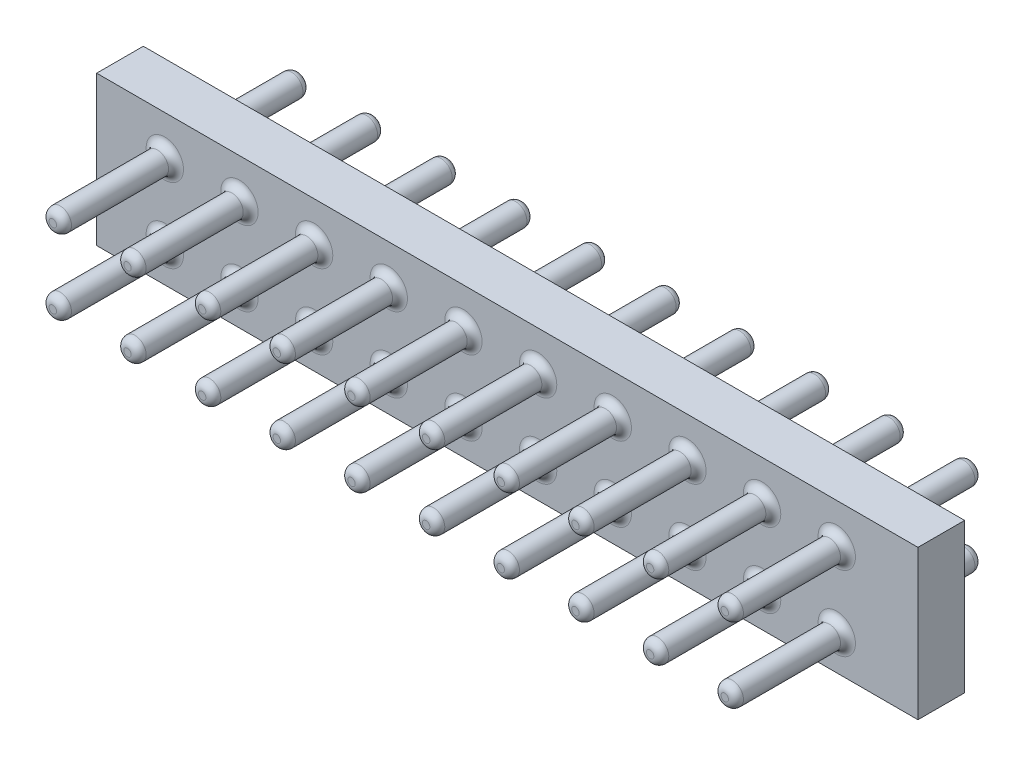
ISO-10303-21;
HEADER;
FILE_DESCRIPTION(('STEP AP214'),'2;1');
FILE_NAME('part.step','',(''),(''),'','','');
FILE_SCHEMA(('AUTOMOTIVE_DESIGN { 1 0 10303 214 1 1 1 1 }'));
ENDSEC;
DATA;
#1=APPLICATION_CONTEXT('core data for automotive mechanical design processes');
#2=APPLICATION_PROTOCOL_DEFINITION('international standard','automotive_design',2000,#1);
#3=PRODUCT_CONTEXT('',#1,'mechanical');
#4=PRODUCT('Part','Part','',(#3));
#5=PRODUCT_RELATED_PRODUCT_CATEGORY('part','',(#4));
#6=PRODUCT_DEFINITION_FORMATION('','',#4);
#7=PRODUCT_DEFINITION_CONTEXT('part definition',#1,'design');
#8=PRODUCT_DEFINITION('design','',#6,#7);
#9=PRODUCT_DEFINITION_SHAPE('','',#8);
#10=(LENGTH_UNIT() NAMED_UNIT(*) SI_UNIT(.MILLI.,.METRE.));
#11=(NAMED_UNIT(*) PLANE_ANGLE_UNIT() SI_UNIT($,.RADIAN.));
#12=(NAMED_UNIT(*) SI_UNIT($,.STERADIAN.) SOLID_ANGLE_UNIT());
#13=UNCERTAINTY_MEASURE_WITH_UNIT(LENGTH_MEASURE(1.E-05),#10,'distance_accuracy_value','');
#14=(GEOMETRIC_REPRESENTATION_CONTEXT(3) GLOBAL_UNCERTAINTY_ASSIGNED_CONTEXT((#13)) GLOBAL_UNIT_ASSIGNED_CONTEXT((#10,
#11,#12)) REPRESENTATION_CONTEXT('',''));
#15=CARTESIAN_POINT('',(0.,0.,0.));
#16=DIRECTION('',(0.,0.,1.));
#17=DIRECTION('',(1.,0.,0.));
#18=AXIS2_PLACEMENT_3D('',#15,#16,#17);
#19=CARTESIAN_POINT('',(-60.3840486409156,-20.8487124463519,1.5875));
#20=DIRECTION('',(0.,0.,1.));
#21=DIRECTION('',(1.,0.,0.));
#22=AXIS2_PLACEMENT_3D('',#19,#20,#21);
#23=PLANE('',#22);
#24=CARTESIAN_POINT('',(-58.0653044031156,-19.6647114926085,1.5875));
#25=DIRECTION('',(0.,0.,1.));
#26=DIRECTION('',(1.,0.,0.));
#27=AXIS2_PLACEMENT_3D('',#24,#25,#26);
#28=CIRCLE('',#27,0.635000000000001);
#29=CARTESIAN_POINT('',(-57.4303044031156,-19.6647114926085,1.5875));
#30=VERTEX_POINT('',#29);
#31=EDGE_CURVE('E253',#30,#30,#28,.F.);
#32=ORIENTED_EDGE('',*,*,#31,.T.);
#33=EDGE_LOOP('',(#32));
#34=FACE_BOUND('',#33,.T.);
#35=CARTESIAN_POINT('',(-55.5253044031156,-17.1247114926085,1.5875));
#36=DIRECTION('',(0.,0.,1.));
#37=DIRECTION('',(1.,0.,0.));
#38=AXIS2_PLACEMENT_3D('',#35,#36,#37);
#39=CIRCLE('',#38,0.635000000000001);
#40=CARTESIAN_POINT('',(-54.8903044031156,-17.1247114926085,1.5875));
#41=VERTEX_POINT('',#40);
#42=EDGE_CURVE('E250',#41,#41,#39,.F.);
#43=ORIENTED_EDGE('',*,*,#42,.T.);
#44=EDGE_LOOP('',(#43));
#45=FACE_BOUND('',#44,.T.);
#46=CARTESIAN_POINT('',(-55.5253044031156,-19.6647114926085,1.5875));
#47=DIRECTION('',(0.,0.,1.));
#48=DIRECTION('',(1.,0.,0.));
#49=AXIS2_PLACEMENT_3D('',#46,#47,#48);
#50=CIRCLE('',#49,0.635000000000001);
#51=CARTESIAN_POINT('',(-54.8903044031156,-19.6647114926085,1.5875));
#52=VERTEX_POINT('',#51);
#53=EDGE_CURVE('E247',#52,#52,#50,.F.);
#54=ORIENTED_EDGE('',*,*,#53,.T.);
#55=EDGE_LOOP('',(#54));
#56=FACE_BOUND('',#55,.T.);
#57=CARTESIAN_POINT('',(-52.9853044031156,-17.1247114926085,1.5875));
#58=DIRECTION('',(0.,0.,1.));
#59=DIRECTION('',(1.,0.,0.));
#60=AXIS2_PLACEMENT_3D('',#57,#58,#59);
#61=CIRCLE('',#60,0.635000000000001);
#62=CARTESIAN_POINT('',(-52.3503044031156,-17.1247114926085,1.5875));
#63=VERTEX_POINT('',#62);
#64=EDGE_CURVE('E244',#63,#63,#61,.F.);
#65=ORIENTED_EDGE('',*,*,#64,.T.);
#66=EDGE_LOOP('',(#65));
#67=FACE_BOUND('',#66,.T.);
#68=CARTESIAN_POINT('',(-52.9853044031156,-19.6647114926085,1.5875));
#69=DIRECTION('',(0.,0.,1.));
#70=DIRECTION('',(1.,0.,0.));
#71=AXIS2_PLACEMENT_3D('',#68,#69,#70);
#72=CIRCLE('',#71,0.635000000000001);
#73=CARTESIAN_POINT('',(-52.3503044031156,-19.6647114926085,1.5875));
#74=VERTEX_POINT('',#73);
#75=EDGE_CURVE('E241',#74,#74,#72,.F.);
#76=ORIENTED_EDGE('',*,*,#75,.T.);
#77=EDGE_LOOP('',(#76));
#78=FACE_BOUND('',#77,.T.);
#79=CARTESIAN_POINT('',(-50.4453044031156,-17.1247114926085,1.5875));
#80=DIRECTION('',(0.,0.,1.));
#81=DIRECTION('',(1.,0.,0.));
#82=AXIS2_PLACEMENT_3D('',#79,#80,#81);
#83=CIRCLE('',#82,0.635000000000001);
#84=CARTESIAN_POINT('',(-49.8103044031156,-17.1247114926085,1.5875));
#85=VERTEX_POINT('',#84);
#86=EDGE_CURVE('E238',#85,#85,#83,.F.);
#87=ORIENTED_EDGE('',*,*,#86,.T.);
#88=EDGE_LOOP('',(#87));
#89=FACE_BOUND('',#88,.T.);
#90=CARTESIAN_POINT('',(-50.4453044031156,-19.6647114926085,1.5875));
#91=DIRECTION('',(0.,0.,1.));
#92=DIRECTION('',(1.,0.,0.));
#93=AXIS2_PLACEMENT_3D('',#90,#91,#92);
#94=CIRCLE('',#93,0.635000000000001);
#95=CARTESIAN_POINT('',(-49.8103044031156,-19.6647114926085,1.5875));
#96=VERTEX_POINT('',#95);
#97=EDGE_CURVE('E235',#96,#96,#94,.F.);
#98=ORIENTED_EDGE('',*,*,#97,.T.);
#99=EDGE_LOOP('',(#98));
#100=FACE_BOUND('',#99,.T.);
#101=CARTESIAN_POINT('',(-47.9053044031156,-17.1247114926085,1.5875));
#102=DIRECTION('',(0.,0.,1.));
#103=DIRECTION('',(1.,0.,0.));
#104=AXIS2_PLACEMENT_3D('',#101,#102,#103);
#105=CIRCLE('',#104,0.635000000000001);
#106=CARTESIAN_POINT('',(-47.2703044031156,-17.1247114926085,1.5875));
#107=VERTEX_POINT('',#106);
#108=EDGE_CURVE('E232',#107,#107,#105,.F.);
#109=ORIENTED_EDGE('',*,*,#108,.T.);
#110=EDGE_LOOP('',(#109));
#111=FACE_BOUND('',#110,.T.);
#112=CARTESIAN_POINT('',(-47.9053044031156,-19.6647114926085,1.5875));
#113=DIRECTION('',(0.,0.,1.));
#114=DIRECTION('',(1.,0.,0.));
#115=AXIS2_PLACEMENT_3D('',#112,#113,#114);
#116=CIRCLE('',#115,0.635000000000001);
#117=CARTESIAN_POINT('',(-47.2703044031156,-19.6647114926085,1.5875));
#118=VERTEX_POINT('',#117);
#119=EDGE_CURVE('E229',#118,#118,#116,.F.);
#120=ORIENTED_EDGE('',*,*,#119,.T.);
#121=EDGE_LOOP('',(#120));
#122=FACE_BOUND('',#121,.T.);
#123=CARTESIAN_POINT('',(-45.3653044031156,-17.1247114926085,1.5875));
#124=DIRECTION('',(0.,0.,1.));
#125=DIRECTION('',(1.,0.,0.));
#126=AXIS2_PLACEMENT_3D('',#123,#124,#125);
#127=CIRCLE('',#126,0.635000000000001);
#128=CARTESIAN_POINT('',(-44.7303044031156,-17.1247114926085,1.5875));
#129=VERTEX_POINT('',#128);
#130=EDGE_CURVE('E226',#129,#129,#127,.F.);
#131=ORIENTED_EDGE('',*,*,#130,.T.);
#132=EDGE_LOOP('',(#131));
#133=FACE_BOUND('',#132,.T.);
#134=CARTESIAN_POINT('',(-45.3653044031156,-19.6647114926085,1.5875));
#135=DIRECTION('',(0.,0.,1.));
#136=DIRECTION('',(1.,0.,0.));
#137=AXIS2_PLACEMENT_3D('',#134,#135,#136);
#138=CIRCLE('',#137,0.635000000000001);
#139=CARTESIAN_POINT('',(-44.7303044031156,-19.6647114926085,1.5875));
#140=VERTEX_POINT('',#139);
#141=EDGE_CURVE('E223',#140,#140,#138,.F.);
#142=ORIENTED_EDGE('',*,*,#141,.T.);
#143=EDGE_LOOP('',(#142));
#144=FACE_BOUND('',#143,.T.);
#145=CARTESIAN_POINT('',(-42.8253044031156,-17.1247114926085,1.5875));
#146=DIRECTION('',(0.,0.,1.));
#147=DIRECTION('',(1.,0.,0.));
#148=AXIS2_PLACEMENT_3D('',#145,#146,#147);
#149=CIRCLE('',#148,0.635000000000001);
#150=CARTESIAN_POINT('',(-42.1903044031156,-17.1247114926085,1.5875));
#151=VERTEX_POINT('',#150);
#152=EDGE_CURVE('E220',#151,#151,#149,.F.);
#153=ORIENTED_EDGE('',*,*,#152,.T.);
#154=EDGE_LOOP('',(#153));
#155=FACE_BOUND('',#154,.T.);
#156=CARTESIAN_POINT('',(-42.8253044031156,-19.6647114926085,1.5875));
#157=DIRECTION('',(0.,0.,1.));
#158=DIRECTION('',(1.,0.,0.));
#159=AXIS2_PLACEMENT_3D('',#156,#157,#158);
#160=CIRCLE('',#159,0.635000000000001);
#161=CARTESIAN_POINT('',(-42.1903044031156,-19.6647114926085,1.5875));
#162=VERTEX_POINT('',#161);
#163=EDGE_CURVE('E217',#162,#162,#160,.F.);
#164=ORIENTED_EDGE('',*,*,#163,.T.);
#165=EDGE_LOOP('',(#164));
#166=FACE_BOUND('',#165,.T.);
#167=CARTESIAN_POINT('',(-40.2853044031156,-17.1247114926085,1.5875));
#168=DIRECTION('',(0.,0.,1.));
#169=DIRECTION('',(1.,0.,0.));
#170=AXIS2_PLACEMENT_3D('',#167,#168,#169);
#171=CIRCLE('',#170,0.635000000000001);
#172=CARTESIAN_POINT('',(-39.6503044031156,-17.1247114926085,1.5875));
#173=VERTEX_POINT('',#172);
#174=EDGE_CURVE('E214',#173,#173,#171,.F.);
#175=ORIENTED_EDGE('',*,*,#174,.T.);
#176=EDGE_LOOP('',(#175));
#177=FACE_BOUND('',#176,.T.);
#178=CARTESIAN_POINT('',(-40.2853044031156,-19.6647114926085,1.5875));
#179=DIRECTION('',(0.,0.,1.));
#180=DIRECTION('',(1.,0.,0.));
#181=AXIS2_PLACEMENT_3D('',#178,#179,#180);
#182=CIRCLE('',#181,0.635000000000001);
#183=CARTESIAN_POINT('',(-39.6503044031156,-19.6647114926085,1.5875));
#184=VERTEX_POINT('',#183);
#185=EDGE_CURVE('E211',#184,#184,#182,.F.);
#186=ORIENTED_EDGE('',*,*,#185,.T.);
#187=EDGE_LOOP('',(#186));
#188=FACE_BOUND('',#187,.T.);
#189=CARTESIAN_POINT('',(-37.7453044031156,-17.1247114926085,1.5875));
#190=DIRECTION('',(0.,0.,1.));
#191=DIRECTION('',(1.,0.,0.));
#192=AXIS2_PLACEMENT_3D('',#189,#190,#191);
#193=CIRCLE('',#192,0.635000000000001);
#194=CARTESIAN_POINT('',(-37.1103044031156,-17.1247114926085,1.5875));
#195=VERTEX_POINT('',#194);
#196=EDGE_CURVE('E208',#195,#195,#193,.F.);
#197=ORIENTED_EDGE('',*,*,#196,.T.);
#198=EDGE_LOOP('',(#197));
#199=FACE_BOUND('',#198,.T.);
#200=CARTESIAN_POINT('',(-37.7453044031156,-19.6647114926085,1.5875));
#201=DIRECTION('',(0.,0.,1.));
#202=DIRECTION('',(1.,0.,0.));
#203=AXIS2_PLACEMENT_3D('',#200,#201,#202);
#204=CIRCLE('',#203,0.635000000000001);
#205=CARTESIAN_POINT('',(-37.1103044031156,-19.6647114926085,1.5875));
#206=VERTEX_POINT('',#205);
#207=EDGE_CURVE('E205',#206,#206,#204,.F.);
#208=ORIENTED_EDGE('',*,*,#207,.T.);
#209=EDGE_LOOP('',(#208));
#210=FACE_BOUND('',#209,.T.);
#211=CARTESIAN_POINT('',(-35.2053044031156,-17.1247114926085,1.5875));
#212=DIRECTION('',(0.,0.,1.));
#213=DIRECTION('',(1.,0.,0.));
#214=AXIS2_PLACEMENT_3D('',#211,#212,#213);
#215=CIRCLE('',#214,0.635000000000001);
#216=CARTESIAN_POINT('',(-34.5703044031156,-17.1247114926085,1.5875));
#217=VERTEX_POINT('',#216);
#218=EDGE_CURVE('E202',#217,#217,#215,.F.);
#219=ORIENTED_EDGE('',*,*,#218,.T.);
#220=EDGE_LOOP('',(#219));
#221=FACE_BOUND('',#220,.T.);
#222=CARTESIAN_POINT('',(-35.2053044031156,-19.6647114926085,1.5875));
#223=DIRECTION('',(0.,0.,1.));
#224=DIRECTION('',(1.,0.,0.));
#225=AXIS2_PLACEMENT_3D('',#222,#223,#224);
#226=CIRCLE('',#225,0.635000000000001);
#227=CARTESIAN_POINT('',(-34.5703044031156,-19.6647114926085,1.5875));
#228=VERTEX_POINT('',#227);
#229=EDGE_CURVE('E199',#228,#228,#226,.F.);
#230=ORIENTED_EDGE('',*,*,#229,.T.);
#231=EDGE_LOOP('',(#230));
#232=FACE_BOUND('',#231,.T.);
#233=DIRECTION('',(0.,-1.,0.));
#234=VECTOR('',#233,1.);
#235=CARTESIAN_POINT('',(-60.3840486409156,-15.7687124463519,1.5875));
#236=LINE('',#235,#234);
#237=CARTESIAN_POINT('',(-60.3840486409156,-15.7687124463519,1.5875));
#238=VERTEX_POINT('',#237);
#239=CARTESIAN_POINT('',(-60.3840486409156,-20.8487124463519,1.5875));
#240=VERTEX_POINT('',#239);
#241=EDGE_CURVE('E100',#238,#240,#236,.T.);
#242=ORIENTED_EDGE('',*,*,#241,.T.);
#243=DIRECTION('',(1.,0.,0.));
#244=VECTOR('',#243,1.);
#245=CARTESIAN_POINT('',(-60.3840486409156,-20.8487124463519,1.5875));
#246=LINE('',#245,#244);
#247=CARTESIAN_POINT('',(-32.4440486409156,-20.8487124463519,1.5875));
#248=VERTEX_POINT('',#247);
#249=EDGE_CURVE('E87',#240,#248,#246,.T.);
#250=ORIENTED_EDGE('',*,*,#249,.T.);
#251=DIRECTION('',(0.,1.,0.));
#252=VECTOR('',#251,1.);
#253=CARTESIAN_POINT('',(-32.4440486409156,-15.7687124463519,1.5875));
#254=LINE('',#253,#252);
#255=CARTESIAN_POINT('',(-32.4440486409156,-15.7687124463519,1.5875));
#256=VERTEX_POINT('',#255);
#257=EDGE_CURVE('E51',#248,#256,#254,.T.);
#258=ORIENTED_EDGE('',*,*,#257,.T.);
#259=DIRECTION('',(-1.,0.,0.));
#260=VECTOR('',#259,1.);
#261=CARTESIAN_POINT('',(-60.3840486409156,-15.7687124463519,1.5875));
#262=LINE('',#261,#260);
#263=EDGE_CURVE('E46',#256,#238,#262,.T.);
#264=ORIENTED_EDGE('',*,*,#263,.T.);
#265=EDGE_LOOP('',(#242,#250,#258,#264));
#266=FACE_BOUND('',#265,.T.);
#267=CARTESIAN_POINT('',(-58.0653044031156,-17.1247114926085,1.5875));
#268=DIRECTION('',(0.,0.,1.));
#269=DIRECTION('',(1.,0.,0.));
#270=AXIS2_PLACEMENT_3D('',#267,#268,#269);
#271=CIRCLE('',#270,0.635000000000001);
#272=CARTESIAN_POINT('',(-57.4303044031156,-17.1247114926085,1.5875));
#273=VERTEX_POINT('',#272);
#274=EDGE_CURVE('E121',#273,#273,#271,.F.);
#275=ORIENTED_EDGE('',*,*,#274,.T.);
#276=EDGE_LOOP('',(#275));
#277=FACE_BOUND('',#276,.T.);
#278=ADVANCED_FACE('F31',(#34,#45,#56,#67,#78,#89,#100,#111,#122,#133,#144,#155,#166,#177,#188,
#199,#210,#221,#232,#266,#277),#23,.T.);
#279=CARTESIAN_POINT('',(-60.3840486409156,-20.8487124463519,0.));
#280=DIRECTION('',(0.,0.,1.));
#281=DIRECTION('',(1.,0.,0.));
#282=AXIS2_PLACEMENT_3D('',#279,#280,#281);
#283=PLANE('',#282);
#284=CARTESIAN_POINT('',(-58.0653044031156,-19.6647114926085,0.));
#285=DIRECTION('',(0.,0.,1.));
#286=DIRECTION('',(1.,0.,0.));
#287=AXIS2_PLACEMENT_3D('',#284,#285,#286);
#288=CIRCLE('',#287,0.635000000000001);
#289=CARTESIAN_POINT('',(-57.4303044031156,-19.6647114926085,0.));
#290=VERTEX_POINT('',#289);
#291=EDGE_CURVE('E193',#290,#290,#288,.T.);
#292=ORIENTED_EDGE('',*,*,#291,.T.);
#293=EDGE_LOOP('',(#292));
#294=FACE_BOUND('',#293,.T.);
#295=CARTESIAN_POINT('',(-55.5253044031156,-17.1247114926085,0.));
#296=DIRECTION('',(0.,0.,1.));
#297=DIRECTION('',(1.,0.,0.));
#298=AXIS2_PLACEMENT_3D('',#295,#296,#297);
#299=CIRCLE('',#298,0.635000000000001);
#300=CARTESIAN_POINT('',(-54.8903044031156,-17.1247114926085,0.));
#301=VERTEX_POINT('',#300);
#302=EDGE_CURVE('E190',#301,#301,#299,.T.);
#303=ORIENTED_EDGE('',*,*,#302,.T.);
#304=EDGE_LOOP('',(#303));
#305=FACE_BOUND('',#304,.T.);
#306=CARTESIAN_POINT('',(-55.5253044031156,-19.6647114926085,0.));
#307=DIRECTION('',(0.,0.,1.));
#308=DIRECTION('',(1.,0.,0.));
#309=AXIS2_PLACEMENT_3D('',#306,#307,#308);
#310=CIRCLE('',#309,0.635000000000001);
#311=CARTESIAN_POINT('',(-54.8903044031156,-19.6647114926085,0.));
#312=VERTEX_POINT('',#311);
#313=EDGE_CURVE('E187',#312,#312,#310,.T.);
#314=ORIENTED_EDGE('',*,*,#313,.T.);
#315=EDGE_LOOP('',(#314));
#316=FACE_BOUND('',#315,.T.);
#317=CARTESIAN_POINT('',(-52.9853044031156,-17.1247114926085,0.));
#318=DIRECTION('',(0.,0.,1.));
#319=DIRECTION('',(1.,0.,0.));
#320=AXIS2_PLACEMENT_3D('',#317,#318,#319);
#321=CIRCLE('',#320,0.635000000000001);
#322=CARTESIAN_POINT('',(-52.3503044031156,-17.1247114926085,0.));
#323=VERTEX_POINT('',#322);
#324=EDGE_CURVE('E184',#323,#323,#321,.T.);
#325=ORIENTED_EDGE('',*,*,#324,.T.);
#326=EDGE_LOOP('',(#325));
#327=FACE_BOUND('',#326,.T.);
#328=CARTESIAN_POINT('',(-52.9853044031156,-19.6647114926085,0.));
#329=DIRECTION('',(0.,0.,1.));
#330=DIRECTION('',(1.,0.,0.));
#331=AXIS2_PLACEMENT_3D('',#328,#329,#330);
#332=CIRCLE('',#331,0.635000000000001);
#333=CARTESIAN_POINT('',(-52.3503044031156,-19.6647114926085,0.));
#334=VERTEX_POINT('',#333);
#335=EDGE_CURVE('E181',#334,#334,#332,.T.);
#336=ORIENTED_EDGE('',*,*,#335,.T.);
#337=EDGE_LOOP('',(#336));
#338=FACE_BOUND('',#337,.T.);
#339=CARTESIAN_POINT('',(-50.4453044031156,-17.1247114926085,0.));
#340=DIRECTION('',(0.,0.,1.));
#341=DIRECTION('',(1.,0.,0.));
#342=AXIS2_PLACEMENT_3D('',#339,#340,#341);
#343=CIRCLE('',#342,0.635000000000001);
#344=CARTESIAN_POINT('',(-49.8103044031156,-17.1247114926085,0.));
#345=VERTEX_POINT('',#344);
#346=EDGE_CURVE('E178',#345,#345,#343,.T.);
#347=ORIENTED_EDGE('',*,*,#346,.T.);
#348=EDGE_LOOP('',(#347));
#349=FACE_BOUND('',#348,.T.);
#350=CARTESIAN_POINT('',(-50.4453044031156,-19.6647114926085,0.));
#351=DIRECTION('',(0.,0.,1.));
#352=DIRECTION('',(1.,0.,0.));
#353=AXIS2_PLACEMENT_3D('',#350,#351,#352);
#354=CIRCLE('',#353,0.635000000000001);
#355=CARTESIAN_POINT('',(-49.8103044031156,-19.6647114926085,0.));
#356=VERTEX_POINT('',#355);
#357=EDGE_CURVE('E175',#356,#356,#354,.T.);
#358=ORIENTED_EDGE('',*,*,#357,.T.);
#359=EDGE_LOOP('',(#358));
#360=FACE_BOUND('',#359,.T.);
#361=CARTESIAN_POINT('',(-47.9053044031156,-17.1247114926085,0.));
#362=DIRECTION('',(0.,0.,1.));
#363=DIRECTION('',(1.,0.,0.));
#364=AXIS2_PLACEMENT_3D('',#361,#362,#363);
#365=CIRCLE('',#364,0.635000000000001);
#366=CARTESIAN_POINT('',(-47.2703044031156,-17.1247114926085,0.));
#367=VERTEX_POINT('',#366);
#368=EDGE_CURVE('E172',#367,#367,#365,.T.);
#369=ORIENTED_EDGE('',*,*,#368,.T.);
#370=EDGE_LOOP('',(#369));
#371=FACE_BOUND('',#370,.T.);
#372=CARTESIAN_POINT('',(-47.9053044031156,-19.6647114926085,0.));
#373=DIRECTION('',(0.,0.,1.));
#374=DIRECTION('',(1.,0.,0.));
#375=AXIS2_PLACEMENT_3D('',#372,#373,#374);
#376=CIRCLE('',#375,0.635000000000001);
#377=CARTESIAN_POINT('',(-47.2703044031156,-19.6647114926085,0.));
#378=VERTEX_POINT('',#377);
#379=EDGE_CURVE('E169',#378,#378,#376,.T.);
#380=ORIENTED_EDGE('',*,*,#379,.T.);
#381=EDGE_LOOP('',(#380));
#382=FACE_BOUND('',#381,.T.);
#383=CARTESIAN_POINT('',(-45.3653044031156,-17.1247114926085,0.));
#384=DIRECTION('',(0.,0.,1.));
#385=DIRECTION('',(1.,0.,0.));
#386=AXIS2_PLACEMENT_3D('',#383,#384,#385);
#387=CIRCLE('',#386,0.635000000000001);
#388=CARTESIAN_POINT('',(-44.7303044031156,-17.1247114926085,0.));
#389=VERTEX_POINT('',#388);
#390=EDGE_CURVE('E166',#389,#389,#387,.T.);
#391=ORIENTED_EDGE('',*,*,#390,.T.);
#392=EDGE_LOOP('',(#391));
#393=FACE_BOUND('',#392,.T.);
#394=CARTESIAN_POINT('',(-45.3653044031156,-19.6647114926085,0.));
#395=DIRECTION('',(0.,0.,1.));
#396=DIRECTION('',(1.,0.,0.));
#397=AXIS2_PLACEMENT_3D('',#394,#395,#396);
#398=CIRCLE('',#397,0.635000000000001);
#399=CARTESIAN_POINT('',(-44.7303044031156,-19.6647114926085,0.));
#400=VERTEX_POINT('',#399);
#401=EDGE_CURVE('E163',#400,#400,#398,.T.);
#402=ORIENTED_EDGE('',*,*,#401,.T.);
#403=EDGE_LOOP('',(#402));
#404=FACE_BOUND('',#403,.T.);
#405=CARTESIAN_POINT('',(-42.8253044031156,-17.1247114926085,0.));
#406=DIRECTION('',(0.,0.,1.));
#407=DIRECTION('',(1.,0.,0.));
#408=AXIS2_PLACEMENT_3D('',#405,#406,#407);
#409=CIRCLE('',#408,0.635000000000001);
#410=CARTESIAN_POINT('',(-42.1903044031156,-17.1247114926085,0.));
#411=VERTEX_POINT('',#410);
#412=EDGE_CURVE('E160',#411,#411,#409,.T.);
#413=ORIENTED_EDGE('',*,*,#412,.T.);
#414=EDGE_LOOP('',(#413));
#415=FACE_BOUND('',#414,.T.);
#416=CARTESIAN_POINT('',(-42.8253044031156,-19.6647114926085,0.));
#417=DIRECTION('',(0.,0.,1.));
#418=DIRECTION('',(1.,0.,0.));
#419=AXIS2_PLACEMENT_3D('',#416,#417,#418);
#420=CIRCLE('',#419,0.635000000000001);
#421=CARTESIAN_POINT('',(-42.1903044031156,-19.6647114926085,0.));
#422=VERTEX_POINT('',#421);
#423=EDGE_CURVE('E157',#422,#422,#420,.T.);
#424=ORIENTED_EDGE('',*,*,#423,.T.);
#425=EDGE_LOOP('',(#424));
#426=FACE_BOUND('',#425,.T.);
#427=CARTESIAN_POINT('',(-40.2853044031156,-17.1247114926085,0.));
#428=DIRECTION('',(0.,0.,1.));
#429=DIRECTION('',(1.,0.,0.));
#430=AXIS2_PLACEMENT_3D('',#427,#428,#429);
#431=CIRCLE('',#430,0.635000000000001);
#432=CARTESIAN_POINT('',(-39.6503044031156,-17.1247114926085,0.));
#433=VERTEX_POINT('',#432);
#434=EDGE_CURVE('E154',#433,#433,#431,.T.);
#435=ORIENTED_EDGE('',*,*,#434,.T.);
#436=EDGE_LOOP('',(#435));
#437=FACE_BOUND('',#436,.T.);
#438=CARTESIAN_POINT('',(-40.2853044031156,-19.6647114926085,0.));
#439=DIRECTION('',(0.,0.,1.));
#440=DIRECTION('',(1.,0.,0.));
#441=AXIS2_PLACEMENT_3D('',#438,#439,#440);
#442=CIRCLE('',#441,0.635000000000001);
#443=CARTESIAN_POINT('',(-39.6503044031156,-19.6647114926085,0.));
#444=VERTEX_POINT('',#443);
#445=EDGE_CURVE('E151',#444,#444,#442,.T.);
#446=ORIENTED_EDGE('',*,*,#445,.T.);
#447=EDGE_LOOP('',(#446));
#448=FACE_BOUND('',#447,.T.);
#449=CARTESIAN_POINT('',(-37.7453044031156,-17.1247114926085,0.));
#450=DIRECTION('',(0.,0.,1.));
#451=DIRECTION('',(1.,0.,0.));
#452=AXIS2_PLACEMENT_3D('',#449,#450,#451);
#453=CIRCLE('',#452,0.635000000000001);
#454=CARTESIAN_POINT('',(-37.1103044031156,-17.1247114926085,0.));
#455=VERTEX_POINT('',#454);
#456=EDGE_CURVE('E148',#455,#455,#453,.T.);
#457=ORIENTED_EDGE('',*,*,#456,.T.);
#458=EDGE_LOOP('',(#457));
#459=FACE_BOUND('',#458,.T.);
#460=CARTESIAN_POINT('',(-37.7453044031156,-19.6647114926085,0.));
#461=DIRECTION('',(0.,0.,1.));
#462=DIRECTION('',(1.,0.,0.));
#463=AXIS2_PLACEMENT_3D('',#460,#461,#462);
#464=CIRCLE('',#463,0.635000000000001);
#465=CARTESIAN_POINT('',(-37.1103044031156,-19.6647114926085,0.));
#466=VERTEX_POINT('',#465);
#467=EDGE_CURVE('E145',#466,#466,#464,.T.);
#468=ORIENTED_EDGE('',*,*,#467,.T.);
#469=EDGE_LOOP('',(#468));
#470=FACE_BOUND('',#469,.T.);
#471=CARTESIAN_POINT('',(-35.2053044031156,-17.1247114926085,0.));
#472=DIRECTION('',(0.,0.,1.));
#473=DIRECTION('',(1.,0.,0.));
#474=AXIS2_PLACEMENT_3D('',#471,#472,#473);
#475=CIRCLE('',#474,0.635000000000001);
#476=CARTESIAN_POINT('',(-34.5703044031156,-17.1247114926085,0.));
#477=VERTEX_POINT('',#476);
#478=EDGE_CURVE('E142',#477,#477,#475,.T.);
#479=ORIENTED_EDGE('',*,*,#478,.T.);
#480=EDGE_LOOP('',(#479));
#481=FACE_BOUND('',#480,.T.);
#482=CARTESIAN_POINT('',(-35.2053044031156,-19.6647114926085,0.));
#483=DIRECTION('',(0.,0.,1.));
#484=DIRECTION('',(1.,0.,0.));
#485=AXIS2_PLACEMENT_3D('',#482,#483,#484);
#486=CIRCLE('',#485,0.635000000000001);
#487=CARTESIAN_POINT('',(-34.5703044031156,-19.6647114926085,0.));
#488=VERTEX_POINT('',#487);
#489=EDGE_CURVE('E139',#488,#488,#486,.T.);
#490=ORIENTED_EDGE('',*,*,#489,.T.);
#491=EDGE_LOOP('',(#490));
#492=FACE_BOUND('',#491,.T.);
#493=DIRECTION('',(0.,-1.,0.));
#494=VECTOR('',#493,1.);
#495=CARTESIAN_POINT('',(-60.3840486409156,-15.7687124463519,0.));
#496=LINE('',#495,#494);
#497=CARTESIAN_POINT('',(-60.3840486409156,-15.7687124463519,0.));
#498=VERTEX_POINT('',#497);
#499=CARTESIAN_POINT('',(-60.3840486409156,-20.8487124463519,0.));
#500=VERTEX_POINT('',#499);
#501=EDGE_CURVE('E78',#498,#500,#496,.T.);
#502=ORIENTED_EDGE('',*,*,#501,.F.);
#503=DIRECTION('',(-1.,0.,0.));
#504=VECTOR('',#503,1.);
#505=CARTESIAN_POINT('',(-60.3840486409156,-15.7687124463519,0.));
#506=LINE('',#505,#504);
#507=CARTESIAN_POINT('',(-32.4440486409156,-15.7687124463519,0.));
#508=VERTEX_POINT('',#507);
#509=EDGE_CURVE('E98',#508,#498,#506,.T.);
#510=ORIENTED_EDGE('',*,*,#509,.F.);
#511=DIRECTION('',(0.,1.,0.));
#512=VECTOR('',#511,1.);
#513=CARTESIAN_POINT('',(-32.4440486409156,-15.7687124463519,0.));
#514=LINE('',#513,#512);
#515=CARTESIAN_POINT('',(-32.4440486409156,-20.8487124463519,0.));
#516=VERTEX_POINT('',#515);
#517=EDGE_CURVE('E79',#516,#508,#514,.T.);
#518=ORIENTED_EDGE('',*,*,#517,.F.);
#519=DIRECTION('',(1.,0.,0.));
#520=VECTOR('',#519,1.);
#521=CARTESIAN_POINT('',(-60.3840486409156,-20.8487124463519,0.));
#522=LINE('',#521,#520);
#523=EDGE_CURVE('E72',#500,#516,#522,.T.);
#524=ORIENTED_EDGE('',*,*,#523,.F.);
#525=EDGE_LOOP('',(#502,#510,#518,#524));
#526=FACE_BOUND('',#525,.T.);
#527=CARTESIAN_POINT('',(-58.0653044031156,-17.1247114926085,0.));
#528=DIRECTION('',(0.,0.,1.));
#529=DIRECTION('',(1.,0.,0.));
#530=AXIS2_PLACEMENT_3D('',#527,#528,#529);
#531=CIRCLE('',#530,0.635000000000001);
#532=CARTESIAN_POINT('',(-57.4303044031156,-17.1247114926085,0.));
#533=VERTEX_POINT('',#532);
#534=EDGE_CURVE('E115',#533,#533,#531,.T.);
#535=ORIENTED_EDGE('',*,*,#534,.T.);
#536=EDGE_LOOP('',(#535));
#537=FACE_BOUND('',#536,.T.);
#538=ADVANCED_FACE('F74',(#294,#305,#316,#327,#338,#349,#360,#371,#382,#393,#404,#415,#426,#437,
#448,#459,#470,#481,#492,#526,#537),#283,.F.);
#539=CARTESIAN_POINT('',(-60.3840486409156,-15.7687124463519,1.5875));
#540=DIRECTION('',(1.,0.,0.));
#541=DIRECTION('',(0.,1.,0.));
#542=AXIS2_PLACEMENT_3D('',#539,#540,#541);
#543=PLANE('',#542);
#544=ORIENTED_EDGE('',*,*,#501,.T.);
#545=DIRECTION('',(0.,0.,-1.));
#546=VECTOR('',#545,1.);
#547=CARTESIAN_POINT('',(-60.3840486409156,-20.8487124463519,1.5875));
#548=LINE('',#547,#546);
#549=EDGE_CURVE('E85',#240,#500,#548,.T.);
#550=ORIENTED_EDGE('',*,*,#549,.F.);
#551=ORIENTED_EDGE('',*,*,#241,.F.);
#552=DIRECTION('',(0.,0.,-1.));
#553=VECTOR('',#552,1.);
#554=CARTESIAN_POINT('',(-60.3840486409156,-15.7687124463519,1.5875));
#555=LINE('',#554,#553);
#556=EDGE_CURVE('E94',#238,#498,#555,.T.);
#557=ORIENTED_EDGE('',*,*,#556,.T.);
#558=EDGE_LOOP('',(#544,#550,#551,#557));
#559=FACE_BOUND('',#558,.T.);
#560=ADVANCED_FACE('F33',(#559),#543,.F.);
#561=CARTESIAN_POINT('',(-60.3840486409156,-20.8487124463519,1.5875));
#562=DIRECTION('',(0.,1.,0.));
#563=DIRECTION('',(0.,0.,1.));
#564=AXIS2_PLACEMENT_3D('',#561,#562,#563);
#565=PLANE('',#564);
#566=ORIENTED_EDGE('',*,*,#523,.T.);
#567=DIRECTION('',(0.,0.,-1.));
#568=VECTOR('',#567,1.);
#569=CARTESIAN_POINT('',(-32.4440486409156,-20.8487124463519,1.5875));
#570=LINE('',#569,#568);
#571=EDGE_CURVE('E91',#248,#516,#570,.T.);
#572=ORIENTED_EDGE('',*,*,#571,.F.);
#573=ORIENTED_EDGE('',*,*,#249,.F.);
#574=ORIENTED_EDGE('',*,*,#549,.T.);
#575=EDGE_LOOP('',(#566,#572,#573,#574));
#576=FACE_BOUND('',#575,.T.);
#577=ADVANCED_FACE('F86',(#576),#565,.F.);
#578=CARTESIAN_POINT('',(-32.4440486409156,-15.7687124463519,1.5875));
#579=DIRECTION('',(-1.,0.,0.));
#580=DIRECTION('',(0.,0.,1.));
#581=AXIS2_PLACEMENT_3D('',#578,#579,#580);
#582=PLANE('',#581);
#583=ORIENTED_EDGE('',*,*,#517,.T.);
#584=DIRECTION('',(0.,0.,-1.));
#585=VECTOR('',#584,1.);
#586=CARTESIAN_POINT('',(-32.4440486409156,-15.7687124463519,1.5875));
#587=LINE('',#586,#585);
#588=EDGE_CURVE('E106',#256,#508,#587,.T.);
#589=ORIENTED_EDGE('',*,*,#588,.F.);
#590=ORIENTED_EDGE('',*,*,#257,.F.);
#591=ORIENTED_EDGE('',*,*,#571,.T.);
#592=EDGE_LOOP('',(#583,#589,#590,#591));
#593=FACE_BOUND('',#592,.T.);
#594=ADVANCED_FACE('F618',(#593),#582,.F.);
#595=CARTESIAN_POINT('',(-60.3840486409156,-15.7687124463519,1.5875));
#596=DIRECTION('',(0.,-1.,0.));
#597=DIRECTION('',(0.,0.,-1.));
#598=AXIS2_PLACEMENT_3D('',#595,#596,#597);
#599=PLANE('',#598);
#600=ORIENTED_EDGE('',*,*,#509,.T.);
#601=ORIENTED_EDGE('',*,*,#556,.F.);
#602=ORIENTED_EDGE('',*,*,#263,.F.);
#603=ORIENTED_EDGE('',*,*,#588,.T.);
#604=EDGE_LOOP('',(#600,#601,#602,#603));
#605=FACE_BOUND('',#604,.T.);
#606=ADVANCED_FACE('F614',(#605),#599,.F.);
#607=CARTESIAN_POINT('',(-58.0653044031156,-17.1247114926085,-2.9845));
#608=DIRECTION('',(0.,0.,1.));
#609=DIRECTION('',(1.,0.,0.));
#610=AXIS2_PLACEMENT_3D('',#607,#608,#609);
#611=PLANE('',#610);
#612=CARTESIAN_POINT('',(-58.0653044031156,-17.1247114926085,-2.9845));
#613=DIRECTION('',(0.,0.,1.));
#614=DIRECTION('',(1.,0.,0.));
#615=AXIS2_PLACEMENT_3D('',#612,#613,#614);
#616=CIRCLE('',#615,0.127000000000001);
#617=CARTESIAN_POINT('',(-57.9383044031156,-17.1247114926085,-2.9845));
#618=VERTEX_POINT('',#617);
#619=EDGE_CURVE('E118',#618,#618,#616,.F.);
#620=ORIENTED_EDGE('',*,*,#619,.T.);
#621=EDGE_LOOP('',(#620));
#622=FACE_BOUND('',#621,.T.);
#623=ADVANCED_FACE('F617',(#622),#611,.F.);
#624=CARTESIAN_POINT('',(-58.0653044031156,-17.1247114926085,5.3975));
#625=DIRECTION('',(0.,0.,-1.));
#626=DIRECTION('',(-1.,0.,0.));
#627=AXIS2_PLACEMENT_3D('',#624,#625,#626);
#628=CYLINDRICAL_SURFACE('',#627,0.381000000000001);
#629=CARTESIAN_POINT('',(-58.0653044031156,-17.1247114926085,-0.253999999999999));
#630=DIRECTION('',(0.,0.,1.));
#631=DIRECTION('',(1.,0.,0.));
#632=AXIS2_PLACEMENT_3D('',#629,#630,#631);
#633=CIRCLE('',#632,0.381000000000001);
#634=CARTESIAN_POINT('',(-57.6843044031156,-17.1247114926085,-0.253999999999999));
#635=VERTEX_POINT('',#634);
#636=EDGE_CURVE('E112',#635,#635,#633,.F.);
#637=ORIENTED_EDGE('',*,*,#636,.T.);
#638=EDGE_LOOP('',(#637));
#639=FACE_BOUND('',#638,.T.);
#640=CARTESIAN_POINT('',(-58.0653044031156,-17.1247114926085,-2.73050000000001));
#641=DIRECTION('',(0.,0.,1.));
#642=DIRECTION('',(1.,0.,0.));
#643=AXIS2_PLACEMENT_3D('',#640,#641,#642);
#644=CIRCLE('',#643,0.381000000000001);
#645=CARTESIAN_POINT('',(-57.6843044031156,-17.1247114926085,-2.73050000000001));
#646=VERTEX_POINT('',#645);
#647=EDGE_CURVE('E90',#646,#646,#644,.T.);
#648=ORIENTED_EDGE('',*,*,#647,.T.);
#649=EDGE_LOOP('',(#648));
#650=FACE_BOUND('',#649,.T.);
#651=ADVANCED_FACE('F2146',(#639,#650),#628,.T.);
#652=CARTESIAN_POINT('',(-58.0653044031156,-17.1247114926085,1.8415));
#653=DIRECTION('',(0.,0.,1.));
#654=DIRECTION('',(1.,0.,0.));
#655=AXIS2_PLACEMENT_3D('',#652,#653,#654);
#656=CIRCLE('',#655,0.381000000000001);
#657=CARTESIAN_POINT('',(-57.6843044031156,-17.1247114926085,1.8415));
#658=VERTEX_POINT('',#657);
#659=EDGE_CURVE('E127',#658,#658,#656,.T.);
#660=ORIENTED_EDGE('',*,*,#659,.T.);
#661=EDGE_LOOP('',(#660));
#662=FACE_BOUND('',#661,.T.);
#663=CARTESIAN_POINT('',(-58.0653044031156,-17.1247114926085,5.1435));
#664=DIRECTION('',(0.,0.,1.));
#665=DIRECTION('',(1.,0.,0.));
#666=AXIS2_PLACEMENT_3D('',#663,#664,#665);
#667=CIRCLE('',#666,0.381000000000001);
#668=CARTESIAN_POINT('',(-57.6843044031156,-17.1247114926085,5.1435));
#669=VERTEX_POINT('',#668);
#670=EDGE_CURVE('E124',#669,#669,#667,.F.);
#671=ORIENTED_EDGE('',*,*,#670,.T.);
#672=EDGE_LOOP('',(#671));
#673=FACE_BOUND('',#672,.T.);
#674=ADVANCED_FACE('F2149',(#662,#673),#628,.T.);
#675=CARTESIAN_POINT('',(-58.0653044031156,-17.1247114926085,5.3975));
#676=DIRECTION('',(0.,0.,1.));
#677=DIRECTION('',(1.,0.,0.));
#678=AXIS2_PLACEMENT_3D('',#675,#676,#677);
#679=PLANE('',#678);
#680=CARTESIAN_POINT('',(-58.0653044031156,-17.1247114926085,5.3975));
#681=DIRECTION('',(0.,0.,1.));
#682=DIRECTION('',(1.,0.,0.));
#683=AXIS2_PLACEMENT_3D('',#680,#681,#682);
#684=CIRCLE('',#683,0.127000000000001);
#685=CARTESIAN_POINT('',(-57.9383044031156,-17.1247114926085,5.3975));
#686=VERTEX_POINT('',#685);
#687=EDGE_CURVE('E130',#686,#686,#684,.T.);
#688=ORIENTED_EDGE('',*,*,#687,.T.);
#689=EDGE_LOOP('',(#688));
#690=FACE_BOUND('',#689,.T.);
#691=ADVANCED_FACE('F2142',(#690),#679,.T.);
#692=CARTESIAN_POINT('',(-58.0653044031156,-17.1247114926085,-0.254));
#693=DIRECTION('',(0.,0.,1.));
#694=DIRECTION('',(1.,0.,0.));
#695=AXIS2_PLACEMENT_3D('',#692,#693,#694);
#696=TOROIDAL_SURFACE('',#695,0.635000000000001,0.254);
#697=ORIENTED_EDGE('',*,*,#534,.F.);
#698=EDGE_LOOP('',(#697));
#699=FACE_BOUND('',#698,.T.);
#700=ORIENTED_EDGE('',*,*,#636,.F.);
#701=EDGE_LOOP('',(#700));
#702=FACE_BOUND('',#701,.T.);
#703=ADVANCED_FACE('F2138',(#699,#702),#696,.F.);
#704=CARTESIAN_POINT('',(-58.0653044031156,-17.1247114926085,-2.7305));
#705=DIRECTION('',(0.,0.,1.));
#706=DIRECTION('',(1.,0.,0.));
#707=AXIS2_PLACEMENT_3D('',#704,#705,#706);
#708=DEGENERATE_TOROIDAL_SURFACE('',#707,0.127000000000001,0.254,.T.);
#709=ORIENTED_EDGE('',*,*,#619,.F.);
#710=EDGE_LOOP('',(#709));
#711=FACE_BOUND('',#710,.T.);
#712=ORIENTED_EDGE('',*,*,#647,.F.);
#713=EDGE_LOOP('',(#712));
#714=FACE_BOUND('',#713,.T.);
#715=ADVANCED_FACE('F2134',(#711,#714),#708,.T.);
#716=CARTESIAN_POINT('',(-58.0653044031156,-17.1247114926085,1.8415));
#717=DIRECTION('',(0.,0.,1.));
#718=DIRECTION('',(1.,0.,0.));
#719=AXIS2_PLACEMENT_3D('',#716,#717,#718);
#720=TOROIDAL_SURFACE('',#719,0.635000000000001,0.254);
#721=ORIENTED_EDGE('',*,*,#659,.F.);
#722=EDGE_LOOP('',(#721));
#723=FACE_BOUND('',#722,.T.);
#724=ORIENTED_EDGE('',*,*,#274,.F.);
#725=EDGE_LOOP('',(#724));
#726=FACE_BOUND('',#725,.T.);
#727=ADVANCED_FACE('F2130',(#723,#726),#720,.F.);
#728=CARTESIAN_POINT('',(-58.0653044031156,-17.1247114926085,5.1435));
#729=DIRECTION('',(0.,0.,1.));
#730=DIRECTION('',(1.,0.,0.));
#731=AXIS2_PLACEMENT_3D('',#728,#729,#730);
#732=DEGENERATE_TOROIDAL_SURFACE('',#731,0.127000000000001,0.254,.T.);
#733=ORIENTED_EDGE('',*,*,#670,.F.);
#734=EDGE_LOOP('',(#733));
#735=FACE_BOUND('',#734,.T.);
#736=ORIENTED_EDGE('',*,*,#687,.F.);
#737=EDGE_LOOP('',(#736));
#738=FACE_BOUND('',#737,.T.);
#739=ADVANCED_FACE('F647',(#735,#738),#732,.T.);
#740=CARTESIAN_POINT('',(-58.0653044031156,-19.6647114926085,-2.9845));
#741=DIRECTION('',(0.,0.,1.));
#742=DIRECTION('',(1.,0.,0.));
#743=AXIS2_PLACEMENT_3D('',#740,#741,#742);
#744=PLANE('',#743);
#745=CARTESIAN_POINT('',(-58.0653044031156,-19.6647114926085,-2.9845));
#746=DIRECTION('',(0.,0.,1.));
#747=DIRECTION('',(1.,0.,0.));
#748=AXIS2_PLACEMENT_3D('',#745,#746,#747);
#749=CIRCLE('',#748,0.127000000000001);
#750=CARTESIAN_POINT('',(-57.9383044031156,-19.6647114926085,-2.9845));
#751=VERTEX_POINT('',#750);
#752=EDGE_CURVE('E196',#751,#751,#749,.F.);
#753=ORIENTED_EDGE('',*,*,#752,.T.);
#754=EDGE_LOOP('',(#753));
#755=FACE_BOUND('',#754,.T.);
#756=ADVANCED_FACE('F641',(#755),#744,.F.);
#757=CARTESIAN_POINT('',(-58.0653044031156,-19.6647114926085,5.3975));
#758=DIRECTION('',(0.,0.,-1.));
#759=DIRECTION('',(-1.,0.,0.));
#760=AXIS2_PLACEMENT_3D('',#757,#758,#759);
#761=CYLINDRICAL_SURFACE('',#760,0.381000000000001);
#762=CARTESIAN_POINT('',(-58.0653044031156,-19.6647114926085,-0.253999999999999));
#763=DIRECTION('',(0.,0.,1.));
#764=DIRECTION('',(1.,0.,0.));
#765=AXIS2_PLACEMENT_3D('',#762,#763,#764);
#766=CIRCLE('',#765,0.381000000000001);
#767=CARTESIAN_POINT('',(-57.6843044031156,-19.6647114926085,-0.253999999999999));
#768=VERTEX_POINT('',#767);
#769=EDGE_CURVE('E136',#768,#768,#766,.F.);
#770=ORIENTED_EDGE('',*,*,#769,.T.);
#771=EDGE_LOOP('',(#770));
#772=FACE_BOUND('',#771,.T.);
#773=CARTESIAN_POINT('',(-58.0653044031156,-19.6647114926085,-2.73050000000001));
#774=DIRECTION('',(0.,0.,1.));
#775=DIRECTION('',(1.,0.,0.));
#776=AXIS2_PLACEMENT_3D('',#773,#774,#775);
#777=CIRCLE('',#776,0.381000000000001);
#778=CARTESIAN_POINT('',(-57.6843044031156,-19.6647114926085,-2.73050000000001));
#779=VERTEX_POINT('',#778);
#780=EDGE_CURVE('E133',#779,#779,#777,.T.);
#781=ORIENTED_EDGE('',*,*,#780,.T.);
#782=EDGE_LOOP('',(#781));
#783=FACE_BOUND('',#782,.T.);
#784=ADVANCED_FACE('F646',(#772,#783),#761,.T.);
#785=CARTESIAN_POINT('',(-58.0653044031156,-19.6647114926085,1.8415));
#786=DIRECTION('',(0.,0.,1.));
#787=DIRECTION('',(1.,0.,0.));
#788=AXIS2_PLACEMENT_3D('',#785,#786,#787);
#789=CIRCLE('',#788,0.381000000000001);
#790=CARTESIAN_POINT('',(-57.6843044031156,-19.6647114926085,1.8415));
#791=VERTEX_POINT('',#790);
#792=EDGE_CURVE('E259',#791,#791,#789,.T.);
#793=ORIENTED_EDGE('',*,*,#792,.T.);
#794=EDGE_LOOP('',(#793));
#795=FACE_BOUND('',#794,.T.);
#796=CARTESIAN_POINT('',(-58.0653044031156,-19.6647114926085,5.1435));
#797=DIRECTION('',(0.,0.,1.));
#798=DIRECTION('',(1.,0.,0.));
#799=AXIS2_PLACEMENT_3D('',#796,#797,#798);
#800=CIRCLE('',#799,0.381000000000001);
#801=CARTESIAN_POINT('',(-57.6843044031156,-19.6647114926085,5.1435));
#802=VERTEX_POINT('',#801);
#803=EDGE_CURVE('E256',#802,#802,#800,.F.);
#804=ORIENTED_EDGE('',*,*,#803,.T.);
#805=EDGE_LOOP('',(#804));
#806=FACE_BOUND('',#805,.T.);
#807=ADVANCED_FACE('F658',(#795,#806),#761,.T.);
#808=CARTESIAN_POINT('',(-58.0653044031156,-19.6647114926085,5.3975));
#809=DIRECTION('',(0.,0.,1.));
#810=DIRECTION('',(1.,0.,0.));
#811=AXIS2_PLACEMENT_3D('',#808,#809,#810);
#812=PLANE('',#811);
#813=CARTESIAN_POINT('',(-58.0653044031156,-19.6647114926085,5.3975));
#814=DIRECTION('',(0.,0.,1.));
#815=DIRECTION('',(1.,0.,0.));
#816=AXIS2_PLACEMENT_3D('',#813,#814,#815);
#817=CIRCLE('',#816,0.127000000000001);
#818=CARTESIAN_POINT('',(-57.9383044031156,-19.6647114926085,5.3975));
#819=VERTEX_POINT('',#818);
#820=EDGE_CURVE('E262',#819,#819,#817,.T.);
#821=ORIENTED_EDGE('',*,*,#820,.T.);
#822=EDGE_LOOP('',(#821));
#823=FACE_BOUND('',#822,.T.);
#824=ADVANCED_FACE('F668',(#823),#812,.T.);
#825=CARTESIAN_POINT('',(-55.5253044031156,-17.1247114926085,-2.9845));
#826=DIRECTION('',(0.,0.,1.));
#827=DIRECTION('',(1.,0.,0.));
#828=AXIS2_PLACEMENT_3D('',#825,#826,#827);
#829=PLANE('',#828);
#830=CARTESIAN_POINT('',(-55.5253044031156,-17.1247114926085,-2.9845));
#831=DIRECTION('',(0.,0.,1.));
#832=DIRECTION('',(1.,0.,0.));
#833=AXIS2_PLACEMENT_3D('',#830,#831,#832);
#834=CIRCLE('',#833,0.127000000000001);
#835=CARTESIAN_POINT('',(-55.3983044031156,-17.1247114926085,-2.9845));
#836=VERTEX_POINT('',#835);
#837=EDGE_CURVE('E271',#836,#836,#834,.F.);
#838=ORIENTED_EDGE('',*,*,#837,.T.);
#839=EDGE_LOOP('',(#838));
#840=FACE_BOUND('',#839,.T.);
#841=ADVANCED_FACE('F677',(#840),#829,.F.);
#842=CARTESIAN_POINT('',(-55.5253044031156,-17.1247114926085,5.3975));
#843=DIRECTION('',(0.,0.,-1.));
#844=DIRECTION('',(-1.,0.,0.));
#845=AXIS2_PLACEMENT_3D('',#842,#843,#844);
#846=CYLINDRICAL_SURFACE('',#845,0.381000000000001);
#847=CARTESIAN_POINT('',(-55.5253044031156,-17.1247114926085,-0.253999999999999));
#848=DIRECTION('',(0.,0.,1.));
#849=DIRECTION('',(1.,0.,0.));
#850=AXIS2_PLACEMENT_3D('',#847,#848,#849);
#851=CIRCLE('',#850,0.381000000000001);
#852=CARTESIAN_POINT('',(-55.1443044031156,-17.1247114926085,-0.253999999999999));
#853=VERTEX_POINT('',#852);
#854=EDGE_CURVE('E268',#853,#853,#851,.F.);
#855=ORIENTED_EDGE('',*,*,#854,.T.);
#856=EDGE_LOOP('',(#855));
#857=FACE_BOUND('',#856,.T.);
#858=CARTESIAN_POINT('',(-55.5253044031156,-17.1247114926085,-2.73050000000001));
#859=DIRECTION('',(0.,0.,1.));
#860=DIRECTION('',(1.,0.,0.));
#861=AXIS2_PLACEMENT_3D('',#858,#859,#860);
#862=CIRCLE('',#861,0.381000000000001);
#863=CARTESIAN_POINT('',(-55.1443044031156,-17.1247114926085,-2.73050000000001));
#864=VERTEX_POINT('',#863);
#865=EDGE_CURVE('E265',#864,#864,#862,.T.);
#866=ORIENTED_EDGE('',*,*,#865,.T.);
#867=EDGE_LOOP('',(#866));
#868=FACE_BOUND('',#867,.T.);
#869=ADVANCED_FACE('F687',(#857,#868),#846,.T.);
#870=CARTESIAN_POINT('',(-55.5253044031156,-17.1247114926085,1.8415));
#871=DIRECTION('',(0.,0.,1.));
#872=DIRECTION('',(1.,0.,0.));
#873=AXIS2_PLACEMENT_3D('',#870,#871,#872);
#874=CIRCLE('',#873,0.381000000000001);
#875=CARTESIAN_POINT('',(-55.1443044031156,-17.1247114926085,1.8415));
#876=VERTEX_POINT('',#875);
#877=EDGE_CURVE('E277',#876,#876,#874,.T.);
#878=ORIENTED_EDGE('',*,*,#877,.T.);
#879=EDGE_LOOP('',(#878));
#880=FACE_BOUND('',#879,.T.);
#881=CARTESIAN_POINT('',(-55.5253044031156,-17.1247114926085,5.1435));
#882=DIRECTION('',(0.,0.,1.));
#883=DIRECTION('',(1.,0.,0.));
#884=AXIS2_PLACEMENT_3D('',#881,#882,#883);
#885=CIRCLE('',#884,0.381000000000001);
#886=CARTESIAN_POINT('',(-55.1443044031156,-17.1247114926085,5.1435));
#887=VERTEX_POINT('',#886);
#888=EDGE_CURVE('E274',#887,#887,#885,.F.);
#889=ORIENTED_EDGE('',*,*,#888,.T.);
#890=EDGE_LOOP('',(#889));
#891=FACE_BOUND('',#890,.T.);
#892=ADVANCED_FACE('F697',(#880,#891),#846,.T.);
#893=CARTESIAN_POINT('',(-55.5253044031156,-17.1247114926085,5.3975));
#894=DIRECTION('',(0.,0.,1.));
#895=DIRECTION('',(1.,0.,0.));
#896=AXIS2_PLACEMENT_3D('',#893,#894,#895);
#897=PLANE('',#896);
#898=CARTESIAN_POINT('',(-55.5253044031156,-17.1247114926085,5.3975));
#899=DIRECTION('',(0.,0.,1.));
#900=DIRECTION('',(1.,0.,0.));
#901=AXIS2_PLACEMENT_3D('',#898,#899,#900);
#902=CIRCLE('',#901,0.127000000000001);
#903=CARTESIAN_POINT('',(-55.3983044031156,-17.1247114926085,5.3975));
#904=VERTEX_POINT('',#903);
#905=EDGE_CURVE('E11',#904,#904,#902,.T.);
#906=ORIENTED_EDGE('',*,*,#905,.T.);
#907=EDGE_LOOP('',(#906));
#908=FACE_BOUND('',#907,.T.);
#909=ADVANCED_FACE('F707',(#908),#897,.T.);
#910=CARTESIAN_POINT('',(-55.5253044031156,-19.6647114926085,-2.9845));
#911=DIRECTION('',(0.,0.,1.));
#912=DIRECTION('',(1.,0.,0.));
#913=AXIS2_PLACEMENT_3D('',#910,#911,#912);
#914=PLANE('',#913);
#915=CARTESIAN_POINT('',(-55.5253044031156,-19.6647114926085,-2.9845));
#916=DIRECTION('',(0.,0.,1.));
#917=DIRECTION('',(1.,0.,0.));
#918=AXIS2_PLACEMENT_3D('',#915,#916,#917);
#919=CIRCLE('',#918,0.127000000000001);
#920=CARTESIAN_POINT('',(-55.3983044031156,-19.6647114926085,-2.9845));
#921=VERTEX_POINT('',#920);
#922=EDGE_CURVE('E286',#921,#921,#919,.F.);
#923=ORIENTED_EDGE('',*,*,#922,.T.);
#924=EDGE_LOOP('',(#923));
#925=FACE_BOUND('',#924,.T.);
#926=ADVANCED_FACE('F716',(#925),#914,.F.);
#927=CARTESIAN_POINT('',(-55.5253044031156,-19.6647114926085,5.3975));
#928=DIRECTION('',(0.,0.,-1.));
#929=DIRECTION('',(-1.,0.,0.));
#930=AXIS2_PLACEMENT_3D('',#927,#928,#929);
#931=CYLINDRICAL_SURFACE('',#930,0.381000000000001);
#932=CARTESIAN_POINT('',(-55.5253044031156,-19.6647114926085,-0.253999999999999));
#933=DIRECTION('',(0.,0.,1.));
#934=DIRECTION('',(1.,0.,0.));
#935=AXIS2_PLACEMENT_3D('',#932,#933,#934);
#936=CIRCLE('',#935,0.381000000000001);
#937=CARTESIAN_POINT('',(-55.1443044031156,-19.6647114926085,-0.253999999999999));
#938=VERTEX_POINT('',#937);
#939=EDGE_CURVE('E283',#938,#938,#936,.F.);
#940=ORIENTED_EDGE('',*,*,#939,.T.);
#941=EDGE_LOOP('',(#940));
#942=FACE_BOUND('',#941,.T.);
#943=CARTESIAN_POINT('',(-55.5253044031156,-19.6647114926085,-2.73050000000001));
#944=DIRECTION('',(0.,0.,1.));
#945=DIRECTION('',(1.,0.,0.));
#946=AXIS2_PLACEMENT_3D('',#943,#944,#945);
#947=CIRCLE('',#946,0.381000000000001);
#948=CARTESIAN_POINT('',(-55.1443044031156,-19.6647114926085,-2.73050000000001));
#949=VERTEX_POINT('',#948);
#950=EDGE_CURVE('E280',#949,#949,#947,.T.);
#951=ORIENTED_EDGE('',*,*,#950,.T.);
#952=EDGE_LOOP('',(#951));
#953=FACE_BOUND('',#952,.T.);
#954=ADVANCED_FACE('F726',(#942,#953),#931,.T.);
#955=CARTESIAN_POINT('',(-55.5253044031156,-19.6647114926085,1.8415));
#956=DIRECTION('',(0.,0.,1.));
#957=DIRECTION('',(1.,0.,0.));
#958=AXIS2_PLACEMENT_3D('',#955,#956,#957);
#959=CIRCLE('',#958,0.381000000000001);
#960=CARTESIAN_POINT('',(-55.1443044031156,-19.6647114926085,1.8415));
#961=VERTEX_POINT('',#960);
#962=EDGE_CURVE('E292',#961,#961,#959,.T.);
#963=ORIENTED_EDGE('',*,*,#962,.T.);
#964=EDGE_LOOP('',(#963));
#965=FACE_BOUND('',#964,.T.);
#966=CARTESIAN_POINT('',(-55.5253044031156,-19.6647114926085,5.1435));
#967=DIRECTION('',(0.,0.,1.));
#968=DIRECTION('',(1.,0.,0.));
#969=AXIS2_PLACEMENT_3D('',#966,#967,#968);
#970=CIRCLE('',#969,0.381000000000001);
#971=CARTESIAN_POINT('',(-55.1443044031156,-19.6647114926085,5.1435));
#972=VERTEX_POINT('',#971);
#973=EDGE_CURVE('E289',#972,#972,#970,.F.);
#974=ORIENTED_EDGE('',*,*,#973,.T.);
#975=EDGE_LOOP('',(#974));
#976=FACE_BOUND('',#975,.T.);
#977=ADVANCED_FACE('F736',(#965,#976),#931,.T.);
#978=CARTESIAN_POINT('',(-55.5253044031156,-19.6647114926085,5.3975));
#979=DIRECTION('',(0.,0.,1.));
#980=DIRECTION('',(1.,0.,0.));
#981=AXIS2_PLACEMENT_3D('',#978,#979,#980);
#982=PLANE('',#981);
#983=CARTESIAN_POINT('',(-55.5253044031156,-19.6647114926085,5.3975));
#984=DIRECTION('',(0.,0.,1.));
#985=DIRECTION('',(1.,0.,0.));
#986=AXIS2_PLACEMENT_3D('',#983,#984,#985);
#987=CIRCLE('',#986,0.127000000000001);
#988=CARTESIAN_POINT('',(-55.3983044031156,-19.6647114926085,5.3975));
#989=VERTEX_POINT('',#988);
#990=EDGE_CURVE('E295',#989,#989,#987,.T.);
#991=ORIENTED_EDGE('',*,*,#990,.T.);
#992=EDGE_LOOP('',(#991));
#993=FACE_BOUND('',#992,.T.);
#994=ADVANCED_FACE('F746',(#993),#982,.T.);
#995=CARTESIAN_POINT('',(-52.9853044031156,-17.1247114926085,-2.9845));
#996=DIRECTION('',(0.,0.,1.));
#997=DIRECTION('',(1.,0.,0.));
#998=AXIS2_PLACEMENT_3D('',#995,#996,#997);
#999=PLANE('',#998);
#1000=CARTESIAN_POINT('',(-52.9853044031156,-17.1247114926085,-2.9845));
#1001=DIRECTION('',(0.,0.,1.));
#1002=DIRECTION('',(1.,0.,0.));
#1003=AXIS2_PLACEMENT_3D('',#1000,#1001,#1002);
#1004=CIRCLE('',#1003,0.127000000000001);
#1005=CARTESIAN_POINT('',(-52.8583044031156,-17.1247114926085,-2.9845));
#1006=VERTEX_POINT('',#1005);
#1007=EDGE_CURVE('E304',#1006,#1006,#1004,.F.);
#1008=ORIENTED_EDGE('',*,*,#1007,.T.);
#1009=EDGE_LOOP('',(#1008));
#1010=FACE_BOUND('',#1009,.T.);
#1011=ADVANCED_FACE('F755',(#1010),#999,.F.);
#1012=CARTESIAN_POINT('',(-52.9853044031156,-17.1247114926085,5.3975));
#1013=DIRECTION('',(0.,0.,-1.));
#1014=DIRECTION('',(-1.,0.,0.));
#1015=AXIS2_PLACEMENT_3D('',#1012,#1013,#1014);
#1016=CYLINDRICAL_SURFACE('',#1015,0.381000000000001);
#1017=CARTESIAN_POINT('',(-52.9853044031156,-17.1247114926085,-0.253999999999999));
#1018=DIRECTION('',(0.,0.,1.));
#1019=DIRECTION('',(1.,0.,0.));
#1020=AXIS2_PLACEMENT_3D('',#1017,#1018,#1019);
#1021=CIRCLE('',#1020,0.381000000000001);
#1022=CARTESIAN_POINT('',(-52.6043044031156,-17.1247114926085,-0.253999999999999));
#1023=VERTEX_POINT('',#1022);
#1024=EDGE_CURVE('E301',#1023,#1023,#1021,.F.);
#1025=ORIENTED_EDGE('',*,*,#1024,.T.);
#1026=EDGE_LOOP('',(#1025));
#1027=FACE_BOUND('',#1026,.T.);
#1028=CARTESIAN_POINT('',(-52.9853044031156,-17.1247114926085,-2.73050000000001));
#1029=DIRECTION('',(0.,0.,1.));
#1030=DIRECTION('',(1.,0.,0.));
#1031=AXIS2_PLACEMENT_3D('',#1028,#1029,#1030);
#1032=CIRCLE('',#1031,0.381000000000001);
#1033=CARTESIAN_POINT('',(-52.6043044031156,-17.1247114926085,-2.73050000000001));
#1034=VERTEX_POINT('',#1033);
#1035=EDGE_CURVE('E298',#1034,#1034,#1032,.T.);
#1036=ORIENTED_EDGE('',*,*,#1035,.T.);
#1037=EDGE_LOOP('',(#1036));
#1038=FACE_BOUND('',#1037,.T.);
#1039=ADVANCED_FACE('F765',(#1027,#1038),#1016,.T.);
#1040=CARTESIAN_POINT('',(-52.9853044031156,-17.1247114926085,1.8415));
#1041=DIRECTION('',(0.,0.,1.));
#1042=DIRECTION('',(1.,0.,0.));
#1043=AXIS2_PLACEMENT_3D('',#1040,#1041,#1042);
#1044=CIRCLE('',#1043,0.381000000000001);
#1045=CARTESIAN_POINT('',(-52.6043044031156,-17.1247114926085,1.8415));
#1046=VERTEX_POINT('',#1045);
#1047=EDGE_CURVE('E310',#1046,#1046,#1044,.T.);
#1048=ORIENTED_EDGE('',*,*,#1047,.T.);
#1049=EDGE_LOOP('',(#1048));
#1050=FACE_BOUND('',#1049,.T.);
#1051=CARTESIAN_POINT('',(-52.9853044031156,-17.1247114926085,5.1435));
#1052=DIRECTION('',(0.,0.,1.));
#1053=DIRECTION('',(1.,0.,0.));
#1054=AXIS2_PLACEMENT_3D('',#1051,#1052,#1053);
#1055=CIRCLE('',#1054,0.381000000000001);
#1056=CARTESIAN_POINT('',(-52.6043044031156,-17.1247114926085,5.1435));
#1057=VERTEX_POINT('',#1056);
#1058=EDGE_CURVE('E307',#1057,#1057,#1055,.F.);
#1059=ORIENTED_EDGE('',*,*,#1058,.T.);
#1060=EDGE_LOOP('',(#1059));
#1061=FACE_BOUND('',#1060,.T.);
#1062=ADVANCED_FACE('F775',(#1050,#1061),#1016,.T.);
#1063=CARTESIAN_POINT('',(-52.9853044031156,-17.1247114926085,5.3975));
#1064=DIRECTION('',(0.,0.,1.));
#1065=DIRECTION('',(1.,0.,0.));
#1066=AXIS2_PLACEMENT_3D('',#1063,#1064,#1065);
#1067=PLANE('',#1066);
#1068=CARTESIAN_POINT('',(-52.9853044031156,-17.1247114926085,5.3975));
#1069=DIRECTION('',(0.,0.,1.));
#1070=DIRECTION('',(1.,0.,0.));
#1071=AXIS2_PLACEMENT_3D('',#1068,#1069,#1070);
#1072=CIRCLE('',#1071,0.127000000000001);
#1073=CARTESIAN_POINT('',(-52.8583044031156,-17.1247114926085,5.3975));
#1074=VERTEX_POINT('',#1073);
#1075=EDGE_CURVE('E313',#1074,#1074,#1072,.T.);
#1076=ORIENTED_EDGE('',*,*,#1075,.T.);
#1077=EDGE_LOOP('',(#1076));
#1078=FACE_BOUND('',#1077,.T.);
#1079=ADVANCED_FACE('F785',(#1078),#1067,.T.);
#1080=CARTESIAN_POINT('',(-52.9853044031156,-19.6647114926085,-2.9845));
#1081=DIRECTION('',(0.,0.,1.));
#1082=DIRECTION('',(1.,0.,0.));
#1083=AXIS2_PLACEMENT_3D('',#1080,#1081,#1082);
#1084=PLANE('',#1083);
#1085=CARTESIAN_POINT('',(-52.9853044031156,-19.6647114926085,-2.9845));
#1086=DIRECTION('',(0.,0.,1.));
#1087=DIRECTION('',(1.,0.,0.));
#1088=AXIS2_PLACEMENT_3D('',#1085,#1086,#1087);
#1089=CIRCLE('',#1088,0.127000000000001);
#1090=CARTESIAN_POINT('',(-52.8583044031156,-19.6647114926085,-2.9845));
#1091=VERTEX_POINT('',#1090);
#1092=EDGE_CURVE('E322',#1091,#1091,#1089,.F.);
#1093=ORIENTED_EDGE('',*,*,#1092,.T.);
#1094=EDGE_LOOP('',(#1093));
#1095=FACE_BOUND('',#1094,.T.);
#1096=ADVANCED_FACE('F794',(#1095),#1084,.F.);
#1097=CARTESIAN_POINT('',(-52.9853044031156,-19.6647114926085,5.3975));
#1098=DIRECTION('',(0.,0.,-1.));
#1099=DIRECTION('',(-1.,0.,0.));
#1100=AXIS2_PLACEMENT_3D('',#1097,#1098,#1099);
#1101=CYLINDRICAL_SURFACE('',#1100,0.381000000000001);
#1102=CARTESIAN_POINT('',(-52.9853044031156,-19.6647114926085,-0.253999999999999));
#1103=DIRECTION('',(0.,0.,1.));
#1104=DIRECTION('',(1.,0.,0.));
#1105=AXIS2_PLACEMENT_3D('',#1102,#1103,#1104);
#1106=CIRCLE('',#1105,0.381000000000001);
#1107=CARTESIAN_POINT('',(-52.6043044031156,-19.6647114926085,-0.253999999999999));
#1108=VERTEX_POINT('',#1107);
#1109=EDGE_CURVE('E319',#1108,#1108,#1106,.F.);
#1110=ORIENTED_EDGE('',*,*,#1109,.T.);
#1111=EDGE_LOOP('',(#1110));
#1112=FACE_BOUND('',#1111,.T.);
#1113=CARTESIAN_POINT('',(-52.9853044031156,-19.6647114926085,-2.73050000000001));
#1114=DIRECTION('',(0.,0.,1.));
#1115=DIRECTION('',(1.,0.,0.));
#1116=AXIS2_PLACEMENT_3D('',#1113,#1114,#1115);
#1117=CIRCLE('',#1116,0.381000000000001);
#1118=CARTESIAN_POINT('',(-52.6043044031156,-19.6647114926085,-2.73050000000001));
#1119=VERTEX_POINT('',#1118);
#1120=EDGE_CURVE('E316',#1119,#1119,#1117,.T.);
#1121=ORIENTED_EDGE('',*,*,#1120,.T.);
#1122=EDGE_LOOP('',(#1121));
#1123=FACE_BOUND('',#1122,.T.);
#1124=ADVANCED_FACE('F804',(#1112,#1123),#1101,.T.);
#1125=CARTESIAN_POINT('',(-52.9853044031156,-19.6647114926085,1.8415));
#1126=DIRECTION('',(0.,0.,1.));
#1127=DIRECTION('',(1.,0.,0.));
#1128=AXIS2_PLACEMENT_3D('',#1125,#1126,#1127);
#1129=CIRCLE('',#1128,0.381000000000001);
#1130=CARTESIAN_POINT('',(-52.6043044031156,-19.6647114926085,1.8415));
#1131=VERTEX_POINT('',#1130);
#1132=EDGE_CURVE('E328',#1131,#1131,#1129,.T.);
#1133=ORIENTED_EDGE('',*,*,#1132,.T.);
#1134=EDGE_LOOP('',(#1133));
#1135=FACE_BOUND('',#1134,.T.);
#1136=CARTESIAN_POINT('',(-52.9853044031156,-19.6647114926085,5.1435));
#1137=DIRECTION('',(0.,0.,1.));
#1138=DIRECTION('',(1.,0.,0.));
#1139=AXIS2_PLACEMENT_3D('',#1136,#1137,#1138);
#1140=CIRCLE('',#1139,0.381000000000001);
#1141=CARTESIAN_POINT('',(-52.6043044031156,-19.6647114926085,5.1435));
#1142=VERTEX_POINT('',#1141);
#1143=EDGE_CURVE('E325',#1142,#1142,#1140,.F.);
#1144=ORIENTED_EDGE('',*,*,#1143,.T.);
#1145=EDGE_LOOP('',(#1144));
#1146=FACE_BOUND('',#1145,.T.);
#1147=ADVANCED_FACE('F814',(#1135,#1146),#1101,.T.);
#1148=CARTESIAN_POINT('',(-52.9853044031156,-19.6647114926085,5.3975));
#1149=DIRECTION('',(0.,0.,1.));
#1150=DIRECTION('',(1.,0.,0.));
#1151=AXIS2_PLACEMENT_3D('',#1148,#1149,#1150);
#1152=PLANE('',#1151);
#1153=CARTESIAN_POINT('',(-52.9853044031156,-19.6647114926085,5.3975));
#1154=DIRECTION('',(0.,0.,1.));
#1155=DIRECTION('',(1.,0.,0.));
#1156=AXIS2_PLACEMENT_3D('',#1153,#1154,#1155);
#1157=CIRCLE('',#1156,0.127000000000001);
#1158=CARTESIAN_POINT('',(-52.8583044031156,-19.6647114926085,5.3975));
#1159=VERTEX_POINT('',#1158);
#1160=EDGE_CURVE('E331',#1159,#1159,#1157,.T.);
#1161=ORIENTED_EDGE('',*,*,#1160,.T.);
#1162=EDGE_LOOP('',(#1161));
#1163=FACE_BOUND('',#1162,.T.);
#1164=ADVANCED_FACE('F824',(#1163),#1152,.T.);
#1165=CARTESIAN_POINT('',(-50.4453044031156,-17.1247114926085,-2.9845));
#1166=DIRECTION('',(0.,0.,1.));
#1167=DIRECTION('',(1.,0.,0.));
#1168=AXIS2_PLACEMENT_3D('',#1165,#1166,#1167);
#1169=PLANE('',#1168);
#1170=CARTESIAN_POINT('',(-50.4453044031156,-17.1247114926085,-2.9845));
#1171=DIRECTION('',(0.,0.,1.));
#1172=DIRECTION('',(1.,0.,0.));
#1173=AXIS2_PLACEMENT_3D('',#1170,#1171,#1172);
#1174=CIRCLE('',#1173,0.127000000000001);
#1175=CARTESIAN_POINT('',(-50.3183044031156,-17.1247114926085,-2.9845));
#1176=VERTEX_POINT('',#1175);
#1177=EDGE_CURVE('E340',#1176,#1176,#1174,.F.);
#1178=ORIENTED_EDGE('',*,*,#1177,.T.);
#1179=EDGE_LOOP('',(#1178));
#1180=FACE_BOUND('',#1179,.T.);
#1181=ADVANCED_FACE('F833',(#1180),#1169,.F.);
#1182=CARTESIAN_POINT('',(-50.4453044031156,-17.1247114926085,5.3975));
#1183=DIRECTION('',(0.,0.,-1.));
#1184=DIRECTION('',(-1.,0.,0.));
#1185=AXIS2_PLACEMENT_3D('',#1182,#1183,#1184);
#1186=CYLINDRICAL_SURFACE('',#1185,0.381000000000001);
#1187=CARTESIAN_POINT('',(-50.4453044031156,-17.1247114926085,-0.253999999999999));
#1188=DIRECTION('',(0.,0.,1.));
#1189=DIRECTION('',(1.,0.,0.));
#1190=AXIS2_PLACEMENT_3D('',#1187,#1188,#1189);
#1191=CIRCLE('',#1190,0.381000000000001);
#1192=CARTESIAN_POINT('',(-50.0643044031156,-17.1247114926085,-0.253999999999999));
#1193=VERTEX_POINT('',#1192);
#1194=EDGE_CURVE('E337',#1193,#1193,#1191,.F.);
#1195=ORIENTED_EDGE('',*,*,#1194,.T.);
#1196=EDGE_LOOP('',(#1195));
#1197=FACE_BOUND('',#1196,.T.);
#1198=CARTESIAN_POINT('',(-50.4453044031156,-17.1247114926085,-2.73050000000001));
#1199=DIRECTION('',(0.,0.,1.));
#1200=DIRECTION('',(1.,0.,0.));
#1201=AXIS2_PLACEMENT_3D('',#1198,#1199,#1200);
#1202=CIRCLE('',#1201,0.381000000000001);
#1203=CARTESIAN_POINT('',(-50.0643044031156,-17.1247114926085,-2.73050000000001));
#1204=VERTEX_POINT('',#1203);
#1205=EDGE_CURVE('E334',#1204,#1204,#1202,.T.);
#1206=ORIENTED_EDGE('',*,*,#1205,.T.);
#1207=EDGE_LOOP('',(#1206));
#1208=FACE_BOUND('',#1207,.T.);
#1209=ADVANCED_FACE('F843',(#1197,#1208),#1186,.T.);
#1210=CARTESIAN_POINT('',(-50.4453044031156,-17.1247114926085,1.8415));
#1211=DIRECTION('',(0.,0.,1.));
#1212=DIRECTION('',(1.,0.,0.));
#1213=AXIS2_PLACEMENT_3D('',#1210,#1211,#1212);
#1214=CIRCLE('',#1213,0.381000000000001);
#1215=CARTESIAN_POINT('',(-50.0643044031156,-17.1247114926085,1.8415));
#1216=VERTEX_POINT('',#1215);
#1217=EDGE_CURVE('E346',#1216,#1216,#1214,.T.);
#1218=ORIENTED_EDGE('',*,*,#1217,.T.);
#1219=EDGE_LOOP('',(#1218));
#1220=FACE_BOUND('',#1219,.T.);
#1221=CARTESIAN_POINT('',(-50.4453044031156,-17.1247114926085,5.1435));
#1222=DIRECTION('',(0.,0.,1.));
#1223=DIRECTION('',(1.,0.,0.));
#1224=AXIS2_PLACEMENT_3D('',#1221,#1222,#1223);
#1225=CIRCLE('',#1224,0.381000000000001);
#1226=CARTESIAN_POINT('',(-50.0643044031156,-17.1247114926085,5.1435));
#1227=VERTEX_POINT('',#1226);
#1228=EDGE_CURVE('E343',#1227,#1227,#1225,.F.);
#1229=ORIENTED_EDGE('',*,*,#1228,.T.);
#1230=EDGE_LOOP('',(#1229));
#1231=FACE_BOUND('',#1230,.T.);
#1232=ADVANCED_FACE('F853',(#1220,#1231),#1186,.T.);
#1233=CARTESIAN_POINT('',(-50.4453044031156,-17.1247114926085,5.3975));
#1234=DIRECTION('',(0.,0.,1.));
#1235=DIRECTION('',(1.,0.,0.));
#1236=AXIS2_PLACEMENT_3D('',#1233,#1234,#1235);
#1237=PLANE('',#1236);
#1238=CARTESIAN_POINT('',(-50.4453044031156,-17.1247114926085,5.3975));
#1239=DIRECTION('',(0.,0.,1.));
#1240=DIRECTION('',(1.,0.,0.));
#1241=AXIS2_PLACEMENT_3D('',#1238,#1239,#1240);
#1242=CIRCLE('',#1241,0.127000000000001);
#1243=CARTESIAN_POINT('',(-50.3183044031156,-17.1247114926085,5.3975));
#1244=VERTEX_POINT('',#1243);
#1245=EDGE_CURVE('E349',#1244,#1244,#1242,.T.);
#1246=ORIENTED_EDGE('',*,*,#1245,.T.);
#1247=EDGE_LOOP('',(#1246));
#1248=FACE_BOUND('',#1247,.T.);
#1249=ADVANCED_FACE('F863',(#1248),#1237,.T.);
#1250=CARTESIAN_POINT('',(-50.4453044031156,-19.6647114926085,-2.9845));
#1251=DIRECTION('',(0.,0.,1.));
#1252=DIRECTION('',(1.,0.,0.));
#1253=AXIS2_PLACEMENT_3D('',#1250,#1251,#1252);
#1254=PLANE('',#1253);
#1255=CARTESIAN_POINT('',(-50.4453044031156,-19.6647114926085,-2.9845));
#1256=DIRECTION('',(0.,0.,1.));
#1257=DIRECTION('',(1.,0.,0.));
#1258=AXIS2_PLACEMENT_3D('',#1255,#1256,#1257);
#1259=CIRCLE('',#1258,0.127000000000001);
#1260=CARTESIAN_POINT('',(-50.3183044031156,-19.6647114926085,-2.9845));
#1261=VERTEX_POINT('',#1260);
#1262=EDGE_CURVE('E358',#1261,#1261,#1259,.F.);
#1263=ORIENTED_EDGE('',*,*,#1262,.T.);
#1264=EDGE_LOOP('',(#1263));
#1265=FACE_BOUND('',#1264,.T.);
#1266=ADVANCED_FACE('F872',(#1265),#1254,.F.);
#1267=CARTESIAN_POINT('',(-50.4453044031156,-19.6647114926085,5.3975));
#1268=DIRECTION('',(0.,0.,-1.));
#1269=DIRECTION('',(-1.,0.,0.));
#1270=AXIS2_PLACEMENT_3D('',#1267,#1268,#1269);
#1271=CYLINDRICAL_SURFACE('',#1270,0.381000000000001);
#1272=CARTESIAN_POINT('',(-50.4453044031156,-19.6647114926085,-0.253999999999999));
#1273=DIRECTION('',(0.,0.,1.));
#1274=DIRECTION('',(1.,0.,0.));
#1275=AXIS2_PLACEMENT_3D('',#1272,#1273,#1274);
#1276=CIRCLE('',#1275,0.381000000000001);
#1277=CARTESIAN_POINT('',(-50.0643044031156,-19.6647114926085,-0.253999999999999));
#1278=VERTEX_POINT('',#1277);
#1279=EDGE_CURVE('E355',#1278,#1278,#1276,.F.);
#1280=ORIENTED_EDGE('',*,*,#1279,.T.);
#1281=EDGE_LOOP('',(#1280));
#1282=FACE_BOUND('',#1281,.T.);
#1283=CARTESIAN_POINT('',(-50.4453044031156,-19.6647114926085,-2.73050000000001));
#1284=DIRECTION('',(0.,0.,1.));
#1285=DIRECTION('',(1.,0.,0.));
#1286=AXIS2_PLACEMENT_3D('',#1283,#1284,#1285);
#1287=CIRCLE('',#1286,0.381000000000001);
#1288=CARTESIAN_POINT('',(-50.0643044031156,-19.6647114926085,-2.73050000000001));
#1289=VERTEX_POINT('',#1288);
#1290=EDGE_CURVE('E352',#1289,#1289,#1287,.T.);
#1291=ORIENTED_EDGE('',*,*,#1290,.T.);
#1292=EDGE_LOOP('',(#1291));
#1293=FACE_BOUND('',#1292,.T.);
#1294=ADVANCED_FACE('F882',(#1282,#1293),#1271,.T.);
#1295=CARTESIAN_POINT('',(-50.4453044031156,-19.6647114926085,1.8415));
#1296=DIRECTION('',(0.,0.,1.));
#1297=DIRECTION('',(1.,0.,0.));
#1298=AXIS2_PLACEMENT_3D('',#1295,#1296,#1297);
#1299=CIRCLE('',#1298,0.381000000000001);
#1300=CARTESIAN_POINT('',(-50.0643044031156,-19.6647114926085,1.8415));
#1301=VERTEX_POINT('',#1300);
#1302=EDGE_CURVE('E364',#1301,#1301,#1299,.T.);
#1303=ORIENTED_EDGE('',*,*,#1302,.T.);
#1304=EDGE_LOOP('',(#1303));
#1305=FACE_BOUND('',#1304,.T.);
#1306=CARTESIAN_POINT('',(-50.4453044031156,-19.6647114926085,5.1435));
#1307=DIRECTION('',(0.,0.,1.));
#1308=DIRECTION('',(1.,0.,0.));
#1309=AXIS2_PLACEMENT_3D('',#1306,#1307,#1308);
#1310=CIRCLE('',#1309,0.381000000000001);
#1311=CARTESIAN_POINT('',(-50.0643044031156,-19.6647114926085,5.1435));
#1312=VERTEX_POINT('',#1311);
#1313=EDGE_CURVE('E361',#1312,#1312,#1310,.F.);
#1314=ORIENTED_EDGE('',*,*,#1313,.T.);
#1315=EDGE_LOOP('',(#1314));
#1316=FACE_BOUND('',#1315,.T.);
#1317=ADVANCED_FACE('F892',(#1305,#1316),#1271,.T.);
#1318=CARTESIAN_POINT('',(-50.4453044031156,-19.6647114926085,5.3975));
#1319=DIRECTION('',(0.,0.,1.));
#1320=DIRECTION('',(1.,0.,0.));
#1321=AXIS2_PLACEMENT_3D('',#1318,#1319,#1320);
#1322=PLANE('',#1321);
#1323=CARTESIAN_POINT('',(-50.4453044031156,-19.6647114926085,5.3975));
#1324=DIRECTION('',(0.,0.,1.));
#1325=DIRECTION('',(1.,0.,0.));
#1326=AXIS2_PLACEMENT_3D('',#1323,#1324,#1325);
#1327=CIRCLE('',#1326,0.127000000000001);
#1328=CARTESIAN_POINT('',(-50.3183044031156,-19.6647114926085,5.3975));
#1329=VERTEX_POINT('',#1328);
#1330=EDGE_CURVE('E367',#1329,#1329,#1327,.T.);
#1331=ORIENTED_EDGE('',*,*,#1330,.T.);
#1332=EDGE_LOOP('',(#1331));
#1333=FACE_BOUND('',#1332,.T.);
#1334=ADVANCED_FACE('F902',(#1333),#1322,.T.);
#1335=CARTESIAN_POINT('',(-47.9053044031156,-17.1247114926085,-2.9845));
#1336=DIRECTION('',(0.,0.,1.));
#1337=DIRECTION('',(1.,0.,0.));
#1338=AXIS2_PLACEMENT_3D('',#1335,#1336,#1337);
#1339=PLANE('',#1338);
#1340=CARTESIAN_POINT('',(-47.9053044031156,-17.1247114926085,-2.9845));
#1341=DIRECTION('',(0.,0.,1.));
#1342=DIRECTION('',(1.,0.,0.));
#1343=AXIS2_PLACEMENT_3D('',#1340,#1341,#1342);
#1344=CIRCLE('',#1343,0.127000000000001);
#1345=CARTESIAN_POINT('',(-47.7783044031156,-17.1247114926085,-2.9845));
#1346=VERTEX_POINT('',#1345);
#1347=EDGE_CURVE('E376',#1346,#1346,#1344,.F.);
#1348=ORIENTED_EDGE('',*,*,#1347,.T.);
#1349=EDGE_LOOP('',(#1348));
#1350=FACE_BOUND('',#1349,.T.);
#1351=ADVANCED_FACE('F911',(#1350),#1339,.F.);
#1352=CARTESIAN_POINT('',(-47.9053044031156,-17.1247114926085,5.3975));
#1353=DIRECTION('',(0.,0.,-1.));
#1354=DIRECTION('',(-1.,0.,0.));
#1355=AXIS2_PLACEMENT_3D('',#1352,#1353,#1354);
#1356=CYLINDRICAL_SURFACE('',#1355,0.381000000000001);
#1357=CARTESIAN_POINT('',(-47.9053044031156,-17.1247114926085,-0.253999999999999));
#1358=DIRECTION('',(0.,0.,1.));
#1359=DIRECTION('',(1.,0.,0.));
#1360=AXIS2_PLACEMENT_3D('',#1357,#1358,#1359);
#1361=CIRCLE('',#1360,0.381000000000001);
#1362=CARTESIAN_POINT('',(-47.5243044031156,-17.1247114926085,-0.253999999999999));
#1363=VERTEX_POINT('',#1362);
#1364=EDGE_CURVE('E373',#1363,#1363,#1361,.F.);
#1365=ORIENTED_EDGE('',*,*,#1364,.T.);
#1366=EDGE_LOOP('',(#1365));
#1367=FACE_BOUND('',#1366,.T.);
#1368=CARTESIAN_POINT('',(-47.9053044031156,-17.1247114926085,-2.73050000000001));
#1369=DIRECTION('',(0.,0.,1.));
#1370=DIRECTION('',(1.,0.,0.));
#1371=AXIS2_PLACEMENT_3D('',#1368,#1369,#1370);
#1372=CIRCLE('',#1371,0.381000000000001);
#1373=CARTESIAN_POINT('',(-47.5243044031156,-17.1247114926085,-2.73050000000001));
#1374=VERTEX_POINT('',#1373);
#1375=EDGE_CURVE('E370',#1374,#1374,#1372,.T.);
#1376=ORIENTED_EDGE('',*,*,#1375,.T.);
#1377=EDGE_LOOP('',(#1376));
#1378=FACE_BOUND('',#1377,.T.);
#1379=ADVANCED_FACE('F921',(#1367,#1378),#1356,.T.);
#1380=CARTESIAN_POINT('',(-47.9053044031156,-17.1247114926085,1.8415));
#1381=DIRECTION('',(0.,0.,1.));
#1382=DIRECTION('',(1.,0.,0.));
#1383=AXIS2_PLACEMENT_3D('',#1380,#1381,#1382);
#1384=CIRCLE('',#1383,0.381000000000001);
#1385=CARTESIAN_POINT('',(-47.5243044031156,-17.1247114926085,1.8415));
#1386=VERTEX_POINT('',#1385);
#1387=EDGE_CURVE('E382',#1386,#1386,#1384,.T.);
#1388=ORIENTED_EDGE('',*,*,#1387,.T.);
#1389=EDGE_LOOP('',(#1388));
#1390=FACE_BOUND('',#1389,.T.);
#1391=CARTESIAN_POINT('',(-47.9053044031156,-17.1247114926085,5.1435));
#1392=DIRECTION('',(0.,0.,1.));
#1393=DIRECTION('',(1.,0.,0.));
#1394=AXIS2_PLACEMENT_3D('',#1391,#1392,#1393);
#1395=CIRCLE('',#1394,0.381000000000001);
#1396=CARTESIAN_POINT('',(-47.5243044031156,-17.1247114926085,5.1435));
#1397=VERTEX_POINT('',#1396);
#1398=EDGE_CURVE('E379',#1397,#1397,#1395,.F.);
#1399=ORIENTED_EDGE('',*,*,#1398,.T.);
#1400=EDGE_LOOP('',(#1399));
#1401=FACE_BOUND('',#1400,.T.);
#1402=ADVANCED_FACE('F931',(#1390,#1401),#1356,.T.);
#1403=CARTESIAN_POINT('',(-47.9053044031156,-17.1247114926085,5.3975));
#1404=DIRECTION('',(0.,0.,1.));
#1405=DIRECTION('',(1.,0.,0.));
#1406=AXIS2_PLACEMENT_3D('',#1403,#1404,#1405);
#1407=PLANE('',#1406);
#1408=CARTESIAN_POINT('',(-47.9053044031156,-17.1247114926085,5.3975));
#1409=DIRECTION('',(0.,0.,1.));
#1410=DIRECTION('',(1.,0.,0.));
#1411=AXIS2_PLACEMENT_3D('',#1408,#1409,#1410);
#1412=CIRCLE('',#1411,0.127000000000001);
#1413=CARTESIAN_POINT('',(-47.7783044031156,-17.1247114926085,5.3975));
#1414=VERTEX_POINT('',#1413);
#1415=EDGE_CURVE('E385',#1414,#1414,#1412,.T.);
#1416=ORIENTED_EDGE('',*,*,#1415,.T.);
#1417=EDGE_LOOP('',(#1416));
#1418=FACE_BOUND('',#1417,.T.);
#1419=ADVANCED_FACE('F941',(#1418),#1407,.T.);
#1420=CARTESIAN_POINT('',(-47.9053044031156,-19.6647114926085,-2.9845));
#1421=DIRECTION('',(0.,0.,1.));
#1422=DIRECTION('',(1.,0.,0.));
#1423=AXIS2_PLACEMENT_3D('',#1420,#1421,#1422);
#1424=PLANE('',#1423);
#1425=CARTESIAN_POINT('',(-47.9053044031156,-19.6647114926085,-2.9845));
#1426=DIRECTION('',(0.,0.,1.));
#1427=DIRECTION('',(1.,0.,0.));
#1428=AXIS2_PLACEMENT_3D('',#1425,#1426,#1427);
#1429=CIRCLE('',#1428,0.127000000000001);
#1430=CARTESIAN_POINT('',(-47.7783044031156,-19.6647114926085,-2.9845));
#1431=VERTEX_POINT('',#1430);
#1432=EDGE_CURVE('E394',#1431,#1431,#1429,.F.);
#1433=ORIENTED_EDGE('',*,*,#1432,.T.);
#1434=EDGE_LOOP('',(#1433));
#1435=FACE_BOUND('',#1434,.T.);
#1436=ADVANCED_FACE('F950',(#1435),#1424,.F.);
#1437=CARTESIAN_POINT('',(-47.9053044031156,-19.6647114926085,5.3975));
#1438=DIRECTION('',(0.,0.,-1.));
#1439=DIRECTION('',(-1.,0.,0.));
#1440=AXIS2_PLACEMENT_3D('',#1437,#1438,#1439);
#1441=CYLINDRICAL_SURFACE('',#1440,0.381000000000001);
#1442=CARTESIAN_POINT('',(-47.9053044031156,-19.6647114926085,-0.253999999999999));
#1443=DIRECTION('',(0.,0.,1.));
#1444=DIRECTION('',(1.,0.,0.));
#1445=AXIS2_PLACEMENT_3D('',#1442,#1443,#1444);
#1446=CIRCLE('',#1445,0.381000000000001);
#1447=CARTESIAN_POINT('',(-47.5243044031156,-19.6647114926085,-0.253999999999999));
#1448=VERTEX_POINT('',#1447);
#1449=EDGE_CURVE('E391',#1448,#1448,#1446,.F.);
#1450=ORIENTED_EDGE('',*,*,#1449,.T.);
#1451=EDGE_LOOP('',(#1450));
#1452=FACE_BOUND('',#1451,.T.);
#1453=CARTESIAN_POINT('',(-47.9053044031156,-19.6647114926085,-2.73050000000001));
#1454=DIRECTION('',(0.,0.,1.));
#1455=DIRECTION('',(1.,0.,0.));
#1456=AXIS2_PLACEMENT_3D('',#1453,#1454,#1455);
#1457=CIRCLE('',#1456,0.381000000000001);
#1458=CARTESIAN_POINT('',(-47.5243044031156,-19.6647114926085,-2.73050000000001));
#1459=VERTEX_POINT('',#1458);
#1460=EDGE_CURVE('E388',#1459,#1459,#1457,.T.);
#1461=ORIENTED_EDGE('',*,*,#1460,.T.);
#1462=EDGE_LOOP('',(#1461));
#1463=FACE_BOUND('',#1462,.T.);
#1464=ADVANCED_FACE('F960',(#1452,#1463),#1441,.T.);
#1465=CARTESIAN_POINT('',(-47.9053044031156,-19.6647114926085,1.8415));
#1466=DIRECTION('',(0.,0.,1.));
#1467=DIRECTION('',(1.,0.,0.));
#1468=AXIS2_PLACEMENT_3D('',#1465,#1466,#1467);
#1469=CIRCLE('',#1468,0.381000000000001);
#1470=CARTESIAN_POINT('',(-47.5243044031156,-19.6647114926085,1.8415));
#1471=VERTEX_POINT('',#1470);
#1472=EDGE_CURVE('E400',#1471,#1471,#1469,.T.);
#1473=ORIENTED_EDGE('',*,*,#1472,.T.);
#1474=EDGE_LOOP('',(#1473));
#1475=FACE_BOUND('',#1474,.T.);
#1476=CARTESIAN_POINT('',(-47.9053044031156,-19.6647114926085,5.1435));
#1477=DIRECTION('',(0.,0.,1.));
#1478=DIRECTION('',(1.,0.,0.));
#1479=AXIS2_PLACEMENT_3D('',#1476,#1477,#1478);
#1480=CIRCLE('',#1479,0.381000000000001);
#1481=CARTESIAN_POINT('',(-47.5243044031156,-19.6647114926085,5.1435));
#1482=VERTEX_POINT('',#1481);
#1483=EDGE_CURVE('E397',#1482,#1482,#1480,.F.);
#1484=ORIENTED_EDGE('',*,*,#1483,.T.);
#1485=EDGE_LOOP('',(#1484));
#1486=FACE_BOUND('',#1485,.T.);
#1487=ADVANCED_FACE('F970',(#1475,#1486),#1441,.T.);
#1488=CARTESIAN_POINT('',(-47.9053044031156,-19.6647114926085,5.3975));
#1489=DIRECTION('',(0.,0.,1.));
#1490=DIRECTION('',(1.,0.,0.));
#1491=AXIS2_PLACEMENT_3D('',#1488,#1489,#1490);
#1492=PLANE('',#1491);
#1493=CARTESIAN_POINT('',(-47.9053044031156,-19.6647114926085,5.3975));
#1494=DIRECTION('',(0.,0.,1.));
#1495=DIRECTION('',(1.,0.,0.));
#1496=AXIS2_PLACEMENT_3D('',#1493,#1494,#1495);
#1497=CIRCLE('',#1496,0.127000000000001);
#1498=CARTESIAN_POINT('',(-47.7783044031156,-19.6647114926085,5.3975));
#1499=VERTEX_POINT('',#1498);
#1500=EDGE_CURVE('E403',#1499,#1499,#1497,.T.);
#1501=ORIENTED_EDGE('',*,*,#1500,.T.);
#1502=EDGE_LOOP('',(#1501));
#1503=FACE_BOUND('',#1502,.T.);
#1504=ADVANCED_FACE('F980',(#1503),#1492,.T.);
#1505=CARTESIAN_POINT('',(-45.3653044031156,-17.1247114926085,-2.9845));
#1506=DIRECTION('',(0.,0.,1.));
#1507=DIRECTION('',(1.,0.,0.));
#1508=AXIS2_PLACEMENT_3D('',#1505,#1506,#1507);
#1509=PLANE('',#1508);
#1510=CARTESIAN_POINT('',(-45.3653044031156,-17.1247114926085,-2.9845));
#1511=DIRECTION('',(0.,0.,1.));
#1512=DIRECTION('',(1.,0.,0.));
#1513=AXIS2_PLACEMENT_3D('',#1510,#1511,#1512);
#1514=CIRCLE('',#1513,0.127000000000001);
#1515=CARTESIAN_POINT('',(-45.2383044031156,-17.1247114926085,-2.9845));
#1516=VERTEX_POINT('',#1515);
#1517=EDGE_CURVE('E412',#1516,#1516,#1514,.F.);
#1518=ORIENTED_EDGE('',*,*,#1517,.T.);
#1519=EDGE_LOOP('',(#1518));
#1520=FACE_BOUND('',#1519,.T.);
#1521=ADVANCED_FACE('F989',(#1520),#1509,.F.);
#1522=CARTESIAN_POINT('',(-45.3653044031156,-17.1247114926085,5.3975));
#1523=DIRECTION('',(0.,0.,-1.));
#1524=DIRECTION('',(-1.,0.,0.));
#1525=AXIS2_PLACEMENT_3D('',#1522,#1523,#1524);
#1526=CYLINDRICAL_SURFACE('',#1525,0.381000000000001);
#1527=CARTESIAN_POINT('',(-45.3653044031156,-17.1247114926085,-0.253999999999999));
#1528=DIRECTION('',(0.,0.,1.));
#1529=DIRECTION('',(1.,0.,0.));
#1530=AXIS2_PLACEMENT_3D('',#1527,#1528,#1529);
#1531=CIRCLE('',#1530,0.381000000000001);
#1532=CARTESIAN_POINT('',(-44.9843044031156,-17.1247114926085,-0.253999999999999));
#1533=VERTEX_POINT('',#1532);
#1534=EDGE_CURVE('E409',#1533,#1533,#1531,.F.);
#1535=ORIENTED_EDGE('',*,*,#1534,.T.);
#1536=EDGE_LOOP('',(#1535));
#1537=FACE_BOUND('',#1536,.T.);
#1538=CARTESIAN_POINT('',(-45.3653044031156,-17.1247114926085,-2.73050000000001));
#1539=DIRECTION('',(0.,0.,1.));
#1540=DIRECTION('',(1.,0.,0.));
#1541=AXIS2_PLACEMENT_3D('',#1538,#1539,#1540);
#1542=CIRCLE('',#1541,0.381000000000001);
#1543=CARTESIAN_POINT('',(-44.9843044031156,-17.1247114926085,-2.73050000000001));
#1544=VERTEX_POINT('',#1543);
#1545=EDGE_CURVE('E406',#1544,#1544,#1542,.T.);
#1546=ORIENTED_EDGE('',*,*,#1545,.T.);
#1547=EDGE_LOOP('',(#1546));
#1548=FACE_BOUND('',#1547,.T.);
#1549=ADVANCED_FACE('F999',(#1537,#1548),#1526,.T.);
#1550=CARTESIAN_POINT('',(-45.3653044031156,-17.1247114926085,1.8415));
#1551=DIRECTION('',(0.,0.,1.));
#1552=DIRECTION('',(1.,0.,0.));
#1553=AXIS2_PLACEMENT_3D('',#1550,#1551,#1552);
#1554=CIRCLE('',#1553,0.381000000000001);
#1555=CARTESIAN_POINT('',(-44.9843044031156,-17.1247114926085,1.8415));
#1556=VERTEX_POINT('',#1555);
#1557=EDGE_CURVE('E418',#1556,#1556,#1554,.T.);
#1558=ORIENTED_EDGE('',*,*,#1557,.T.);
#1559=EDGE_LOOP('',(#1558));
#1560=FACE_BOUND('',#1559,.T.);
#1561=CARTESIAN_POINT('',(-45.3653044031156,-17.1247114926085,5.1435));
#1562=DIRECTION('',(0.,0.,1.));
#1563=DIRECTION('',(1.,0.,0.));
#1564=AXIS2_PLACEMENT_3D('',#1561,#1562,#1563);
#1565=CIRCLE('',#1564,0.381000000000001);
#1566=CARTESIAN_POINT('',(-44.9843044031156,-17.1247114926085,5.1435));
#1567=VERTEX_POINT('',#1566);
#1568=EDGE_CURVE('E415',#1567,#1567,#1565,.F.);
#1569=ORIENTED_EDGE('',*,*,#1568,.T.);
#1570=EDGE_LOOP('',(#1569));
#1571=FACE_BOUND('',#1570,.T.);
#1572=ADVANCED_FACE('F1009',(#1560,#1571),#1526,.T.);
#1573=CARTESIAN_POINT('',(-45.3653044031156,-17.1247114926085,5.3975));
#1574=DIRECTION('',(0.,0.,1.));
#1575=DIRECTION('',(1.,0.,0.));
#1576=AXIS2_PLACEMENT_3D('',#1573,#1574,#1575);
#1577=PLANE('',#1576);
#1578=CARTESIAN_POINT('',(-45.3653044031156,-17.1247114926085,5.3975));
#1579=DIRECTION('',(0.,0.,1.));
#1580=DIRECTION('',(1.,0.,0.));
#1581=AXIS2_PLACEMENT_3D('',#1578,#1579,#1580);
#1582=CIRCLE('',#1581,0.127000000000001);
#1583=CARTESIAN_POINT('',(-45.2383044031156,-17.1247114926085,5.3975));
#1584=VERTEX_POINT('',#1583);
#1585=EDGE_CURVE('E421',#1584,#1584,#1582,.T.);
#1586=ORIENTED_EDGE('',*,*,#1585,.T.);
#1587=EDGE_LOOP('',(#1586));
#1588=FACE_BOUND('',#1587,.T.);
#1589=ADVANCED_FACE('F1019',(#1588),#1577,.T.);
#1590=CARTESIAN_POINT('',(-45.3653044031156,-19.6647114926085,-2.9845));
#1591=DIRECTION('',(0.,0.,1.));
#1592=DIRECTION('',(1.,0.,0.));
#1593=AXIS2_PLACEMENT_3D('',#1590,#1591,#1592);
#1594=PLANE('',#1593);
#1595=CARTESIAN_POINT('',(-45.3653044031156,-19.6647114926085,-2.9845));
#1596=DIRECTION('',(0.,0.,1.));
#1597=DIRECTION('',(1.,0.,0.));
#1598=AXIS2_PLACEMENT_3D('',#1595,#1596,#1597);
#1599=CIRCLE('',#1598,0.127000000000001);
#1600=CARTESIAN_POINT('',(-45.2383044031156,-19.6647114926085,-2.9845));
#1601=VERTEX_POINT('',#1600);
#1602=EDGE_CURVE('E430',#1601,#1601,#1599,.F.);
#1603=ORIENTED_EDGE('',*,*,#1602,.T.);
#1604=EDGE_LOOP('',(#1603));
#1605=FACE_BOUND('',#1604,.T.);
#1606=ADVANCED_FACE('F1028',(#1605),#1594,.F.);
#1607=CARTESIAN_POINT('',(-45.3653044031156,-19.6647114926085,5.3975));
#1608=DIRECTION('',(0.,0.,-1.));
#1609=DIRECTION('',(-1.,0.,0.));
#1610=AXIS2_PLACEMENT_3D('',#1607,#1608,#1609);
#1611=CYLINDRICAL_SURFACE('',#1610,0.381000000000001);
#1612=CARTESIAN_POINT('',(-45.3653044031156,-19.6647114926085,-0.253999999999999));
#1613=DIRECTION('',(0.,0.,1.));
#1614=DIRECTION('',(1.,0.,0.));
#1615=AXIS2_PLACEMENT_3D('',#1612,#1613,#1614);
#1616=CIRCLE('',#1615,0.381000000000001);
#1617=CARTESIAN_POINT('',(-44.9843044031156,-19.6647114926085,-0.253999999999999));
#1618=VERTEX_POINT('',#1617);
#1619=EDGE_CURVE('E427',#1618,#1618,#1616,.F.);
#1620=ORIENTED_EDGE('',*,*,#1619,.T.);
#1621=EDGE_LOOP('',(#1620));
#1622=FACE_BOUND('',#1621,.T.);
#1623=CARTESIAN_POINT('',(-45.3653044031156,-19.6647114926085,-2.73050000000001));
#1624=DIRECTION('',(0.,0.,1.));
#1625=DIRECTION('',(1.,0.,0.));
#1626=AXIS2_PLACEMENT_3D('',#1623,#1624,#1625);
#1627=CIRCLE('',#1626,0.381000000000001);
#1628=CARTESIAN_POINT('',(-44.9843044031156,-19.6647114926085,-2.73050000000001));
#1629=VERTEX_POINT('',#1628);
#1630=EDGE_CURVE('E424',#1629,#1629,#1627,.T.);
#1631=ORIENTED_EDGE('',*,*,#1630,.T.);
#1632=EDGE_LOOP('',(#1631));
#1633=FACE_BOUND('',#1632,.T.);
#1634=ADVANCED_FACE('F1038',(#1622,#1633),#1611,.T.);
#1635=CARTESIAN_POINT('',(-45.3653044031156,-19.6647114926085,1.8415));
#1636=DIRECTION('',(0.,0.,1.));
#1637=DIRECTION('',(1.,0.,0.));
#1638=AXIS2_PLACEMENT_3D('',#1635,#1636,#1637);
#1639=CIRCLE('',#1638,0.381000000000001);
#1640=CARTESIAN_POINT('',(-44.9843044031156,-19.6647114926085,1.8415));
#1641=VERTEX_POINT('',#1640);
#1642=EDGE_CURVE('E436',#1641,#1641,#1639,.T.);
#1643=ORIENTED_EDGE('',*,*,#1642,.T.);
#1644=EDGE_LOOP('',(#1643));
#1645=FACE_BOUND('',#1644,.T.);
#1646=CARTESIAN_POINT('',(-45.3653044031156,-19.6647114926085,5.1435));
#1647=DIRECTION('',(0.,0.,1.));
#1648=DIRECTION('',(1.,0.,0.));
#1649=AXIS2_PLACEMENT_3D('',#1646,#1647,#1648);
#1650=CIRCLE('',#1649,0.381000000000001);
#1651=CARTESIAN_POINT('',(-44.9843044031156,-19.6647114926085,5.1435));
#1652=VERTEX_POINT('',#1651);
#1653=EDGE_CURVE('E433',#1652,#1652,#1650,.F.);
#1654=ORIENTED_EDGE('',*,*,#1653,.T.);
#1655=EDGE_LOOP('',(#1654));
#1656=FACE_BOUND('',#1655,.T.);
#1657=ADVANCED_FACE('F1048',(#1645,#1656),#1611,.T.);
#1658=CARTESIAN_POINT('',(-45.3653044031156,-19.6647114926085,5.3975));
#1659=DIRECTION('',(0.,0.,1.));
#1660=DIRECTION('',(1.,0.,0.));
#1661=AXIS2_PLACEMENT_3D('',#1658,#1659,#1660);
#1662=PLANE('',#1661);
#1663=CARTESIAN_POINT('',(-45.3653044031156,-19.6647114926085,5.3975));
#1664=DIRECTION('',(0.,0.,1.));
#1665=DIRECTION('',(1.,0.,0.));
#1666=AXIS2_PLACEMENT_3D('',#1663,#1664,#1665);
#1667=CIRCLE('',#1666,0.127000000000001);
#1668=CARTESIAN_POINT('',(-45.2383044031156,-19.6647114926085,5.3975));
#1669=VERTEX_POINT('',#1668);
#1670=EDGE_CURVE('E439',#1669,#1669,#1667,.T.);
#1671=ORIENTED_EDGE('',*,*,#1670,.T.);
#1672=EDGE_LOOP('',(#1671));
#1673=FACE_BOUND('',#1672,.T.);
#1674=ADVANCED_FACE('F1058',(#1673),#1662,.T.);
#1675=CARTESIAN_POINT('',(-42.8253044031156,-17.1247114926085,-2.9845));
#1676=DIRECTION('',(0.,0.,1.));
#1677=DIRECTION('',(1.,0.,0.));
#1678=AXIS2_PLACEMENT_3D('',#1675,#1676,#1677);
#1679=PLANE('',#1678);
#1680=CARTESIAN_POINT('',(-42.8253044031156,-17.1247114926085,-2.9845));
#1681=DIRECTION('',(0.,0.,1.));
#1682=DIRECTION('',(1.,0.,0.));
#1683=AXIS2_PLACEMENT_3D('',#1680,#1681,#1682);
#1684=CIRCLE('',#1683,0.127000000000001);
#1685=CARTESIAN_POINT('',(-42.6983044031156,-17.1247114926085,-2.9845));
#1686=VERTEX_POINT('',#1685);
#1687=EDGE_CURVE('E448',#1686,#1686,#1684,.F.);
#1688=ORIENTED_EDGE('',*,*,#1687,.T.);
#1689=EDGE_LOOP('',(#1688));
#1690=FACE_BOUND('',#1689,.T.);
#1691=ADVANCED_FACE('F1067',(#1690),#1679,.F.);
#1692=CARTESIAN_POINT('',(-42.8253044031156,-17.1247114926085,5.3975));
#1693=DIRECTION('',(0.,0.,-1.));
#1694=DIRECTION('',(-1.,0.,0.));
#1695=AXIS2_PLACEMENT_3D('',#1692,#1693,#1694);
#1696=CYLINDRICAL_SURFACE('',#1695,0.381000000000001);
#1697=CARTESIAN_POINT('',(-42.8253044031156,-17.1247114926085,-0.253999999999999));
#1698=DIRECTION('',(0.,0.,1.));
#1699=DIRECTION('',(1.,0.,0.));
#1700=AXIS2_PLACEMENT_3D('',#1697,#1698,#1699);
#1701=CIRCLE('',#1700,0.381000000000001);
#1702=CARTESIAN_POINT('',(-42.4443044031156,-17.1247114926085,-0.253999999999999));
#1703=VERTEX_POINT('',#1702);
#1704=EDGE_CURVE('E445',#1703,#1703,#1701,.F.);
#1705=ORIENTED_EDGE('',*,*,#1704,.T.);
#1706=EDGE_LOOP('',(#1705));
#1707=FACE_BOUND('',#1706,.T.);
#1708=CARTESIAN_POINT('',(-42.8253044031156,-17.1247114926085,-2.73050000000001));
#1709=DIRECTION('',(0.,0.,1.));
#1710=DIRECTION('',(1.,0.,0.));
#1711=AXIS2_PLACEMENT_3D('',#1708,#1709,#1710);
#1712=CIRCLE('',#1711,0.381000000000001);
#1713=CARTESIAN_POINT('',(-42.4443044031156,-17.1247114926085,-2.73050000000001));
#1714=VERTEX_POINT('',#1713);
#1715=EDGE_CURVE('E442',#1714,#1714,#1712,.T.);
#1716=ORIENTED_EDGE('',*,*,#1715,.T.);
#1717=EDGE_LOOP('',(#1716));
#1718=FACE_BOUND('',#1717,.T.);
#1719=ADVANCED_FACE('F1077',(#1707,#1718),#1696,.T.);
#1720=CARTESIAN_POINT('',(-42.8253044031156,-17.1247114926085,1.8415));
#1721=DIRECTION('',(0.,0.,1.));
#1722=DIRECTION('',(1.,0.,0.));
#1723=AXIS2_PLACEMENT_3D('',#1720,#1721,#1722);
#1724=CIRCLE('',#1723,0.381000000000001);
#1725=CARTESIAN_POINT('',(-42.4443044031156,-17.1247114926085,1.8415));
#1726=VERTEX_POINT('',#1725);
#1727=EDGE_CURVE('E454',#1726,#1726,#1724,.T.);
#1728=ORIENTED_EDGE('',*,*,#1727,.T.);
#1729=EDGE_LOOP('',(#1728));
#1730=FACE_BOUND('',#1729,.T.);
#1731=CARTESIAN_POINT('',(-42.8253044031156,-17.1247114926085,5.1435));
#1732=DIRECTION('',(0.,0.,1.));
#1733=DIRECTION('',(1.,0.,0.));
#1734=AXIS2_PLACEMENT_3D('',#1731,#1732,#1733);
#1735=CIRCLE('',#1734,0.381000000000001);
#1736=CARTESIAN_POINT('',(-42.4443044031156,-17.1247114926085,5.1435));
#1737=VERTEX_POINT('',#1736);
#1738=EDGE_CURVE('E451',#1737,#1737,#1735,.F.);
#1739=ORIENTED_EDGE('',*,*,#1738,.T.);
#1740=EDGE_LOOP('',(#1739));
#1741=FACE_BOUND('',#1740,.T.);
#1742=ADVANCED_FACE('F1087',(#1730,#1741),#1696,.T.);
#1743=CARTESIAN_POINT('',(-42.8253044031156,-17.1247114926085,5.3975));
#1744=DIRECTION('',(0.,0.,1.));
#1745=DIRECTION('',(1.,0.,0.));
#1746=AXIS2_PLACEMENT_3D('',#1743,#1744,#1745);
#1747=PLANE('',#1746);
#1748=CARTESIAN_POINT('',(-42.8253044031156,-17.1247114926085,5.3975));
#1749=DIRECTION('',(0.,0.,1.));
#1750=DIRECTION('',(1.,0.,0.));
#1751=AXIS2_PLACEMENT_3D('',#1748,#1749,#1750);
#1752=CIRCLE('',#1751,0.127000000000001);
#1753=CARTESIAN_POINT('',(-42.6983044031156,-17.1247114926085,5.3975));
#1754=VERTEX_POINT('',#1753);
#1755=EDGE_CURVE('E457',#1754,#1754,#1752,.T.);
#1756=ORIENTED_EDGE('',*,*,#1755,.T.);
#1757=EDGE_LOOP('',(#1756));
#1758=FACE_BOUND('',#1757,.T.);
#1759=ADVANCED_FACE('F1097',(#1758),#1747,.T.);
#1760=CARTESIAN_POINT('',(-42.8253044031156,-19.6647114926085,-2.9845));
#1761=DIRECTION('',(0.,0.,1.));
#1762=DIRECTION('',(1.,0.,0.));
#1763=AXIS2_PLACEMENT_3D('',#1760,#1761,#1762);
#1764=PLANE('',#1763);
#1765=CARTESIAN_POINT('',(-42.8253044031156,-19.6647114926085,-2.9845));
#1766=DIRECTION('',(0.,0.,1.));
#1767=DIRECTION('',(1.,0.,0.));
#1768=AXIS2_PLACEMENT_3D('',#1765,#1766,#1767);
#1769=CIRCLE('',#1768,0.127000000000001);
#1770=CARTESIAN_POINT('',(-42.6983044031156,-19.6647114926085,-2.9845));
#1771=VERTEX_POINT('',#1770);
#1772=EDGE_CURVE('E466',#1771,#1771,#1769,.F.);
#1773=ORIENTED_EDGE('',*,*,#1772,.T.);
#1774=EDGE_LOOP('',(#1773));
#1775=FACE_BOUND('',#1774,.T.);
#1776=ADVANCED_FACE('F1106',(#1775),#1764,.F.);
#1777=CARTESIAN_POINT('',(-42.8253044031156,-19.6647114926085,5.3975));
#1778=DIRECTION('',(0.,0.,-1.));
#1779=DIRECTION('',(-1.,0.,0.));
#1780=AXIS2_PLACEMENT_3D('',#1777,#1778,#1779);
#1781=CYLINDRICAL_SURFACE('',#1780,0.381000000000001);
#1782=CARTESIAN_POINT('',(-42.8253044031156,-19.6647114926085,-0.253999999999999));
#1783=DIRECTION('',(0.,0.,1.));
#1784=DIRECTION('',(1.,0.,0.));
#1785=AXIS2_PLACEMENT_3D('',#1782,#1783,#1784);
#1786=CIRCLE('',#1785,0.381000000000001);
#1787=CARTESIAN_POINT('',(-42.4443044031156,-19.6647114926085,-0.253999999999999));
#1788=VERTEX_POINT('',#1787);
#1789=EDGE_CURVE('E463',#1788,#1788,#1786,.F.);
#1790=ORIENTED_EDGE('',*,*,#1789,.T.);
#1791=EDGE_LOOP('',(#1790));
#1792=FACE_BOUND('',#1791,.T.);
#1793=CARTESIAN_POINT('',(-42.8253044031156,-19.6647114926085,-2.73050000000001));
#1794=DIRECTION('',(0.,0.,1.));
#1795=DIRECTION('',(1.,0.,0.));
#1796=AXIS2_PLACEMENT_3D('',#1793,#1794,#1795);
#1797=CIRCLE('',#1796,0.381000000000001);
#1798=CARTESIAN_POINT('',(-42.4443044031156,-19.6647114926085,-2.73050000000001));
#1799=VERTEX_POINT('',#1798);
#1800=EDGE_CURVE('E460',#1799,#1799,#1797,.T.);
#1801=ORIENTED_EDGE('',*,*,#1800,.T.);
#1802=EDGE_LOOP('',(#1801));
#1803=FACE_BOUND('',#1802,.T.);
#1804=ADVANCED_FACE('F1116',(#1792,#1803),#1781,.T.);
#1805=CARTESIAN_POINT('',(-42.8253044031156,-19.6647114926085,1.8415));
#1806=DIRECTION('',(0.,0.,1.));
#1807=DIRECTION('',(1.,0.,0.));
#1808=AXIS2_PLACEMENT_3D('',#1805,#1806,#1807);
#1809=CIRCLE('',#1808,0.381000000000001);
#1810=CARTESIAN_POINT('',(-42.4443044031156,-19.6647114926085,1.8415));
#1811=VERTEX_POINT('',#1810);
#1812=EDGE_CURVE('E472',#1811,#1811,#1809,.T.);
#1813=ORIENTED_EDGE('',*,*,#1812,.T.);
#1814=EDGE_LOOP('',(#1813));
#1815=FACE_BOUND('',#1814,.T.);
#1816=CARTESIAN_POINT('',(-42.8253044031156,-19.6647114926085,5.1435));
#1817=DIRECTION('',(0.,0.,1.));
#1818=DIRECTION('',(1.,0.,0.));
#1819=AXIS2_PLACEMENT_3D('',#1816,#1817,#1818);
#1820=CIRCLE('',#1819,0.381000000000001);
#1821=CARTESIAN_POINT('',(-42.4443044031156,-19.6647114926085,5.1435));
#1822=VERTEX_POINT('',#1821);
#1823=EDGE_CURVE('E469',#1822,#1822,#1820,.F.);
#1824=ORIENTED_EDGE('',*,*,#1823,.T.);
#1825=EDGE_LOOP('',(#1824));
#1826=FACE_BOUND('',#1825,.T.);
#1827=ADVANCED_FACE('F1126',(#1815,#1826),#1781,.T.);
#1828=CARTESIAN_POINT('',(-42.8253044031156,-19.6647114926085,5.3975));
#1829=DIRECTION('',(0.,0.,1.));
#1830=DIRECTION('',(1.,0.,0.));
#1831=AXIS2_PLACEMENT_3D('',#1828,#1829,#1830);
#1832=PLANE('',#1831);
#1833=CARTESIAN_POINT('',(-42.8253044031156,-19.6647114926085,5.3975));
#1834=DIRECTION('',(0.,0.,1.));
#1835=DIRECTION('',(1.,0.,0.));
#1836=AXIS2_PLACEMENT_3D('',#1833,#1834,#1835);
#1837=CIRCLE('',#1836,0.127000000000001);
#1838=CARTESIAN_POINT('',(-42.6983044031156,-19.6647114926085,5.3975));
#1839=VERTEX_POINT('',#1838);
#1840=EDGE_CURVE('E475',#1839,#1839,#1837,.T.);
#1841=ORIENTED_EDGE('',*,*,#1840,.T.);
#1842=EDGE_LOOP('',(#1841));
#1843=FACE_BOUND('',#1842,.T.);
#1844=ADVANCED_FACE('F1136',(#1843),#1832,.T.);
#1845=CARTESIAN_POINT('',(-40.2853044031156,-17.1247114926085,-2.9845));
#1846=DIRECTION('',(0.,0.,1.));
#1847=DIRECTION('',(1.,0.,0.));
#1848=AXIS2_PLACEMENT_3D('',#1845,#1846,#1847);
#1849=PLANE('',#1848);
#1850=CARTESIAN_POINT('',(-40.2853044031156,-17.1247114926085,-2.9845));
#1851=DIRECTION('',(0.,0.,1.));
#1852=DIRECTION('',(1.,0.,0.));
#1853=AXIS2_PLACEMENT_3D('',#1850,#1851,#1852);
#1854=CIRCLE('',#1853,0.127000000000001);
#1855=CARTESIAN_POINT('',(-40.1583044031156,-17.1247114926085,-2.9845));
#1856=VERTEX_POINT('',#1855);
#1857=EDGE_CURVE('E484',#1856,#1856,#1854,.F.);
#1858=ORIENTED_EDGE('',*,*,#1857,.T.);
#1859=EDGE_LOOP('',(#1858));
#1860=FACE_BOUND('',#1859,.T.);
#1861=ADVANCED_FACE('F1145',(#1860),#1849,.F.);
#1862=CARTESIAN_POINT('',(-40.2853044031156,-17.1247114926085,5.3975));
#1863=DIRECTION('',(0.,0.,-1.));
#1864=DIRECTION('',(-1.,0.,0.));
#1865=AXIS2_PLACEMENT_3D('',#1862,#1863,#1864);
#1866=CYLINDRICAL_SURFACE('',#1865,0.381000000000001);
#1867=CARTESIAN_POINT('',(-40.2853044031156,-17.1247114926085,-0.253999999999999));
#1868=DIRECTION('',(0.,0.,1.));
#1869=DIRECTION('',(1.,0.,0.));
#1870=AXIS2_PLACEMENT_3D('',#1867,#1868,#1869);
#1871=CIRCLE('',#1870,0.381000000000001);
#1872=CARTESIAN_POINT('',(-39.9043044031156,-17.1247114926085,-0.253999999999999));
#1873=VERTEX_POINT('',#1872);
#1874=EDGE_CURVE('E481',#1873,#1873,#1871,.F.);
#1875=ORIENTED_EDGE('',*,*,#1874,.T.);
#1876=EDGE_LOOP('',(#1875));
#1877=FACE_BOUND('',#1876,.T.);
#1878=CARTESIAN_POINT('',(-40.2853044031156,-17.1247114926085,-2.73050000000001));
#1879=DIRECTION('',(0.,0.,1.));
#1880=DIRECTION('',(1.,0.,0.));
#1881=AXIS2_PLACEMENT_3D('',#1878,#1879,#1880);
#1882=CIRCLE('',#1881,0.381000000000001);
#1883=CARTESIAN_POINT('',(-39.9043044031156,-17.1247114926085,-2.73050000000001));
#1884=VERTEX_POINT('',#1883);
#1885=EDGE_CURVE('E478',#1884,#1884,#1882,.T.);
#1886=ORIENTED_EDGE('',*,*,#1885,.T.);
#1887=EDGE_LOOP('',(#1886));
#1888=FACE_BOUND('',#1887,.T.);
#1889=ADVANCED_FACE('F1155',(#1877,#1888),#1866,.T.);
#1890=CARTESIAN_POINT('',(-40.2853044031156,-17.1247114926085,1.8415));
#1891=DIRECTION('',(0.,0.,1.));
#1892=DIRECTION('',(1.,0.,0.));
#1893=AXIS2_PLACEMENT_3D('',#1890,#1891,#1892);
#1894=CIRCLE('',#1893,0.381000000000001);
#1895=CARTESIAN_POINT('',(-39.9043044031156,-17.1247114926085,1.8415));
#1896=VERTEX_POINT('',#1895);
#1897=EDGE_CURVE('E490',#1896,#1896,#1894,.T.);
#1898=ORIENTED_EDGE('',*,*,#1897,.T.);
#1899=EDGE_LOOP('',(#1898));
#1900=FACE_BOUND('',#1899,.T.);
#1901=CARTESIAN_POINT('',(-40.2853044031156,-17.1247114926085,5.1435));
#1902=DIRECTION('',(0.,0.,1.));
#1903=DIRECTION('',(1.,0.,0.));
#1904=AXIS2_PLACEMENT_3D('',#1901,#1902,#1903);
#1905=CIRCLE('',#1904,0.381000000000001);
#1906=CARTESIAN_POINT('',(-39.9043044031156,-17.1247114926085,5.1435));
#1907=VERTEX_POINT('',#1906);
#1908=EDGE_CURVE('E487',#1907,#1907,#1905,.F.);
#1909=ORIENTED_EDGE('',*,*,#1908,.T.);
#1910=EDGE_LOOP('',(#1909));
#1911=FACE_BOUND('',#1910,.T.);
#1912=ADVANCED_FACE('F1165',(#1900,#1911),#1866,.T.);
#1913=CARTESIAN_POINT('',(-40.2853044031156,-17.1247114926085,5.3975));
#1914=DIRECTION('',(0.,0.,1.));
#1915=DIRECTION('',(1.,0.,0.));
#1916=AXIS2_PLACEMENT_3D('',#1913,#1914,#1915);
#1917=PLANE('',#1916);
#1918=CARTESIAN_POINT('',(-40.2853044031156,-17.1247114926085,5.3975));
#1919=DIRECTION('',(0.,0.,1.));
#1920=DIRECTION('',(1.,0.,0.));
#1921=AXIS2_PLACEMENT_3D('',#1918,#1919,#1920);
#1922=CIRCLE('',#1921,0.127000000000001);
#1923=CARTESIAN_POINT('',(-40.1583044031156,-17.1247114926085,5.3975));
#1924=VERTEX_POINT('',#1923);
#1925=EDGE_CURVE('E493',#1924,#1924,#1922,.T.);
#1926=ORIENTED_EDGE('',*,*,#1925,.T.);
#1927=EDGE_LOOP('',(#1926));
#1928=FACE_BOUND('',#1927,.T.);
#1929=ADVANCED_FACE('F1175',(#1928),#1917,.T.);
#1930=CARTESIAN_POINT('',(-40.2853044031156,-19.6647114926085,-2.9845));
#1931=DIRECTION('',(0.,0.,1.));
#1932=DIRECTION('',(1.,0.,0.));
#1933=AXIS2_PLACEMENT_3D('',#1930,#1931,#1932);
#1934=PLANE('',#1933);
#1935=CARTESIAN_POINT('',(-40.2853044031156,-19.6647114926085,-2.9845));
#1936=DIRECTION('',(0.,0.,1.));
#1937=DIRECTION('',(1.,0.,0.));
#1938=AXIS2_PLACEMENT_3D('',#1935,#1936,#1937);
#1939=CIRCLE('',#1938,0.127000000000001);
#1940=CARTESIAN_POINT('',(-40.1583044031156,-19.6647114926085,-2.9845));
#1941=VERTEX_POINT('',#1940);
#1942=EDGE_CURVE('E502',#1941,#1941,#1939,.F.);
#1943=ORIENTED_EDGE('',*,*,#1942,.T.);
#1944=EDGE_LOOP('',(#1943));
#1945=FACE_BOUND('',#1944,.T.);
#1946=ADVANCED_FACE('F1184',(#1945),#1934,.F.);
#1947=CARTESIAN_POINT('',(-40.2853044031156,-19.6647114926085,5.3975));
#1948=DIRECTION('',(0.,0.,-1.));
#1949=DIRECTION('',(-1.,0.,0.));
#1950=AXIS2_PLACEMENT_3D('',#1947,#1948,#1949);
#1951=CYLINDRICAL_SURFACE('',#1950,0.381000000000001);
#1952=CARTESIAN_POINT('',(-40.2853044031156,-19.6647114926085,-0.253999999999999));
#1953=DIRECTION('',(0.,0.,1.));
#1954=DIRECTION('',(1.,0.,0.));
#1955=AXIS2_PLACEMENT_3D('',#1952,#1953,#1954);
#1956=CIRCLE('',#1955,0.381000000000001);
#1957=CARTESIAN_POINT('',(-39.9043044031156,-19.6647114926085,-0.253999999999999));
#1958=VERTEX_POINT('',#1957);
#1959=EDGE_CURVE('E499',#1958,#1958,#1956,.F.);
#1960=ORIENTED_EDGE('',*,*,#1959,.T.);
#1961=EDGE_LOOP('',(#1960));
#1962=FACE_BOUND('',#1961,.T.);
#1963=CARTESIAN_POINT('',(-40.2853044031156,-19.6647114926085,-2.73050000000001));
#1964=DIRECTION('',(0.,0.,1.));
#1965=DIRECTION('',(1.,0.,0.));
#1966=AXIS2_PLACEMENT_3D('',#1963,#1964,#1965);
#1967=CIRCLE('',#1966,0.381000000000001);
#1968=CARTESIAN_POINT('',(-39.9043044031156,-19.6647114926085,-2.73050000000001));
#1969=VERTEX_POINT('',#1968);
#1970=EDGE_CURVE('E496',#1969,#1969,#1967,.T.);
#1971=ORIENTED_EDGE('',*,*,#1970,.T.);
#1972=EDGE_LOOP('',(#1971));
#1973=FACE_BOUND('',#1972,.T.);
#1974=ADVANCED_FACE('F1194',(#1962,#1973),#1951,.T.);
#1975=CARTESIAN_POINT('',(-40.2853044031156,-19.6647114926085,1.8415));
#1976=DIRECTION('',(0.,0.,1.));
#1977=DIRECTION('',(1.,0.,0.));
#1978=AXIS2_PLACEMENT_3D('',#1975,#1976,#1977);
#1979=CIRCLE('',#1978,0.381000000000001);
#1980=CARTESIAN_POINT('',(-39.9043044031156,-19.6647114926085,1.8415));
#1981=VERTEX_POINT('',#1980);
#1982=EDGE_CURVE('E508',#1981,#1981,#1979,.T.);
#1983=ORIENTED_EDGE('',*,*,#1982,.T.);
#1984=EDGE_LOOP('',(#1983));
#1985=FACE_BOUND('',#1984,.T.);
#1986=CARTESIAN_POINT('',(-40.2853044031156,-19.6647114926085,5.1435));
#1987=DIRECTION('',(0.,0.,1.));
#1988=DIRECTION('',(1.,0.,0.));
#1989=AXIS2_PLACEMENT_3D('',#1986,#1987,#1988);
#1990=CIRCLE('',#1989,0.381000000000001);
#1991=CARTESIAN_POINT('',(-39.9043044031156,-19.6647114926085,5.1435));
#1992=VERTEX_POINT('',#1991);
#1993=EDGE_CURVE('E505',#1992,#1992,#1990,.F.);
#1994=ORIENTED_EDGE('',*,*,#1993,.T.);
#1995=EDGE_LOOP('',(#1994));
#1996=FACE_BOUND('',#1995,.T.);
#1997=ADVANCED_FACE('F1204',(#1985,#1996),#1951,.T.);
#1998=CARTESIAN_POINT('',(-40.2853044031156,-19.6647114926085,5.3975));
#1999=DIRECTION('',(0.,0.,1.));
#2000=DIRECTION('',(1.,0.,0.));
#2001=AXIS2_PLACEMENT_3D('',#1998,#1999,#2000);
#2002=PLANE('',#2001);
#2003=CARTESIAN_POINT('',(-40.2853044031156,-19.6647114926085,5.3975));
#2004=DIRECTION('',(0.,0.,1.));
#2005=DIRECTION('',(1.,0.,0.));
#2006=AXIS2_PLACEMENT_3D('',#2003,#2004,#2005);
#2007=CIRCLE('',#2006,0.127000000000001);
#2008=CARTESIAN_POINT('',(-40.1583044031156,-19.6647114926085,5.3975));
#2009=VERTEX_POINT('',#2008);
#2010=EDGE_CURVE('E511',#2009,#2009,#2007,.T.);
#2011=ORIENTED_EDGE('',*,*,#2010,.T.);
#2012=EDGE_LOOP('',(#2011));
#2013=FACE_BOUND('',#2012,.T.);
#2014=ADVANCED_FACE('F1214',(#2013),#2002,.T.);
#2015=CARTESIAN_POINT('',(-37.7453044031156,-17.1247114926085,-2.9845));
#2016=DIRECTION('',(0.,0.,1.));
#2017=DIRECTION('',(1.,0.,0.));
#2018=AXIS2_PLACEMENT_3D('',#2015,#2016,#2017);
#2019=PLANE('',#2018);
#2020=CARTESIAN_POINT('',(-37.7453044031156,-17.1247114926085,-2.9845));
#2021=DIRECTION('',(0.,0.,1.));
#2022=DIRECTION('',(1.,0.,0.));
#2023=AXIS2_PLACEMENT_3D('',#2020,#2021,#2022);
#2024=CIRCLE('',#2023,0.127000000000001);
#2025=CARTESIAN_POINT('',(-37.6183044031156,-17.1247114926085,-2.9845));
#2026=VERTEX_POINT('',#2025);
#2027=EDGE_CURVE('E520',#2026,#2026,#2024,.F.);
#2028=ORIENTED_EDGE('',*,*,#2027,.T.);
#2029=EDGE_LOOP('',(#2028));
#2030=FACE_BOUND('',#2029,.T.);
#2031=ADVANCED_FACE('F1223',(#2030),#2019,.F.);
#2032=CARTESIAN_POINT('',(-37.7453044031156,-17.1247114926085,5.3975));
#2033=DIRECTION('',(0.,0.,-1.));
#2034=DIRECTION('',(-1.,0.,0.));
#2035=AXIS2_PLACEMENT_3D('',#2032,#2033,#2034);
#2036=CYLINDRICAL_SURFACE('',#2035,0.381000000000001);
#2037=CARTESIAN_POINT('',(-37.7453044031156,-17.1247114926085,-0.253999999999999));
#2038=DIRECTION('',(0.,0.,1.));
#2039=DIRECTION('',(1.,0.,0.));
#2040=AXIS2_PLACEMENT_3D('',#2037,#2038,#2039);
#2041=CIRCLE('',#2040,0.381000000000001);
#2042=CARTESIAN_POINT('',(-37.3643044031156,-17.1247114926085,-0.253999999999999));
#2043=VERTEX_POINT('',#2042);
#2044=EDGE_CURVE('E517',#2043,#2043,#2041,.F.);
#2045=ORIENTED_EDGE('',*,*,#2044,.T.);
#2046=EDGE_LOOP('',(#2045));
#2047=FACE_BOUND('',#2046,.T.);
#2048=CARTESIAN_POINT('',(-37.7453044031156,-17.1247114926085,-2.73050000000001));
#2049=DIRECTION('',(0.,0.,1.));
#2050=DIRECTION('',(1.,0.,0.));
#2051=AXIS2_PLACEMENT_3D('',#2048,#2049,#2050);
#2052=CIRCLE('',#2051,0.381000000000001);
#2053=CARTESIAN_POINT('',(-37.3643044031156,-17.1247114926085,-2.73050000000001));
#2054=VERTEX_POINT('',#2053);
#2055=EDGE_CURVE('E514',#2054,#2054,#2052,.T.);
#2056=ORIENTED_EDGE('',*,*,#2055,.T.);
#2057=EDGE_LOOP('',(#2056));
#2058=FACE_BOUND('',#2057,.T.);
#2059=ADVANCED_FACE('F1233',(#2047,#2058),#2036,.T.);
#2060=CARTESIAN_POINT('',(-37.7453044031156,-17.1247114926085,1.8415));
#2061=DIRECTION('',(0.,0.,1.));
#2062=DIRECTION('',(1.,0.,0.));
#2063=AXIS2_PLACEMENT_3D('',#2060,#2061,#2062);
#2064=CIRCLE('',#2063,0.381000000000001);
#2065=CARTESIAN_POINT('',(-37.3643044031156,-17.1247114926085,1.8415));
#2066=VERTEX_POINT('',#2065);
#2067=EDGE_CURVE('E526',#2066,#2066,#2064,.T.);
#2068=ORIENTED_EDGE('',*,*,#2067,.T.);
#2069=EDGE_LOOP('',(#2068));
#2070=FACE_BOUND('',#2069,.T.);
#2071=CARTESIAN_POINT('',(-37.7453044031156,-17.1247114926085,5.1435));
#2072=DIRECTION('',(0.,0.,1.));
#2073=DIRECTION('',(1.,0.,0.));
#2074=AXIS2_PLACEMENT_3D('',#2071,#2072,#2073);
#2075=CIRCLE('',#2074,0.381000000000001);
#2076=CARTESIAN_POINT('',(-37.3643044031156,-17.1247114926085,5.1435));
#2077=VERTEX_POINT('',#2076);
#2078=EDGE_CURVE('E523',#2077,#2077,#2075,.F.);
#2079=ORIENTED_EDGE('',*,*,#2078,.T.);
#2080=EDGE_LOOP('',(#2079));
#2081=FACE_BOUND('',#2080,.T.);
#2082=ADVANCED_FACE('F1243',(#2070,#2081),#2036,.T.);
#2083=CARTESIAN_POINT('',(-37.7453044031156,-17.1247114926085,5.3975));
#2084=DIRECTION('',(0.,0.,1.));
#2085=DIRECTION('',(1.,0.,0.));
#2086=AXIS2_PLACEMENT_3D('',#2083,#2084,#2085);
#2087=PLANE('',#2086);
#2088=CARTESIAN_POINT('',(-37.7453044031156,-17.1247114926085,5.3975));
#2089=DIRECTION('',(0.,0.,1.));
#2090=DIRECTION('',(1.,0.,0.));
#2091=AXIS2_PLACEMENT_3D('',#2088,#2089,#2090);
#2092=CIRCLE('',#2091,0.127000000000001);
#2093=CARTESIAN_POINT('',(-37.6183044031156,-17.1247114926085,5.3975));
#2094=VERTEX_POINT('',#2093);
#2095=EDGE_CURVE('E529',#2094,#2094,#2092,.T.);
#2096=ORIENTED_EDGE('',*,*,#2095,.T.);
#2097=EDGE_LOOP('',(#2096));
#2098=FACE_BOUND('',#2097,.T.);
#2099=ADVANCED_FACE('F1253',(#2098),#2087,.T.);
#2100=CARTESIAN_POINT('',(-37.7453044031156,-19.6647114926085,-2.9845));
#2101=DIRECTION('',(0.,0.,1.));
#2102=DIRECTION('',(1.,0.,0.));
#2103=AXIS2_PLACEMENT_3D('',#2100,#2101,#2102);
#2104=PLANE('',#2103);
#2105=CARTESIAN_POINT('',(-37.7453044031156,-19.6647114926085,-2.9845));
#2106=DIRECTION('',(0.,0.,1.));
#2107=DIRECTION('',(1.,0.,0.));
#2108=AXIS2_PLACEMENT_3D('',#2105,#2106,#2107);
#2109=CIRCLE('',#2108,0.127000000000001);
#2110=CARTESIAN_POINT('',(-37.6183044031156,-19.6647114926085,-2.9845));
#2111=VERTEX_POINT('',#2110);
#2112=EDGE_CURVE('E538',#2111,#2111,#2109,.F.);
#2113=ORIENTED_EDGE('',*,*,#2112,.T.);
#2114=EDGE_LOOP('',(#2113));
#2115=FACE_BOUND('',#2114,.T.);
#2116=ADVANCED_FACE('F1262',(#2115),#2104,.F.);
#2117=CARTESIAN_POINT('',(-37.7453044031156,-19.6647114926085,5.3975));
#2118=DIRECTION('',(0.,0.,-1.));
#2119=DIRECTION('',(-1.,0.,0.));
#2120=AXIS2_PLACEMENT_3D('',#2117,#2118,#2119);
#2121=CYLINDRICAL_SURFACE('',#2120,0.381000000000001);
#2122=CARTESIAN_POINT('',(-37.7453044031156,-19.6647114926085,-0.253999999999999));
#2123=DIRECTION('',(0.,0.,1.));
#2124=DIRECTION('',(1.,0.,0.));
#2125=AXIS2_PLACEMENT_3D('',#2122,#2123,#2124);
#2126=CIRCLE('',#2125,0.381000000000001);
#2127=CARTESIAN_POINT('',(-37.3643044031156,-19.6647114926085,-0.253999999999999));
#2128=VERTEX_POINT('',#2127);
#2129=EDGE_CURVE('E535',#2128,#2128,#2126,.F.);
#2130=ORIENTED_EDGE('',*,*,#2129,.T.);
#2131=EDGE_LOOP('',(#2130));
#2132=FACE_BOUND('',#2131,.T.);
#2133=CARTESIAN_POINT('',(-37.7453044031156,-19.6647114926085,-2.73050000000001));
#2134=DIRECTION('',(0.,0.,1.));
#2135=DIRECTION('',(1.,0.,0.));
#2136=AXIS2_PLACEMENT_3D('',#2133,#2134,#2135);
#2137=CIRCLE('',#2136,0.381000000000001);
#2138=CARTESIAN_POINT('',(-37.3643044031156,-19.6647114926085,-2.73050000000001));
#2139=VERTEX_POINT('',#2138);
#2140=EDGE_CURVE('E532',#2139,#2139,#2137,.T.);
#2141=ORIENTED_EDGE('',*,*,#2140,.T.);
#2142=EDGE_LOOP('',(#2141));
#2143=FACE_BOUND('',#2142,.T.);
#2144=ADVANCED_FACE('F1272',(#2132,#2143),#2121,.T.);
#2145=CARTESIAN_POINT('',(-37.7453044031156,-19.6647114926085,1.8415));
#2146=DIRECTION('',(0.,0.,1.));
#2147=DIRECTION('',(1.,0.,0.));
#2148=AXIS2_PLACEMENT_3D('',#2145,#2146,#2147);
#2149=CIRCLE('',#2148,0.381000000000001);
#2150=CARTESIAN_POINT('',(-37.3643044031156,-19.6647114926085,1.8415));
#2151=VERTEX_POINT('',#2150);
#2152=EDGE_CURVE('E544',#2151,#2151,#2149,.T.);
#2153=ORIENTED_EDGE('',*,*,#2152,.T.);
#2154=EDGE_LOOP('',(#2153));
#2155=FACE_BOUND('',#2154,.T.);
#2156=CARTESIAN_POINT('',(-37.7453044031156,-19.6647114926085,5.1435));
#2157=DIRECTION('',(0.,0.,1.));
#2158=DIRECTION('',(1.,0.,0.));
#2159=AXIS2_PLACEMENT_3D('',#2156,#2157,#2158);
#2160=CIRCLE('',#2159,0.381000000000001);
#2161=CARTESIAN_POINT('',(-37.3643044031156,-19.6647114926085,5.1435));
#2162=VERTEX_POINT('',#2161);
#2163=EDGE_CURVE('E541',#2162,#2162,#2160,.F.);
#2164=ORIENTED_EDGE('',*,*,#2163,.T.);
#2165=EDGE_LOOP('',(#2164));
#2166=FACE_BOUND('',#2165,.T.);
#2167=ADVANCED_FACE('F1282',(#2155,#2166),#2121,.T.);
#2168=CARTESIAN_POINT('',(-37.7453044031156,-19.6647114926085,5.3975));
#2169=DIRECTION('',(0.,0.,1.));
#2170=DIRECTION('',(1.,0.,0.));
#2171=AXIS2_PLACEMENT_3D('',#2168,#2169,#2170);
#2172=PLANE('',#2171);
#2173=CARTESIAN_POINT('',(-37.7453044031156,-19.6647114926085,5.3975));
#2174=DIRECTION('',(0.,0.,1.));
#2175=DIRECTION('',(1.,0.,0.));
#2176=AXIS2_PLACEMENT_3D('',#2173,#2174,#2175);
#2177=CIRCLE('',#2176,0.127000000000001);
#2178=CARTESIAN_POINT('',(-37.6183044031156,-19.6647114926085,5.3975));
#2179=VERTEX_POINT('',#2178);
#2180=EDGE_CURVE('E547',#2179,#2179,#2177,.T.);
#2181=ORIENTED_EDGE('',*,*,#2180,.T.);
#2182=EDGE_LOOP('',(#2181));
#2183=FACE_BOUND('',#2182,.T.);
#2184=ADVANCED_FACE('F1292',(#2183),#2172,.T.);
#2185=CARTESIAN_POINT('',(-35.2053044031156,-17.1247114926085,-2.9845));
#2186=DIRECTION('',(0.,0.,1.));
#2187=DIRECTION('',(1.,0.,0.));
#2188=AXIS2_PLACEMENT_3D('',#2185,#2186,#2187);
#2189=PLANE('',#2188);
#2190=CARTESIAN_POINT('',(-35.2053044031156,-17.1247114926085,-2.9845));
#2191=DIRECTION('',(0.,0.,1.));
#2192=DIRECTION('',(1.,0.,0.));
#2193=AXIS2_PLACEMENT_3D('',#2190,#2191,#2192);
#2194=CIRCLE('',#2193,0.127000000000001);
#2195=CARTESIAN_POINT('',(-35.0783044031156,-17.1247114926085,-2.9845));
#2196=VERTEX_POINT('',#2195);
#2197=EDGE_CURVE('E556',#2196,#2196,#2194,.F.);
#2198=ORIENTED_EDGE('',*,*,#2197,.T.);
#2199=EDGE_LOOP('',(#2198));
#2200=FACE_BOUND('',#2199,.T.);
#2201=ADVANCED_FACE('F1301',(#2200),#2189,.F.);
#2202=CARTESIAN_POINT('',(-35.2053044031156,-17.1247114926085,5.3975));
#2203=DIRECTION('',(0.,0.,-1.));
#2204=DIRECTION('',(-1.,0.,0.));
#2205=AXIS2_PLACEMENT_3D('',#2202,#2203,#2204);
#2206=CYLINDRICAL_SURFACE('',#2205,0.381000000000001);
#2207=CARTESIAN_POINT('',(-35.2053044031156,-17.1247114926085,-0.253999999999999));
#2208=DIRECTION('',(0.,0.,1.));
#2209=DIRECTION('',(1.,0.,0.));
#2210=AXIS2_PLACEMENT_3D('',#2207,#2208,#2209);
#2211=CIRCLE('',#2210,0.381000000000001);
#2212=CARTESIAN_POINT('',(-34.8243044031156,-17.1247114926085,-0.253999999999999));
#2213=VERTEX_POINT('',#2212);
#2214=EDGE_CURVE('E553',#2213,#2213,#2211,.F.);
#2215=ORIENTED_EDGE('',*,*,#2214,.T.);
#2216=EDGE_LOOP('',(#2215));
#2217=FACE_BOUND('',#2216,.T.);
#2218=CARTESIAN_POINT('',(-35.2053044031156,-17.1247114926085,-2.73050000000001));
#2219=DIRECTION('',(0.,0.,1.));
#2220=DIRECTION('',(1.,0.,0.));
#2221=AXIS2_PLACEMENT_3D('',#2218,#2219,#2220);
#2222=CIRCLE('',#2221,0.381000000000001);
#2223=CARTESIAN_POINT('',(-34.8243044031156,-17.1247114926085,-2.73050000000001));
#2224=VERTEX_POINT('',#2223);
#2225=EDGE_CURVE('E550',#2224,#2224,#2222,.T.);
#2226=ORIENTED_EDGE('',*,*,#2225,.T.);
#2227=EDGE_LOOP('',(#2226));
#2228=FACE_BOUND('',#2227,.T.);
#2229=ADVANCED_FACE('F1311',(#2217,#2228),#2206,.T.);
#2230=CARTESIAN_POINT('',(-35.2053044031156,-17.1247114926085,1.8415));
#2231=DIRECTION('',(0.,0.,1.));
#2232=DIRECTION('',(1.,0.,0.));
#2233=AXIS2_PLACEMENT_3D('',#2230,#2231,#2232);
#2234=CIRCLE('',#2233,0.381000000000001);
#2235=CARTESIAN_POINT('',(-34.8243044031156,-17.1247114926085,1.8415));
#2236=VERTEX_POINT('',#2235);
#2237=EDGE_CURVE('E562',#2236,#2236,#2234,.T.);
#2238=ORIENTED_EDGE('',*,*,#2237,.T.);
#2239=EDGE_LOOP('',(#2238));
#2240=FACE_BOUND('',#2239,.T.);
#2241=CARTESIAN_POINT('',(-35.2053044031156,-17.1247114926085,5.1435));
#2242=DIRECTION('',(0.,0.,1.));
#2243=DIRECTION('',(1.,0.,0.));
#2244=AXIS2_PLACEMENT_3D('',#2241,#2242,#2243);
#2245=CIRCLE('',#2244,0.381000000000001);
#2246=CARTESIAN_POINT('',(-34.8243044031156,-17.1247114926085,5.1435));
#2247=VERTEX_POINT('',#2246);
#2248=EDGE_CURVE('E559',#2247,#2247,#2245,.F.);
#2249=ORIENTED_EDGE('',*,*,#2248,.T.);
#2250=EDGE_LOOP('',(#2249));
#2251=FACE_BOUND('',#2250,.T.);
#2252=ADVANCED_FACE('F1321',(#2240,#2251),#2206,.T.);
#2253=CARTESIAN_POINT('',(-35.2053044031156,-17.1247114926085,5.3975));
#2254=DIRECTION('',(0.,0.,1.));
#2255=DIRECTION('',(1.,0.,0.));
#2256=AXIS2_PLACEMENT_3D('',#2253,#2254,#2255);
#2257=PLANE('',#2256);
#2258=CARTESIAN_POINT('',(-35.2053044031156,-17.1247114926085,5.3975));
#2259=DIRECTION('',(0.,0.,1.));
#2260=DIRECTION('',(1.,0.,0.));
#2261=AXIS2_PLACEMENT_3D('',#2258,#2259,#2260);
#2262=CIRCLE('',#2261,0.127000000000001);
#2263=CARTESIAN_POINT('',(-35.0783044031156,-17.1247114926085,5.3975));
#2264=VERTEX_POINT('',#2263);
#2265=EDGE_CURVE('E565',#2264,#2264,#2262,.T.);
#2266=ORIENTED_EDGE('',*,*,#2265,.T.);
#2267=EDGE_LOOP('',(#2266));
#2268=FACE_BOUND('',#2267,.T.);
#2269=ADVANCED_FACE('F1331',(#2268),#2257,.T.);
#2270=CARTESIAN_POINT('',(-35.2053044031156,-19.6647114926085,-2.9845));
#2271=DIRECTION('',(0.,0.,1.));
#2272=DIRECTION('',(1.,0.,0.));
#2273=AXIS2_PLACEMENT_3D('',#2270,#2271,#2272);
#2274=PLANE('',#2273);
#2275=CARTESIAN_POINT('',(-35.2053044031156,-19.6647114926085,-2.9845));
#2276=DIRECTION('',(0.,0.,1.));
#2277=DIRECTION('',(1.,0.,0.));
#2278=AXIS2_PLACEMENT_3D('',#2275,#2276,#2277);
#2279=CIRCLE('',#2278,0.127000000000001);
#2280=CARTESIAN_POINT('',(-35.0783044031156,-19.6647114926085,-2.9845));
#2281=VERTEX_POINT('',#2280);
#2282=EDGE_CURVE('E574',#2281,#2281,#2279,.F.);
#2283=ORIENTED_EDGE('',*,*,#2282,.T.);
#2284=EDGE_LOOP('',(#2283));
#2285=FACE_BOUND('',#2284,.T.);
#2286=ADVANCED_FACE('F1340',(#2285),#2274,.F.);
#2287=CARTESIAN_POINT('',(-35.2053044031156,-19.6647114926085,5.3975));
#2288=DIRECTION('',(0.,0.,-1.));
#2289=DIRECTION('',(-1.,0.,0.));
#2290=AXIS2_PLACEMENT_3D('',#2287,#2288,#2289);
#2291=CYLINDRICAL_SURFACE('',#2290,0.381000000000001);
#2292=CARTESIAN_POINT('',(-35.2053044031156,-19.6647114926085,-0.253999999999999));
#2293=DIRECTION('',(0.,0.,1.));
#2294=DIRECTION('',(1.,0.,0.));
#2295=AXIS2_PLACEMENT_3D('',#2292,#2293,#2294);
#2296=CIRCLE('',#2295,0.381000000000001);
#2297=CARTESIAN_POINT('',(-34.8243044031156,-19.6647114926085,-0.253999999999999));
#2298=VERTEX_POINT('',#2297);
#2299=EDGE_CURVE('E571',#2298,#2298,#2296,.F.);
#2300=ORIENTED_EDGE('',*,*,#2299,.T.);
#2301=EDGE_LOOP('',(#2300));
#2302=FACE_BOUND('',#2301,.T.);
#2303=CARTESIAN_POINT('',(-35.2053044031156,-19.6647114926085,-2.73050000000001));
#2304=DIRECTION('',(0.,0.,1.));
#2305=DIRECTION('',(1.,0.,0.));
#2306=AXIS2_PLACEMENT_3D('',#2303,#2304,#2305);
#2307=CIRCLE('',#2306,0.381000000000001);
#2308=CARTESIAN_POINT('',(-34.8243044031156,-19.6647114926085,-2.73050000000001));
#2309=VERTEX_POINT('',#2308);
#2310=EDGE_CURVE('E568',#2309,#2309,#2307,.T.);
#2311=ORIENTED_EDGE('',*,*,#2310,.T.);
#2312=EDGE_LOOP('',(#2311));
#2313=FACE_BOUND('',#2312,.T.);
#2314=ADVANCED_FACE('F1350',(#2302,#2313),#2291,.T.);
#2315=CARTESIAN_POINT('',(-35.2053044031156,-19.6647114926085,1.8415));
#2316=DIRECTION('',(0.,0.,1.));
#2317=DIRECTION('',(1.,0.,0.));
#2318=AXIS2_PLACEMENT_3D('',#2315,#2316,#2317);
#2319=CIRCLE('',#2318,0.381000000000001);
#2320=CARTESIAN_POINT('',(-34.8243044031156,-19.6647114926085,1.8415));
#2321=VERTEX_POINT('',#2320);
#2322=EDGE_CURVE('E580',#2321,#2321,#2319,.T.);
#2323=ORIENTED_EDGE('',*,*,#2322,.T.);
#2324=EDGE_LOOP('',(#2323));
#2325=FACE_BOUND('',#2324,.T.);
#2326=CARTESIAN_POINT('',(-35.2053044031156,-19.6647114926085,5.1435));
#2327=DIRECTION('',(0.,0.,1.));
#2328=DIRECTION('',(1.,0.,0.));
#2329=AXIS2_PLACEMENT_3D('',#2326,#2327,#2328);
#2330=CIRCLE('',#2329,0.381000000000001);
#2331=CARTESIAN_POINT('',(-34.8243044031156,-19.6647114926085,5.1435));
#2332=VERTEX_POINT('',#2331);
#2333=EDGE_CURVE('E577',#2332,#2332,#2330,.F.);
#2334=ORIENTED_EDGE('',*,*,#2333,.T.);
#2335=EDGE_LOOP('',(#2334));
#2336=FACE_BOUND('',#2335,.T.);
#2337=ADVANCED_FACE('F1360',(#2325,#2336),#2291,.T.);
#2338=CARTESIAN_POINT('',(-35.2053044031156,-19.6647114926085,5.3975));
#2339=DIRECTION('',(0.,0.,1.));
#2340=DIRECTION('',(1.,0.,0.));
#2341=AXIS2_PLACEMENT_3D('',#2338,#2339,#2340);
#2342=PLANE('',#2341);
#2343=CARTESIAN_POINT('',(-35.2053044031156,-19.6647114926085,5.3975));
#2344=DIRECTION('',(0.,0.,1.));
#2345=DIRECTION('',(1.,0.,0.));
#2346=AXIS2_PLACEMENT_3D('',#2343,#2344,#2345);
#2347=CIRCLE('',#2346,0.127000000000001);
#2348=CARTESIAN_POINT('',(-35.0783044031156,-19.6647114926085,5.3975));
#2349=VERTEX_POINT('',#2348);
#2350=EDGE_CURVE('E39',#2349,#2349,#2347,.T.);
#2351=ORIENTED_EDGE('',*,*,#2350,.T.);
#2352=EDGE_LOOP('',(#2351));
#2353=FACE_BOUND('',#2352,.T.);
#2354=ADVANCED_FACE('F585',(#2353),#2342,.T.);
#2355=CARTESIAN_POINT('',(-58.0653044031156,-19.6647114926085,-0.254));
#2356=DIRECTION('',(0.,0.,1.));
#2357=DIRECTION('',(1.,0.,0.));
#2358=AXIS2_PLACEMENT_3D('',#2355,#2356,#2357);
#2359=TOROIDAL_SURFACE('',#2358,0.635000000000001,0.254);
#2360=ORIENTED_EDGE('',*,*,#291,.F.);
#2361=EDGE_LOOP('',(#2360));
#2362=FACE_BOUND('',#2361,.T.);
#2363=ORIENTED_EDGE('',*,*,#769,.F.);
#2364=EDGE_LOOP('',(#2363));
#2365=FACE_BOUND('',#2364,.T.);
#2366=ADVANCED_FACE('F1378',(#2362,#2365),#2359,.F.);
#2367=CARTESIAN_POINT('',(-58.0653044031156,-19.6647114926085,-2.7305));
#2368=DIRECTION('',(0.,0.,1.));
#2369=DIRECTION('',(1.,0.,0.));
#2370=AXIS2_PLACEMENT_3D('',#2367,#2368,#2369);
#2371=DEGENERATE_TOROIDAL_SURFACE('',#2370,0.127000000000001,0.254,.T.);
#2372=ORIENTED_EDGE('',*,*,#752,.F.);
#2373=EDGE_LOOP('',(#2372));
#2374=FACE_BOUND('',#2373,.T.);
#2375=ORIENTED_EDGE('',*,*,#780,.F.);
#2376=EDGE_LOOP('',(#2375));
#2377=FACE_BOUND('',#2376,.T.);
#2378=ADVANCED_FACE('F1387',(#2374,#2377),#2371,.T.);
#2379=CARTESIAN_POINT('',(-58.0653044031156,-19.6647114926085,1.8415));
#2380=DIRECTION('',(0.,0.,1.));
#2381=DIRECTION('',(1.,0.,0.));
#2382=AXIS2_PLACEMENT_3D('',#2379,#2380,#2381);
#2383=TOROIDAL_SURFACE('',#2382,0.635000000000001,0.254);
#2384=ORIENTED_EDGE('',*,*,#792,.F.);
#2385=EDGE_LOOP('',(#2384));
#2386=FACE_BOUND('',#2385,.T.);
#2387=ORIENTED_EDGE('',*,*,#31,.F.);
#2388=EDGE_LOOP('',(#2387));
#2389=FACE_BOUND('',#2388,.T.);
#2390=ADVANCED_FACE('F1397',(#2386,#2389),#2383,.F.);
#2391=CARTESIAN_POINT('',(-58.0653044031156,-19.6647114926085,5.1435));
#2392=DIRECTION('',(0.,0.,1.));
#2393=DIRECTION('',(1.,0.,0.));
#2394=AXIS2_PLACEMENT_3D('',#2391,#2392,#2393);
#2395=DEGENERATE_TOROIDAL_SURFACE('',#2394,0.127000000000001,0.254,.T.);
#2396=ORIENTED_EDGE('',*,*,#803,.F.);
#2397=EDGE_LOOP('',(#2396));
#2398=FACE_BOUND('',#2397,.T.);
#2399=ORIENTED_EDGE('',*,*,#820,.F.);
#2400=EDGE_LOOP('',(#2399));
#2401=FACE_BOUND('',#2400,.T.);
#2402=ADVANCED_FACE('F1407',(#2398,#2401),#2395,.T.);
#2403=CARTESIAN_POINT('',(-55.5253044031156,-17.1247114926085,-0.254));
#2404=DIRECTION('',(0.,0.,1.));
#2405=DIRECTION('',(1.,0.,0.));
#2406=AXIS2_PLACEMENT_3D('',#2403,#2404,#2405);
#2407=TOROIDAL_SURFACE('',#2406,0.635000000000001,0.254);
#2408=ORIENTED_EDGE('',*,*,#302,.F.);
#2409=EDGE_LOOP('',(#2408));
#2410=FACE_BOUND('',#2409,.T.);
#2411=ORIENTED_EDGE('',*,*,#854,.F.);
#2412=EDGE_LOOP('',(#2411));
#2413=FACE_BOUND('',#2412,.T.);
#2414=ADVANCED_FACE('F1417',(#2410,#2413),#2407,.F.);
#2415=CARTESIAN_POINT('',(-55.5253044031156,-17.1247114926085,-2.7305));
#2416=DIRECTION('',(0.,0.,1.));
#2417=DIRECTION('',(1.,0.,0.));
#2418=AXIS2_PLACEMENT_3D('',#2415,#2416,#2417);
#2419=DEGENERATE_TOROIDAL_SURFACE('',#2418,0.127000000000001,0.254,.T.);
#2420=ORIENTED_EDGE('',*,*,#837,.F.);
#2421=EDGE_LOOP('',(#2420));
#2422=FACE_BOUND('',#2421,.T.);
#2423=ORIENTED_EDGE('',*,*,#865,.F.);
#2424=EDGE_LOOP('',(#2423));
#2425=FACE_BOUND('',#2424,.T.);
#2426=ADVANCED_FACE('F1427',(#2422,#2425),#2419,.T.);
#2427=CARTESIAN_POINT('',(-55.5253044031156,-17.1247114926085,1.8415));
#2428=DIRECTION('',(0.,0.,1.));
#2429=DIRECTION('',(1.,0.,0.));
#2430=AXIS2_PLACEMENT_3D('',#2427,#2428,#2429);
#2431=TOROIDAL_SURFACE('',#2430,0.635000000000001,0.254);
#2432=ORIENTED_EDGE('',*,*,#877,.F.);
#2433=EDGE_LOOP('',(#2432));
#2434=FACE_BOUND('',#2433,.T.);
#2435=ORIENTED_EDGE('',*,*,#42,.F.);
#2436=EDGE_LOOP('',(#2435));
#2437=FACE_BOUND('',#2436,.T.);
#2438=ADVANCED_FACE('F1437',(#2434,#2437),#2431,.F.);
#2439=CARTESIAN_POINT('',(-55.5253044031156,-19.6647114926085,-0.254));
#2440=DIRECTION('',(0.,0.,1.));
#2441=DIRECTION('',(1.,0.,0.));
#2442=AXIS2_PLACEMENT_3D('',#2439,#2440,#2441);
#2443=TOROIDAL_SURFACE('',#2442,0.635000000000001,0.254);
#2444=ORIENTED_EDGE('',*,*,#313,.F.);
#2445=EDGE_LOOP('',(#2444));
#2446=FACE_BOUND('',#2445,.T.);
#2447=ORIENTED_EDGE('',*,*,#939,.F.);
#2448=EDGE_LOOP('',(#2447));
#2449=FACE_BOUND('',#2448,.T.);
#2450=ADVANCED_FACE('F1447',(#2446,#2449),#2443,.F.);
#2451=CARTESIAN_POINT('',(-55.5253044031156,-19.6647114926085,-2.7305));
#2452=DIRECTION('',(0.,0.,1.));
#2453=DIRECTION('',(1.,0.,0.));
#2454=AXIS2_PLACEMENT_3D('',#2451,#2452,#2453);
#2455=DEGENERATE_TOROIDAL_SURFACE('',#2454,0.127000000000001,0.254,.T.);
#2456=ORIENTED_EDGE('',*,*,#922,.F.);
#2457=EDGE_LOOP('',(#2456));
#2458=FACE_BOUND('',#2457,.T.);
#2459=ORIENTED_EDGE('',*,*,#950,.F.);
#2460=EDGE_LOOP('',(#2459));
#2461=FACE_BOUND('',#2460,.T.);
#2462=ADVANCED_FACE('F1457',(#2458,#2461),#2455,.T.);
#2463=CARTESIAN_POINT('',(-55.5253044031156,-19.6647114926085,1.8415));
#2464=DIRECTION('',(0.,0.,1.));
#2465=DIRECTION('',(1.,0.,0.));
#2466=AXIS2_PLACEMENT_3D('',#2463,#2464,#2465);
#2467=TOROIDAL_SURFACE('',#2466,0.635000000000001,0.254);
#2468=ORIENTED_EDGE('',*,*,#962,.F.);
#2469=EDGE_LOOP('',(#2468));
#2470=FACE_BOUND('',#2469,.T.);
#2471=ORIENTED_EDGE('',*,*,#53,.F.);
#2472=EDGE_LOOP('',(#2471));
#2473=FACE_BOUND('',#2472,.T.);
#2474=ADVANCED_FACE('F1467',(#2470,#2473),#2467,.F.);
#2475=CARTESIAN_POINT('',(-55.5253044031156,-19.6647114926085,5.1435));
#2476=DIRECTION('',(0.,0.,1.));
#2477=DIRECTION('',(1.,0.,0.));
#2478=AXIS2_PLACEMENT_3D('',#2475,#2476,#2477);
#2479=DEGENERATE_TOROIDAL_SURFACE('',#2478,0.127000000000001,0.254,.T.);
#2480=ORIENTED_EDGE('',*,*,#973,.F.);
#2481=EDGE_LOOP('',(#2480));
#2482=FACE_BOUND('',#2481,.T.);
#2483=ORIENTED_EDGE('',*,*,#990,.F.);
#2484=EDGE_LOOP('',(#2483));
#2485=FACE_BOUND('',#2484,.T.);
#2486=ADVANCED_FACE('F1477',(#2482,#2485),#2479,.T.);
#2487=CARTESIAN_POINT('',(-52.9853044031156,-17.1247114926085,-0.254));
#2488=DIRECTION('',(0.,0.,1.));
#2489=DIRECTION('',(1.,0.,0.));
#2490=AXIS2_PLACEMENT_3D('',#2487,#2488,#2489);
#2491=TOROIDAL_SURFACE('',#2490,0.635000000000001,0.254);
#2492=ORIENTED_EDGE('',*,*,#324,.F.);
#2493=EDGE_LOOP('',(#2492));
#2494=FACE_BOUND('',#2493,.T.);
#2495=ORIENTED_EDGE('',*,*,#1024,.F.);
#2496=EDGE_LOOP('',(#2495));
#2497=FACE_BOUND('',#2496,.T.);
#2498=ADVANCED_FACE('F1487',(#2494,#2497),#2491,.F.);
#2499=CARTESIAN_POINT('',(-52.9853044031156,-17.1247114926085,-2.7305));
#2500=DIRECTION('',(0.,0.,1.));
#2501=DIRECTION('',(1.,0.,0.));
#2502=AXIS2_PLACEMENT_3D('',#2499,#2500,#2501);
#2503=DEGENERATE_TOROIDAL_SURFACE('',#2502,0.127000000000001,0.254,.T.);
#2504=ORIENTED_EDGE('',*,*,#1007,.F.);
#2505=EDGE_LOOP('',(#2504));
#2506=FACE_BOUND('',#2505,.T.);
#2507=ORIENTED_EDGE('',*,*,#1035,.F.);
#2508=EDGE_LOOP('',(#2507));
#2509=FACE_BOUND('',#2508,.T.);
#2510=ADVANCED_FACE('F1497',(#2506,#2509),#2503,.T.);
#2511=CARTESIAN_POINT('',(-52.9853044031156,-17.1247114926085,1.8415));
#2512=DIRECTION('',(0.,0.,1.));
#2513=DIRECTION('',(1.,0.,0.));
#2514=AXIS2_PLACEMENT_3D('',#2511,#2512,#2513);
#2515=TOROIDAL_SURFACE('',#2514,0.635000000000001,0.254);
#2516=ORIENTED_EDGE('',*,*,#1047,.F.);
#2517=EDGE_LOOP('',(#2516));
#2518=FACE_BOUND('',#2517,.T.);
#2519=ORIENTED_EDGE('',*,*,#64,.F.);
#2520=EDGE_LOOP('',(#2519));
#2521=FACE_BOUND('',#2520,.T.);
#2522=ADVANCED_FACE('F1507',(#2518,#2521),#2515,.F.);
#2523=CARTESIAN_POINT('',(-52.9853044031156,-17.1247114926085,5.1435));
#2524=DIRECTION('',(0.,0.,1.));
#2525=DIRECTION('',(1.,0.,0.));
#2526=AXIS2_PLACEMENT_3D('',#2523,#2524,#2525);
#2527=DEGENERATE_TOROIDAL_SURFACE('',#2526,0.127000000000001,0.254,.T.);
#2528=ORIENTED_EDGE('',*,*,#1058,.F.);
#2529=EDGE_LOOP('',(#2528));
#2530=FACE_BOUND('',#2529,.T.);
#2531=ORIENTED_EDGE('',*,*,#1075,.F.);
#2532=EDGE_LOOP('',(#2531));
#2533=FACE_BOUND('',#2532,.T.);
#2534=ADVANCED_FACE('F1517',(#2530,#2533),#2527,.T.);
#2535=CARTESIAN_POINT('',(-52.9853044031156,-19.6647114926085,-0.254));
#2536=DIRECTION('',(0.,0.,1.));
#2537=DIRECTION('',(1.,0.,0.));
#2538=AXIS2_PLACEMENT_3D('',#2535,#2536,#2537);
#2539=TOROIDAL_SURFACE('',#2538,0.635000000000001,0.254);
#2540=ORIENTED_EDGE('',*,*,#335,.F.);
#2541=EDGE_LOOP('',(#2540));
#2542=FACE_BOUND('',#2541,.T.);
#2543=ORIENTED_EDGE('',*,*,#1109,.F.);
#2544=EDGE_LOOP('',(#2543));
#2545=FACE_BOUND('',#2544,.T.);
#2546=ADVANCED_FACE('F1527',(#2542,#2545),#2539,.F.);
#2547=CARTESIAN_POINT('',(-52.9853044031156,-19.6647114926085,-2.7305));
#2548=DIRECTION('',(0.,0.,1.));
#2549=DIRECTION('',(1.,0.,0.));
#2550=AXIS2_PLACEMENT_3D('',#2547,#2548,#2549);
#2551=DEGENERATE_TOROIDAL_SURFACE('',#2550,0.127000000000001,0.254,.T.);
#2552=ORIENTED_EDGE('',*,*,#1092,.F.);
#2553=EDGE_LOOP('',(#2552));
#2554=FACE_BOUND('',#2553,.T.);
#2555=ORIENTED_EDGE('',*,*,#1120,.F.);
#2556=EDGE_LOOP('',(#2555));
#2557=FACE_BOUND('',#2556,.T.);
#2558=ADVANCED_FACE('F1537',(#2554,#2557),#2551,.T.);
#2559=CARTESIAN_POINT('',(-52.9853044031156,-19.6647114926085,1.8415));
#2560=DIRECTION('',(0.,0.,1.));
#2561=DIRECTION('',(1.,0.,0.));
#2562=AXIS2_PLACEMENT_3D('',#2559,#2560,#2561);
#2563=TOROIDAL_SURFACE('',#2562,0.635000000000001,0.254);
#2564=ORIENTED_EDGE('',*,*,#1132,.F.);
#2565=EDGE_LOOP('',(#2564));
#2566=FACE_BOUND('',#2565,.T.);
#2567=ORIENTED_EDGE('',*,*,#75,.F.);
#2568=EDGE_LOOP('',(#2567));
#2569=FACE_BOUND('',#2568,.T.);
#2570=ADVANCED_FACE('F1547',(#2566,#2569),#2563,.F.);
#2571=CARTESIAN_POINT('',(-52.9853044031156,-19.6647114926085,5.1435));
#2572=DIRECTION('',(0.,0.,1.));
#2573=DIRECTION('',(1.,0.,0.));
#2574=AXIS2_PLACEMENT_3D('',#2571,#2572,#2573);
#2575=DEGENERATE_TOROIDAL_SURFACE('',#2574,0.127000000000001,0.254,.T.);
#2576=ORIENTED_EDGE('',*,*,#1143,.F.);
#2577=EDGE_LOOP('',(#2576));
#2578=FACE_BOUND('',#2577,.T.);
#2579=ORIENTED_EDGE('',*,*,#1160,.F.);
#2580=EDGE_LOOP('',(#2579));
#2581=FACE_BOUND('',#2580,.T.);
#2582=ADVANCED_FACE('F1557',(#2578,#2581),#2575,.T.);
#2583=CARTESIAN_POINT('',(-50.4453044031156,-17.1247114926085,-0.254));
#2584=DIRECTION('',(0.,0.,1.));
#2585=DIRECTION('',(1.,0.,0.));
#2586=AXIS2_PLACEMENT_3D('',#2583,#2584,#2585);
#2587=TOROIDAL_SURFACE('',#2586,0.635000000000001,0.254);
#2588=ORIENTED_EDGE('',*,*,#346,.F.);
#2589=EDGE_LOOP('',(#2588));
#2590=FACE_BOUND('',#2589,.T.);
#2591=ORIENTED_EDGE('',*,*,#1194,.F.);
#2592=EDGE_LOOP('',(#2591));
#2593=FACE_BOUND('',#2592,.T.);
#2594=ADVANCED_FACE('F1567',(#2590,#2593),#2587,.F.);
#2595=CARTESIAN_POINT('',(-50.4453044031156,-17.1247114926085,-2.7305));
#2596=DIRECTION('',(0.,0.,1.));
#2597=DIRECTION('',(1.,0.,0.));
#2598=AXIS2_PLACEMENT_3D('',#2595,#2596,#2597);
#2599=DEGENERATE_TOROIDAL_SURFACE('',#2598,0.127000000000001,0.254,.T.);
#2600=ORIENTED_EDGE('',*,*,#1177,.F.);
#2601=EDGE_LOOP('',(#2600));
#2602=FACE_BOUND('',#2601,.T.);
#2603=ORIENTED_EDGE('',*,*,#1205,.F.);
#2604=EDGE_LOOP('',(#2603));
#2605=FACE_BOUND('',#2604,.T.);
#2606=ADVANCED_FACE('F1577',(#2602,#2605),#2599,.T.);
#2607=CARTESIAN_POINT('',(-50.4453044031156,-17.1247114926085,1.8415));
#2608=DIRECTION('',(0.,0.,1.));
#2609=DIRECTION('',(1.,0.,0.));
#2610=AXIS2_PLACEMENT_3D('',#2607,#2608,#2609);
#2611=TOROIDAL_SURFACE('',#2610,0.635000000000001,0.254);
#2612=ORIENTED_EDGE('',*,*,#1217,.F.);
#2613=EDGE_LOOP('',(#2612));
#2614=FACE_BOUND('',#2613,.T.);
#2615=ORIENTED_EDGE('',*,*,#86,.F.);
#2616=EDGE_LOOP('',(#2615));
#2617=FACE_BOUND('',#2616,.T.);
#2618=ADVANCED_FACE('F1587',(#2614,#2617),#2611,.F.);
#2619=CARTESIAN_POINT('',(-50.4453044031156,-17.1247114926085,5.1435));
#2620=DIRECTION('',(0.,0.,1.));
#2621=DIRECTION('',(1.,0.,0.));
#2622=AXIS2_PLACEMENT_3D('',#2619,#2620,#2621);
#2623=DEGENERATE_TOROIDAL_SURFACE('',#2622,0.127000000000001,0.254,.T.);
#2624=ORIENTED_EDGE('',*,*,#1228,.F.);
#2625=EDGE_LOOP('',(#2624));
#2626=FACE_BOUND('',#2625,.T.);
#2627=ORIENTED_EDGE('',*,*,#1245,.F.);
#2628=EDGE_LOOP('',(#2627));
#2629=FACE_BOUND('',#2628,.T.);
#2630=ADVANCED_FACE('F1597',(#2626,#2629),#2623,.T.);
#2631=CARTESIAN_POINT('',(-50.4453044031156,-19.6647114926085,-0.254));
#2632=DIRECTION('',(0.,0.,1.));
#2633=DIRECTION('',(1.,0.,0.));
#2634=AXIS2_PLACEMENT_3D('',#2631,#2632,#2633);
#2635=TOROIDAL_SURFACE('',#2634,0.635000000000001,0.254);
#2636=ORIENTED_EDGE('',*,*,#357,.F.);
#2637=EDGE_LOOP('',(#2636));
#2638=FACE_BOUND('',#2637,.T.);
#2639=ORIENTED_EDGE('',*,*,#1279,.F.);
#2640=EDGE_LOOP('',(#2639));
#2641=FACE_BOUND('',#2640,.T.);
#2642=ADVANCED_FACE('F1607',(#2638,#2641),#2635,.F.);
#2643=CARTESIAN_POINT('',(-50.4453044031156,-19.6647114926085,-2.7305));
#2644=DIRECTION('',(0.,0.,1.));
#2645=DIRECTION('',(1.,0.,0.));
#2646=AXIS2_PLACEMENT_3D('',#2643,#2644,#2645);
#2647=DEGENERATE_TOROIDAL_SURFACE('',#2646,0.127000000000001,0.254,.T.);
#2648=ORIENTED_EDGE('',*,*,#1262,.F.);
#2649=EDGE_LOOP('',(#2648));
#2650=FACE_BOUND('',#2649,.T.);
#2651=ORIENTED_EDGE('',*,*,#1290,.F.);
#2652=EDGE_LOOP('',(#2651));
#2653=FACE_BOUND('',#2652,.T.);
#2654=ADVANCED_FACE('F1617',(#2650,#2653),#2647,.T.);
#2655=CARTESIAN_POINT('',(-50.4453044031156,-19.6647114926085,1.8415));
#2656=DIRECTION('',(0.,0.,1.));
#2657=DIRECTION('',(1.,0.,0.));
#2658=AXIS2_PLACEMENT_3D('',#2655,#2656,#2657);
#2659=TOROIDAL_SURFACE('',#2658,0.635000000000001,0.254);
#2660=ORIENTED_EDGE('',*,*,#1302,.F.);
#2661=EDGE_LOOP('',(#2660));
#2662=FACE_BOUND('',#2661,.T.);
#2663=ORIENTED_EDGE('',*,*,#97,.F.);
#2664=EDGE_LOOP('',(#2663));
#2665=FACE_BOUND('',#2664,.T.);
#2666=ADVANCED_FACE('F1627',(#2662,#2665),#2659,.F.);
#2667=CARTESIAN_POINT('',(-50.4453044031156,-19.6647114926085,5.1435));
#2668=DIRECTION('',(0.,0.,1.));
#2669=DIRECTION('',(1.,0.,0.));
#2670=AXIS2_PLACEMENT_3D('',#2667,#2668,#2669);
#2671=DEGENERATE_TOROIDAL_SURFACE('',#2670,0.127000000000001,0.254,.T.);
#2672=ORIENTED_EDGE('',*,*,#1313,.F.);
#2673=EDGE_LOOP('',(#2672));
#2674=FACE_BOUND('',#2673,.T.);
#2675=ORIENTED_EDGE('',*,*,#1330,.F.);
#2676=EDGE_LOOP('',(#2675));
#2677=FACE_BOUND('',#2676,.T.);
#2678=ADVANCED_FACE('F1637',(#2674,#2677),#2671,.T.);
#2679=CARTESIAN_POINT('',(-47.9053044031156,-17.1247114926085,-0.254));
#2680=DIRECTION('',(0.,0.,1.));
#2681=DIRECTION('',(1.,0.,0.));
#2682=AXIS2_PLACEMENT_3D('',#2679,#2680,#2681);
#2683=TOROIDAL_SURFACE('',#2682,0.635000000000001,0.254);
#2684=ORIENTED_EDGE('',*,*,#368,.F.);
#2685=EDGE_LOOP('',(#2684));
#2686=FACE_BOUND('',#2685,.T.);
#2687=ORIENTED_EDGE('',*,*,#1364,.F.);
#2688=EDGE_LOOP('',(#2687));
#2689=FACE_BOUND('',#2688,.T.);
#2690=ADVANCED_FACE('F1647',(#2686,#2689),#2683,.F.);
#2691=CARTESIAN_POINT('',(-47.9053044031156,-17.1247114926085,-2.7305));
#2692=DIRECTION('',(0.,0.,1.));
#2693=DIRECTION('',(1.,0.,0.));
#2694=AXIS2_PLACEMENT_3D('',#2691,#2692,#2693);
#2695=DEGENERATE_TOROIDAL_SURFACE('',#2694,0.127000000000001,0.254,.T.);
#2696=ORIENTED_EDGE('',*,*,#1347,.F.);
#2697=EDGE_LOOP('',(#2696));
#2698=FACE_BOUND('',#2697,.T.);
#2699=ORIENTED_EDGE('',*,*,#1375,.F.);
#2700=EDGE_LOOP('',(#2699));
#2701=FACE_BOUND('',#2700,.T.);
#2702=ADVANCED_FACE('F1657',(#2698,#2701),#2695,.T.);
#2703=CARTESIAN_POINT('',(-47.9053044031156,-17.1247114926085,1.8415));
#2704=DIRECTION('',(0.,0.,1.));
#2705=DIRECTION('',(1.,0.,0.));
#2706=AXIS2_PLACEMENT_3D('',#2703,#2704,#2705);
#2707=TOROIDAL_SURFACE('',#2706,0.635000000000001,0.254);
#2708=ORIENTED_EDGE('',*,*,#1387,.F.);
#2709=EDGE_LOOP('',(#2708));
#2710=FACE_BOUND('',#2709,.T.);
#2711=ORIENTED_EDGE('',*,*,#108,.F.);
#2712=EDGE_LOOP('',(#2711));
#2713=FACE_BOUND('',#2712,.T.);
#2714=ADVANCED_FACE('F1667',(#2710,#2713),#2707,.F.);
#2715=CARTESIAN_POINT('',(-47.9053044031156,-17.1247114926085,5.1435));
#2716=DIRECTION('',(0.,0.,1.));
#2717=DIRECTION('',(1.,0.,0.));
#2718=AXIS2_PLACEMENT_3D('',#2715,#2716,#2717);
#2719=DEGENERATE_TOROIDAL_SURFACE('',#2718,0.127000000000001,0.254,.T.);
#2720=ORIENTED_EDGE('',*,*,#1398,.F.);
#2721=EDGE_LOOP('',(#2720));
#2722=FACE_BOUND('',#2721,.T.);
#2723=ORIENTED_EDGE('',*,*,#1415,.F.);
#2724=EDGE_LOOP('',(#2723));
#2725=FACE_BOUND('',#2724,.T.);
#2726=ADVANCED_FACE('F1677',(#2722,#2725),#2719,.T.);
#2727=CARTESIAN_POINT('',(-47.9053044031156,-19.6647114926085,-0.254));
#2728=DIRECTION('',(0.,0.,1.));
#2729=DIRECTION('',(1.,0.,0.));
#2730=AXIS2_PLACEMENT_3D('',#2727,#2728,#2729);
#2731=TOROIDAL_SURFACE('',#2730,0.635000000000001,0.254);
#2732=ORIENTED_EDGE('',*,*,#379,.F.);
#2733=EDGE_LOOP('',(#2732));
#2734=FACE_BOUND('',#2733,.T.);
#2735=ORIENTED_EDGE('',*,*,#1449,.F.);
#2736=EDGE_LOOP('',(#2735));
#2737=FACE_BOUND('',#2736,.T.);
#2738=ADVANCED_FACE('F1687',(#2734,#2737),#2731,.F.);
#2739=CARTESIAN_POINT('',(-47.9053044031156,-19.6647114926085,-2.7305));
#2740=DIRECTION('',(0.,0.,1.));
#2741=DIRECTION('',(1.,0.,0.));
#2742=AXIS2_PLACEMENT_3D('',#2739,#2740,#2741);
#2743=DEGENERATE_TOROIDAL_SURFACE('',#2742,0.127000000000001,0.254,.T.);
#2744=ORIENTED_EDGE('',*,*,#1432,.F.);
#2745=EDGE_LOOP('',(#2744));
#2746=FACE_BOUND('',#2745,.T.);
#2747=ORIENTED_EDGE('',*,*,#1460,.F.);
#2748=EDGE_LOOP('',(#2747));
#2749=FACE_BOUND('',#2748,.T.);
#2750=ADVANCED_FACE('F1697',(#2746,#2749),#2743,.T.);
#2751=CARTESIAN_POINT('',(-47.9053044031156,-19.6647114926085,1.8415));
#2752=DIRECTION('',(0.,0.,1.));
#2753=DIRECTION('',(1.,0.,0.));
#2754=AXIS2_PLACEMENT_3D('',#2751,#2752,#2753);
#2755=TOROIDAL_SURFACE('',#2754,0.635000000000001,0.254);
#2756=ORIENTED_EDGE('',*,*,#1472,.F.);
#2757=EDGE_LOOP('',(#2756));
#2758=FACE_BOUND('',#2757,.T.);
#2759=ORIENTED_EDGE('',*,*,#119,.F.);
#2760=EDGE_LOOP('',(#2759));
#2761=FACE_BOUND('',#2760,.T.);
#2762=ADVANCED_FACE('F1707',(#2758,#2761),#2755,.F.);
#2763=CARTESIAN_POINT('',(-47.9053044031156,-19.6647114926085,5.1435));
#2764=DIRECTION('',(0.,0.,1.));
#2765=DIRECTION('',(1.,0.,0.));
#2766=AXIS2_PLACEMENT_3D('',#2763,#2764,#2765);
#2767=DEGENERATE_TOROIDAL_SURFACE('',#2766,0.127000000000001,0.254,.T.);
#2768=ORIENTED_EDGE('',*,*,#1483,.F.);
#2769=EDGE_LOOP('',(#2768));
#2770=FACE_BOUND('',#2769,.T.);
#2771=ORIENTED_EDGE('',*,*,#1500,.F.);
#2772=EDGE_LOOP('',(#2771));
#2773=FACE_BOUND('',#2772,.T.);
#2774=ADVANCED_FACE('F1717',(#2770,#2773),#2767,.T.);
#2775=CARTESIAN_POINT('',(-45.3653044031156,-17.1247114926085,-0.254));
#2776=DIRECTION('',(0.,0.,1.));
#2777=DIRECTION('',(1.,0.,0.));
#2778=AXIS2_PLACEMENT_3D('',#2775,#2776,#2777);
#2779=TOROIDAL_SURFACE('',#2778,0.635000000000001,0.254);
#2780=ORIENTED_EDGE('',*,*,#390,.F.);
#2781=EDGE_LOOP('',(#2780));
#2782=FACE_BOUND('',#2781,.T.);
#2783=ORIENTED_EDGE('',*,*,#1534,.F.);
#2784=EDGE_LOOP('',(#2783));
#2785=FACE_BOUND('',#2784,.T.);
#2786=ADVANCED_FACE('F1727',(#2782,#2785),#2779,.F.);
#2787=CARTESIAN_POINT('',(-45.3653044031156,-17.1247114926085,-2.7305));
#2788=DIRECTION('',(0.,0.,1.));
#2789=DIRECTION('',(1.,0.,0.));
#2790=AXIS2_PLACEMENT_3D('',#2787,#2788,#2789);
#2791=DEGENERATE_TOROIDAL_SURFACE('',#2790,0.127000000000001,0.254,.T.);
#2792=ORIENTED_EDGE('',*,*,#1517,.F.);
#2793=EDGE_LOOP('',(#2792));
#2794=FACE_BOUND('',#2793,.T.);
#2795=ORIENTED_EDGE('',*,*,#1545,.F.);
#2796=EDGE_LOOP('',(#2795));
#2797=FACE_BOUND('',#2796,.T.);
#2798=ADVANCED_FACE('F1737',(#2794,#2797),#2791,.T.);
#2799=CARTESIAN_POINT('',(-45.3653044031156,-17.1247114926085,1.8415));
#2800=DIRECTION('',(0.,0.,1.));
#2801=DIRECTION('',(1.,0.,0.));
#2802=AXIS2_PLACEMENT_3D('',#2799,#2800,#2801);
#2803=TOROIDAL_SURFACE('',#2802,0.635000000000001,0.254);
#2804=ORIENTED_EDGE('',*,*,#1557,.F.);
#2805=EDGE_LOOP('',(#2804));
#2806=FACE_BOUND('',#2805,.T.);
#2807=ORIENTED_EDGE('',*,*,#130,.F.);
#2808=EDGE_LOOP('',(#2807));
#2809=FACE_BOUND('',#2808,.T.);
#2810=ADVANCED_FACE('F1747',(#2806,#2809),#2803,.F.);
#2811=CARTESIAN_POINT('',(-45.3653044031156,-17.1247114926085,5.1435));
#2812=DIRECTION('',(0.,0.,1.));
#2813=DIRECTION('',(1.,0.,0.));
#2814=AXIS2_PLACEMENT_3D('',#2811,#2812,#2813);
#2815=DEGENERATE_TOROIDAL_SURFACE('',#2814,0.127000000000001,0.254,.T.);
#2816=ORIENTED_EDGE('',*,*,#1568,.F.);
#2817=EDGE_LOOP('',(#2816));
#2818=FACE_BOUND('',#2817,.T.);
#2819=ORIENTED_EDGE('',*,*,#1585,.F.);
#2820=EDGE_LOOP('',(#2819));
#2821=FACE_BOUND('',#2820,.T.);
#2822=ADVANCED_FACE('F1757',(#2818,#2821),#2815,.T.);
#2823=CARTESIAN_POINT('',(-45.3653044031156,-19.6647114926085,-0.254));
#2824=DIRECTION('',(0.,0.,1.));
#2825=DIRECTION('',(1.,0.,0.));
#2826=AXIS2_PLACEMENT_3D('',#2823,#2824,#2825);
#2827=TOROIDAL_SURFACE('',#2826,0.635000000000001,0.254);
#2828=ORIENTED_EDGE('',*,*,#401,.F.);
#2829=EDGE_LOOP('',(#2828));
#2830=FACE_BOUND('',#2829,.T.);
#2831=ORIENTED_EDGE('',*,*,#1619,.F.);
#2832=EDGE_LOOP('',(#2831));
#2833=FACE_BOUND('',#2832,.T.);
#2834=ADVANCED_FACE('F1767',(#2830,#2833),#2827,.F.);
#2835=CARTESIAN_POINT('',(-45.3653044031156,-19.6647114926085,-2.7305));
#2836=DIRECTION('',(0.,0.,1.));
#2837=DIRECTION('',(1.,0.,0.));
#2838=AXIS2_PLACEMENT_3D('',#2835,#2836,#2837);
#2839=DEGENERATE_TOROIDAL_SURFACE('',#2838,0.127000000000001,0.254,.T.);
#2840=ORIENTED_EDGE('',*,*,#1602,.F.);
#2841=EDGE_LOOP('',(#2840));
#2842=FACE_BOUND('',#2841,.T.);
#2843=ORIENTED_EDGE('',*,*,#1630,.F.);
#2844=EDGE_LOOP('',(#2843));
#2845=FACE_BOUND('',#2844,.T.);
#2846=ADVANCED_FACE('F1777',(#2842,#2845),#2839,.T.);
#2847=CARTESIAN_POINT('',(-45.3653044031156,-19.6647114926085,1.8415));
#2848=DIRECTION('',(0.,0.,1.));
#2849=DIRECTION('',(1.,0.,0.));
#2850=AXIS2_PLACEMENT_3D('',#2847,#2848,#2849);
#2851=TOROIDAL_SURFACE('',#2850,0.635000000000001,0.254);
#2852=ORIENTED_EDGE('',*,*,#1642,.F.);
#2853=EDGE_LOOP('',(#2852));
#2854=FACE_BOUND('',#2853,.T.);
#2855=ORIENTED_EDGE('',*,*,#141,.F.);
#2856=EDGE_LOOP('',(#2855));
#2857=FACE_BOUND('',#2856,.T.);
#2858=ADVANCED_FACE('F1787',(#2854,#2857),#2851,.F.);
#2859=CARTESIAN_POINT('',(-45.3653044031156,-19.6647114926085,5.1435));
#2860=DIRECTION('',(0.,0.,1.));
#2861=DIRECTION('',(1.,0.,0.));
#2862=AXIS2_PLACEMENT_3D('',#2859,#2860,#2861);
#2863=DEGENERATE_TOROIDAL_SURFACE('',#2862,0.127000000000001,0.254,.T.);
#2864=ORIENTED_EDGE('',*,*,#1653,.F.);
#2865=EDGE_LOOP('',(#2864));
#2866=FACE_BOUND('',#2865,.T.);
#2867=ORIENTED_EDGE('',*,*,#1670,.F.);
#2868=EDGE_LOOP('',(#2867));
#2869=FACE_BOUND('',#2868,.T.);
#2870=ADVANCED_FACE('F1797',(#2866,#2869),#2863,.T.);
#2871=CARTESIAN_POINT('',(-42.8253044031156,-17.1247114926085,-0.254));
#2872=DIRECTION('',(0.,0.,1.));
#2873=DIRECTION('',(1.,0.,0.));
#2874=AXIS2_PLACEMENT_3D('',#2871,#2872,#2873);
#2875=TOROIDAL_SURFACE('',#2874,0.635000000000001,0.254);
#2876=ORIENTED_EDGE('',*,*,#412,.F.);
#2877=EDGE_LOOP('',(#2876));
#2878=FACE_BOUND('',#2877,.T.);
#2879=ORIENTED_EDGE('',*,*,#1704,.F.);
#2880=EDGE_LOOP('',(#2879));
#2881=FACE_BOUND('',#2880,.T.);
#2882=ADVANCED_FACE('F1807',(#2878,#2881),#2875,.F.);
#2883=CARTESIAN_POINT('',(-42.8253044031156,-17.1247114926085,-2.7305));
#2884=DIRECTION('',(0.,0.,1.));
#2885=DIRECTION('',(1.,0.,0.));
#2886=AXIS2_PLACEMENT_3D('',#2883,#2884,#2885);
#2887=DEGENERATE_TOROIDAL_SURFACE('',#2886,0.127000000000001,0.254,.T.);
#2888=ORIENTED_EDGE('',*,*,#1687,.F.);
#2889=EDGE_LOOP('',(#2888));
#2890=FACE_BOUND('',#2889,.T.);
#2891=ORIENTED_EDGE('',*,*,#1715,.F.);
#2892=EDGE_LOOP('',(#2891));
#2893=FACE_BOUND('',#2892,.T.);
#2894=ADVANCED_FACE('F1817',(#2890,#2893),#2887,.T.);
#2895=CARTESIAN_POINT('',(-42.8253044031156,-17.1247114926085,1.8415));
#2896=DIRECTION('',(0.,0.,1.));
#2897=DIRECTION('',(1.,0.,0.));
#2898=AXIS2_PLACEMENT_3D('',#2895,#2896,#2897);
#2899=TOROIDAL_SURFACE('',#2898,0.635000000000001,0.254);
#2900=ORIENTED_EDGE('',*,*,#1727,.F.);
#2901=EDGE_LOOP('',(#2900));
#2902=FACE_BOUND('',#2901,.T.);
#2903=ORIENTED_EDGE('',*,*,#152,.F.);
#2904=EDGE_LOOP('',(#2903));
#2905=FACE_BOUND('',#2904,.T.);
#2906=ADVANCED_FACE('F1827',(#2902,#2905),#2899,.F.);
#2907=CARTESIAN_POINT('',(-42.8253044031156,-17.1247114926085,5.1435));
#2908=DIRECTION('',(0.,0.,1.));
#2909=DIRECTION('',(1.,0.,0.));
#2910=AXIS2_PLACEMENT_3D('',#2907,#2908,#2909);
#2911=DEGENERATE_TOROIDAL_SURFACE('',#2910,0.127000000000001,0.254,.T.);
#2912=ORIENTED_EDGE('',*,*,#1738,.F.);
#2913=EDGE_LOOP('',(#2912));
#2914=FACE_BOUND('',#2913,.T.);
#2915=ORIENTED_EDGE('',*,*,#1755,.F.);
#2916=EDGE_LOOP('',(#2915));
#2917=FACE_BOUND('',#2916,.T.);
#2918=ADVANCED_FACE('F1837',(#2914,#2917),#2911,.T.);
#2919=CARTESIAN_POINT('',(-42.8253044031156,-19.6647114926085,-0.254));
#2920=DIRECTION('',(0.,0.,1.));
#2921=DIRECTION('',(1.,0.,0.));
#2922=AXIS2_PLACEMENT_3D('',#2919,#2920,#2921);
#2923=TOROIDAL_SURFACE('',#2922,0.635000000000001,0.254);
#2924=ORIENTED_EDGE('',*,*,#423,.F.);
#2925=EDGE_LOOP('',(#2924));
#2926=FACE_BOUND('',#2925,.T.);
#2927=ORIENTED_EDGE('',*,*,#1789,.F.);
#2928=EDGE_LOOP('',(#2927));
#2929=FACE_BOUND('',#2928,.T.);
#2930=ADVANCED_FACE('F1847',(#2926,#2929),#2923,.F.);
#2931=CARTESIAN_POINT('',(-42.8253044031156,-19.6647114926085,-2.7305));
#2932=DIRECTION('',(0.,0.,1.));
#2933=DIRECTION('',(1.,0.,0.));
#2934=AXIS2_PLACEMENT_3D('',#2931,#2932,#2933);
#2935=DEGENERATE_TOROIDAL_SURFACE('',#2934,0.127000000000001,0.254,.T.);
#2936=ORIENTED_EDGE('',*,*,#1772,.F.);
#2937=EDGE_LOOP('',(#2936));
#2938=FACE_BOUND('',#2937,.T.);
#2939=ORIENTED_EDGE('',*,*,#1800,.F.);
#2940=EDGE_LOOP('',(#2939));
#2941=FACE_BOUND('',#2940,.T.);
#2942=ADVANCED_FACE('F1857',(#2938,#2941),#2935,.T.);
#2943=CARTESIAN_POINT('',(-42.8253044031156,-19.6647114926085,1.8415));
#2944=DIRECTION('',(0.,0.,1.));
#2945=DIRECTION('',(1.,0.,0.));
#2946=AXIS2_PLACEMENT_3D('',#2943,#2944,#2945);
#2947=TOROIDAL_SURFACE('',#2946,0.635000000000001,0.254);
#2948=ORIENTED_EDGE('',*,*,#1812,.F.);
#2949=EDGE_LOOP('',(#2948));
#2950=FACE_BOUND('',#2949,.T.);
#2951=ORIENTED_EDGE('',*,*,#163,.F.);
#2952=EDGE_LOOP('',(#2951));
#2953=FACE_BOUND('',#2952,.T.);
#2954=ADVANCED_FACE('F1867',(#2950,#2953),#2947,.F.);
#2955=CARTESIAN_POINT('',(-42.8253044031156,-19.6647114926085,5.1435));
#2956=DIRECTION('',(0.,0.,1.));
#2957=DIRECTION('',(1.,0.,0.));
#2958=AXIS2_PLACEMENT_3D('',#2955,#2956,#2957);
#2959=DEGENERATE_TOROIDAL_SURFACE('',#2958,0.127000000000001,0.254,.T.);
#2960=ORIENTED_EDGE('',*,*,#1823,.F.);
#2961=EDGE_LOOP('',(#2960));
#2962=FACE_BOUND('',#2961,.T.);
#2963=ORIENTED_EDGE('',*,*,#1840,.F.);
#2964=EDGE_LOOP('',(#2963));
#2965=FACE_BOUND('',#2964,.T.);
#2966=ADVANCED_FACE('F1877',(#2962,#2965),#2959,.T.);
#2967=CARTESIAN_POINT('',(-40.2853044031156,-17.1247114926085,-0.254));
#2968=DIRECTION('',(0.,0.,1.));
#2969=DIRECTION('',(1.,0.,0.));
#2970=AXIS2_PLACEMENT_3D('',#2967,#2968,#2969);
#2971=TOROIDAL_SURFACE('',#2970,0.635000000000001,0.254);
#2972=ORIENTED_EDGE('',*,*,#434,.F.);
#2973=EDGE_LOOP('',(#2972));
#2974=FACE_BOUND('',#2973,.T.);
#2975=ORIENTED_EDGE('',*,*,#1874,.F.);
#2976=EDGE_LOOP('',(#2975));
#2977=FACE_BOUND('',#2976,.T.);
#2978=ADVANCED_FACE('F1887',(#2974,#2977),#2971,.F.);
#2979=CARTESIAN_POINT('',(-40.2853044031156,-17.1247114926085,-2.7305));
#2980=DIRECTION('',(0.,0.,1.));
#2981=DIRECTION('',(1.,0.,0.));
#2982=AXIS2_PLACEMENT_3D('',#2979,#2980,#2981);
#2983=DEGENERATE_TOROIDAL_SURFACE('',#2982,0.127000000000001,0.254,.T.);
#2984=ORIENTED_EDGE('',*,*,#1857,.F.);
#2985=EDGE_LOOP('',(#2984));
#2986=FACE_BOUND('',#2985,.T.);
#2987=ORIENTED_EDGE('',*,*,#1885,.F.);
#2988=EDGE_LOOP('',(#2987));
#2989=FACE_BOUND('',#2988,.T.);
#2990=ADVANCED_FACE('F1897',(#2986,#2989),#2983,.T.);
#2991=CARTESIAN_POINT('',(-40.2853044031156,-17.1247114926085,1.8415));
#2992=DIRECTION('',(0.,0.,1.));
#2993=DIRECTION('',(1.,0.,0.));
#2994=AXIS2_PLACEMENT_3D('',#2991,#2992,#2993);
#2995=TOROIDAL_SURFACE('',#2994,0.635000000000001,0.254);
#2996=ORIENTED_EDGE('',*,*,#1897,.F.);
#2997=EDGE_LOOP('',(#2996));
#2998=FACE_BOUND('',#2997,.T.);
#2999=ORIENTED_EDGE('',*,*,#174,.F.);
#3000=EDGE_LOOP('',(#2999));
#3001=FACE_BOUND('',#3000,.T.);
#3002=ADVANCED_FACE('F1907',(#2998,#3001),#2995,.F.);
#3003=CARTESIAN_POINT('',(-40.2853044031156,-17.1247114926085,5.1435));
#3004=DIRECTION('',(0.,0.,1.));
#3005=DIRECTION('',(1.,0.,0.));
#3006=AXIS2_PLACEMENT_3D('',#3003,#3004,#3005);
#3007=DEGENERATE_TOROIDAL_SURFACE('',#3006,0.127000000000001,0.254,.T.);
#3008=ORIENTED_EDGE('',*,*,#1908,.F.);
#3009=EDGE_LOOP('',(#3008));
#3010=FACE_BOUND('',#3009,.T.);
#3011=ORIENTED_EDGE('',*,*,#1925,.F.);
#3012=EDGE_LOOP('',(#3011));
#3013=FACE_BOUND('',#3012,.T.);
#3014=ADVANCED_FACE('F1917',(#3010,#3013),#3007,.T.);
#3015=CARTESIAN_POINT('',(-40.2853044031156,-19.6647114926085,-0.254));
#3016=DIRECTION('',(0.,0.,1.));
#3017=DIRECTION('',(1.,0.,0.));
#3018=AXIS2_PLACEMENT_3D('',#3015,#3016,#3017);
#3019=TOROIDAL_SURFACE('',#3018,0.635000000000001,0.254);
#3020=ORIENTED_EDGE('',*,*,#445,.F.);
#3021=EDGE_LOOP('',(#3020));
#3022=FACE_BOUND('',#3021,.T.);
#3023=ORIENTED_EDGE('',*,*,#1959,.F.);
#3024=EDGE_LOOP('',(#3023));
#3025=FACE_BOUND('',#3024,.T.);
#3026=ADVANCED_FACE('F1927',(#3022,#3025),#3019,.F.);
#3027=CARTESIAN_POINT('',(-40.2853044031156,-19.6647114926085,-2.7305));
#3028=DIRECTION('',(0.,0.,1.));
#3029=DIRECTION('',(1.,0.,0.));
#3030=AXIS2_PLACEMENT_3D('',#3027,#3028,#3029);
#3031=DEGENERATE_TOROIDAL_SURFACE('',#3030,0.127000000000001,0.254,.T.);
#3032=ORIENTED_EDGE('',*,*,#1942,.F.);
#3033=EDGE_LOOP('',(#3032));
#3034=FACE_BOUND('',#3033,.T.);
#3035=ORIENTED_EDGE('',*,*,#1970,.F.);
#3036=EDGE_LOOP('',(#3035));
#3037=FACE_BOUND('',#3036,.T.);
#3038=ADVANCED_FACE('F1937',(#3034,#3037),#3031,.T.);
#3039=CARTESIAN_POINT('',(-40.2853044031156,-19.6647114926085,1.8415));
#3040=DIRECTION('',(0.,0.,1.));
#3041=DIRECTION('',(1.,0.,0.));
#3042=AXIS2_PLACEMENT_3D('',#3039,#3040,#3041);
#3043=TOROIDAL_SURFACE('',#3042,0.635000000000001,0.254);
#3044=ORIENTED_EDGE('',*,*,#1982,.F.);
#3045=EDGE_LOOP('',(#3044));
#3046=FACE_BOUND('',#3045,.T.);
#3047=ORIENTED_EDGE('',*,*,#185,.F.);
#3048=EDGE_LOOP('',(#3047));
#3049=FACE_BOUND('',#3048,.T.);
#3050=ADVANCED_FACE('F1947',(#3046,#3049),#3043,.F.);
#3051=CARTESIAN_POINT('',(-40.2853044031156,-19.6647114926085,5.1435));
#3052=DIRECTION('',(0.,0.,1.));
#3053=DIRECTION('',(1.,0.,0.));
#3054=AXIS2_PLACEMENT_3D('',#3051,#3052,#3053);
#3055=DEGENERATE_TOROIDAL_SURFACE('',#3054,0.127000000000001,0.254,.T.);
#3056=ORIENTED_EDGE('',*,*,#1993,.F.);
#3057=EDGE_LOOP('',(#3056));
#3058=FACE_BOUND('',#3057,.T.);
#3059=ORIENTED_EDGE('',*,*,#2010,.F.);
#3060=EDGE_LOOP('',(#3059));
#3061=FACE_BOUND('',#3060,.T.);
#3062=ADVANCED_FACE('F1957',(#3058,#3061),#3055,.T.);
#3063=CARTESIAN_POINT('',(-37.7453044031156,-17.1247114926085,-0.254));
#3064=DIRECTION('',(0.,0.,1.));
#3065=DIRECTION('',(1.,0.,0.));
#3066=AXIS2_PLACEMENT_3D('',#3063,#3064,#3065);
#3067=TOROIDAL_SURFACE('',#3066,0.635000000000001,0.254);
#3068=ORIENTED_EDGE('',*,*,#456,.F.);
#3069=EDGE_LOOP('',(#3068));
#3070=FACE_BOUND('',#3069,.T.);
#3071=ORIENTED_EDGE('',*,*,#2044,.F.);
#3072=EDGE_LOOP('',(#3071));
#3073=FACE_BOUND('',#3072,.T.);
#3074=ADVANCED_FACE('F1967',(#3070,#3073),#3067,.F.);
#3075=CARTESIAN_POINT('',(-37.7453044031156,-17.1247114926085,-2.7305));
#3076=DIRECTION('',(0.,0.,1.));
#3077=DIRECTION('',(1.,0.,0.));
#3078=AXIS2_PLACEMENT_3D('',#3075,#3076,#3077);
#3079=DEGENERATE_TOROIDAL_SURFACE('',#3078,0.127000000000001,0.254,.T.);
#3080=ORIENTED_EDGE('',*,*,#2027,.F.);
#3081=EDGE_LOOP('',(#3080));
#3082=FACE_BOUND('',#3081,.T.);
#3083=ORIENTED_EDGE('',*,*,#2055,.F.);
#3084=EDGE_LOOP('',(#3083));
#3085=FACE_BOUND('',#3084,.T.);
#3086=ADVANCED_FACE('F1977',(#3082,#3085),#3079,.T.);
#3087=CARTESIAN_POINT('',(-37.7453044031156,-17.1247114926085,1.8415));
#3088=DIRECTION('',(0.,0.,1.));
#3089=DIRECTION('',(1.,0.,0.));
#3090=AXIS2_PLACEMENT_3D('',#3087,#3088,#3089);
#3091=TOROIDAL_SURFACE('',#3090,0.635000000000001,0.254);
#3092=ORIENTED_EDGE('',*,*,#2067,.F.);
#3093=EDGE_LOOP('',(#3092));
#3094=FACE_BOUND('',#3093,.T.);
#3095=ORIENTED_EDGE('',*,*,#196,.F.);
#3096=EDGE_LOOP('',(#3095));
#3097=FACE_BOUND('',#3096,.T.);
#3098=ADVANCED_FACE('F1987',(#3094,#3097),#3091,.F.);
#3099=CARTESIAN_POINT('',(-37.7453044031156,-17.1247114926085,5.1435));
#3100=DIRECTION('',(0.,0.,1.));
#3101=DIRECTION('',(1.,0.,0.));
#3102=AXIS2_PLACEMENT_3D('',#3099,#3100,#3101);
#3103=DEGENERATE_TOROIDAL_SURFACE('',#3102,0.127000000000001,0.254,.T.);
#3104=ORIENTED_EDGE('',*,*,#2078,.F.);
#3105=EDGE_LOOP('',(#3104));
#3106=FACE_BOUND('',#3105,.T.);
#3107=ORIENTED_EDGE('',*,*,#2095,.F.);
#3108=EDGE_LOOP('',(#3107));
#3109=FACE_BOUND('',#3108,.T.);
#3110=ADVANCED_FACE('F1997',(#3106,#3109),#3103,.T.);
#3111=CARTESIAN_POINT('',(-37.7453044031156,-19.6647114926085,-0.254));
#3112=DIRECTION('',(0.,0.,1.));
#3113=DIRECTION('',(1.,0.,0.));
#3114=AXIS2_PLACEMENT_3D('',#3111,#3112,#3113);
#3115=TOROIDAL_SURFACE('',#3114,0.635000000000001,0.254);
#3116=ORIENTED_EDGE('',*,*,#467,.F.);
#3117=EDGE_LOOP('',(#3116));
#3118=FACE_BOUND('',#3117,.T.);
#3119=ORIENTED_EDGE('',*,*,#2129,.F.);
#3120=EDGE_LOOP('',(#3119));
#3121=FACE_BOUND('',#3120,.T.);
#3122=ADVANCED_FACE('F2007',(#3118,#3121),#3115,.F.);
#3123=CARTESIAN_POINT('',(-37.7453044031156,-19.6647114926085,-2.7305));
#3124=DIRECTION('',(0.,0.,1.));
#3125=DIRECTION('',(1.,0.,0.));
#3126=AXIS2_PLACEMENT_3D('',#3123,#3124,#3125);
#3127=DEGENERATE_TOROIDAL_SURFACE('',#3126,0.127000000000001,0.254,.T.);
#3128=ORIENTED_EDGE('',*,*,#2112,.F.);
#3129=EDGE_LOOP('',(#3128));
#3130=FACE_BOUND('',#3129,.T.);
#3131=ORIENTED_EDGE('',*,*,#2140,.F.);
#3132=EDGE_LOOP('',(#3131));
#3133=FACE_BOUND('',#3132,.T.);
#3134=ADVANCED_FACE('F2017',(#3130,#3133),#3127,.T.);
#3135=CARTESIAN_POINT('',(-37.7453044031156,-19.6647114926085,1.8415));
#3136=DIRECTION('',(0.,0.,1.));
#3137=DIRECTION('',(1.,0.,0.));
#3138=AXIS2_PLACEMENT_3D('',#3135,#3136,#3137);
#3139=TOROIDAL_SURFACE('',#3138,0.635000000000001,0.254);
#3140=ORIENTED_EDGE('',*,*,#2152,.F.);
#3141=EDGE_LOOP('',(#3140));
#3142=FACE_BOUND('',#3141,.T.);
#3143=ORIENTED_EDGE('',*,*,#207,.F.);
#3144=EDGE_LOOP('',(#3143));
#3145=FACE_BOUND('',#3144,.T.);
#3146=ADVANCED_FACE('F2027',(#3142,#3145),#3139,.F.);
#3147=CARTESIAN_POINT('',(-37.7453044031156,-19.6647114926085,5.1435));
#3148=DIRECTION('',(0.,0.,1.));
#3149=DIRECTION('',(1.,0.,0.));
#3150=AXIS2_PLACEMENT_3D('',#3147,#3148,#3149);
#3151=DEGENERATE_TOROIDAL_SURFACE('',#3150,0.127000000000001,0.254,.T.);
#3152=ORIENTED_EDGE('',*,*,#2163,.F.);
#3153=EDGE_LOOP('',(#3152));
#3154=FACE_BOUND('',#3153,.T.);
#3155=ORIENTED_EDGE('',*,*,#2180,.F.);
#3156=EDGE_LOOP('',(#3155));
#3157=FACE_BOUND('',#3156,.T.);
#3158=ADVANCED_FACE('F2037',(#3154,#3157),#3151,.T.);
#3159=CARTESIAN_POINT('',(-35.2053044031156,-17.1247114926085,-0.254));
#3160=DIRECTION('',(0.,0.,1.));
#3161=DIRECTION('',(1.,0.,0.));
#3162=AXIS2_PLACEMENT_3D('',#3159,#3160,#3161);
#3163=TOROIDAL_SURFACE('',#3162,0.635000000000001,0.254);
#3164=ORIENTED_EDGE('',*,*,#478,.F.);
#3165=EDGE_LOOP('',(#3164));
#3166=FACE_BOUND('',#3165,.T.);
#3167=ORIENTED_EDGE('',*,*,#2214,.F.);
#3168=EDGE_LOOP('',(#3167));
#3169=FACE_BOUND('',#3168,.T.);
#3170=ADVANCED_FACE('F2047',(#3166,#3169),#3163,.F.);
#3171=CARTESIAN_POINT('',(-35.2053044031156,-17.1247114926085,-2.7305));
#3172=DIRECTION('',(0.,0.,1.));
#3173=DIRECTION('',(1.,0.,0.));
#3174=AXIS2_PLACEMENT_3D('',#3171,#3172,#3173);
#3175=DEGENERATE_TOROIDAL_SURFACE('',#3174,0.127000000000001,0.254,.T.);
#3176=ORIENTED_EDGE('',*,*,#2197,.F.);
#3177=EDGE_LOOP('',(#3176));
#3178=FACE_BOUND('',#3177,.T.);
#3179=ORIENTED_EDGE('',*,*,#2225,.F.);
#3180=EDGE_LOOP('',(#3179));
#3181=FACE_BOUND('',#3180,.T.);
#3182=ADVANCED_FACE('F2057',(#3178,#3181),#3175,.T.);
#3183=CARTESIAN_POINT('',(-35.2053044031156,-17.1247114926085,1.8415));
#3184=DIRECTION('',(0.,0.,1.));
#3185=DIRECTION('',(1.,0.,0.));
#3186=AXIS2_PLACEMENT_3D('',#3183,#3184,#3185);
#3187=TOROIDAL_SURFACE('',#3186,0.635000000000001,0.254);
#3188=ORIENTED_EDGE('',*,*,#2237,.F.);
#3189=EDGE_LOOP('',(#3188));
#3190=FACE_BOUND('',#3189,.T.);
#3191=ORIENTED_EDGE('',*,*,#218,.F.);
#3192=EDGE_LOOP('',(#3191));
#3193=FACE_BOUND('',#3192,.T.);
#3194=ADVANCED_FACE('F2067',(#3190,#3193),#3187,.F.);
#3195=CARTESIAN_POINT('',(-35.2053044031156,-17.1247114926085,5.1435));
#3196=DIRECTION('',(0.,0.,1.));
#3197=DIRECTION('',(1.,0.,0.));
#3198=AXIS2_PLACEMENT_3D('',#3195,#3196,#3197);
#3199=DEGENERATE_TOROIDAL_SURFACE('',#3198,0.127000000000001,0.254,.T.);
#3200=ORIENTED_EDGE('',*,*,#2248,.F.);
#3201=EDGE_LOOP('',(#3200));
#3202=FACE_BOUND('',#3201,.T.);
#3203=ORIENTED_EDGE('',*,*,#2265,.F.);
#3204=EDGE_LOOP('',(#3203));
#3205=FACE_BOUND('',#3204,.T.);
#3206=ADVANCED_FACE('F2077',(#3202,#3205),#3199,.T.);
#3207=CARTESIAN_POINT('',(-35.2053044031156,-19.6647114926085,-0.254));
#3208=DIRECTION('',(0.,0.,1.));
#3209=DIRECTION('',(1.,0.,0.));
#3210=AXIS2_PLACEMENT_3D('',#3207,#3208,#3209);
#3211=TOROIDAL_SURFACE('',#3210,0.635000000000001,0.254);
#3212=ORIENTED_EDGE('',*,*,#489,.F.);
#3213=EDGE_LOOP('',(#3212));
#3214=FACE_BOUND('',#3213,.T.);
#3215=ORIENTED_EDGE('',*,*,#2299,.F.);
#3216=EDGE_LOOP('',(#3215));
#3217=FACE_BOUND('',#3216,.T.);
#3218=ADVANCED_FACE('F2087',(#3214,#3217),#3211,.F.);
#3219=CARTESIAN_POINT('',(-35.2053044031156,-19.6647114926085,-2.7305));
#3220=DIRECTION('',(0.,0.,1.));
#3221=DIRECTION('',(1.,0.,0.));
#3222=AXIS2_PLACEMENT_3D('',#3219,#3220,#3221);
#3223=DEGENERATE_TOROIDAL_SURFACE('',#3222,0.127000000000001,0.254,.T.);
#3224=ORIENTED_EDGE('',*,*,#2282,.F.);
#3225=EDGE_LOOP('',(#3224));
#3226=FACE_BOUND('',#3225,.T.);
#3227=ORIENTED_EDGE('',*,*,#2310,.F.);
#3228=EDGE_LOOP('',(#3227));
#3229=FACE_BOUND('',#3228,.T.);
#3230=ADVANCED_FACE('F599',(#3226,#3229),#3223,.T.);
#3231=CARTESIAN_POINT('',(-35.2053044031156,-19.6647114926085,1.8415));
#3232=DIRECTION('',(0.,0.,1.));
#3233=DIRECTION('',(1.,0.,0.));
#3234=AXIS2_PLACEMENT_3D('',#3231,#3232,#3233);
#3235=TOROIDAL_SURFACE('',#3234,0.635000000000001,0.254);
#3236=ORIENTED_EDGE('',*,*,#2322,.F.);
#3237=EDGE_LOOP('',(#3236));
#3238=FACE_BOUND('',#3237,.T.);
#3239=ORIENTED_EDGE('',*,*,#229,.F.);
#3240=EDGE_LOOP('',(#3239));
#3241=FACE_BOUND('',#3240,.T.);
#3242=ADVANCED_FACE('F590',(#3238,#3241),#3235,.F.);
#3243=CARTESIAN_POINT('',(-35.2053044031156,-19.6647114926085,5.1435));
#3244=DIRECTION('',(0.,0.,1.));
#3245=DIRECTION('',(1.,0.,0.));
#3246=AXIS2_PLACEMENT_3D('',#3243,#3244,#3245);
#3247=DEGENERATE_TOROIDAL_SURFACE('',#3246,0.127000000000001,0.254,.T.);
#3248=ORIENTED_EDGE('',*,*,#2333,.F.);
#3249=EDGE_LOOP('',(#3248));
#3250=FACE_BOUND('',#3249,.T.);
#3251=ORIENTED_EDGE('',*,*,#2350,.F.);
#3252=EDGE_LOOP('',(#3251));
#3253=FACE_BOUND('',#3252,.T.);
#3254=ADVANCED_FACE('F587',(#3250,#3253),#3247,.T.);
#3255=CARTESIAN_POINT('',(-55.5253044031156,-17.1247114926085,5.1435));
#3256=DIRECTION('',(0.,0.,1.));
#3257=DIRECTION('',(1.,0.,0.));
#3258=AXIS2_PLACEMENT_3D('',#3255,#3256,#3257);
#3259=DEGENERATE_TOROIDAL_SURFACE('',#3258,0.127000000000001,0.254,.T.);
#3260=ORIENTED_EDGE('',*,*,#888,.F.);
#3261=EDGE_LOOP('',(#3260));
#3262=FACE_BOUND('',#3261,.T.);
#3263=ORIENTED_EDGE('',*,*,#905,.F.);
#3264=EDGE_LOOP('',(#3263));
#3265=FACE_BOUND('',#3264,.T.);
#3266=ADVANCED_FACE('F589',(#3262,#3265),#3259,.T.);
#3267=CLOSED_SHELL('',(#278,#538,#560,#577,#594,#606,#623,#651,#674,#691,#703,#715,#727,#739,
#756,#784,#807,#824,#841,#869,#892,#909,#926,#954,#977,#994,#1011,#1039,#1062,#1079,#1096,#1124,
#1147,#1164,#1181,#1209,#1232,#1249,#1266,#1294,#1317,#1334,#1351,#1379,#1402,#1419,#1436,#1464,
#1487,#1504,#1521,#1549,#1572,#1589,#1606,#1634,#1657,#1674,#1691,#1719,#1742,#1759,#1776,#1804,
#1827,#1844,#1861,#1889,#1912,#1929,#1946,#1974,#1997,#2014,#2031,#2059,#2082,#2099,#2116,#2144,
#2167,#2184,#2201,#2229,#2252,#2269,#2286,#2314,#2337,#2354,#2366,#2378,#2390,#2402,#2414,#2426,
#2438,#2450,#2462,#2474,#2486,#2498,#2510,#2522,#2534,#2546,#2558,#2570,#2582,#2594,#2606,#2618,
#2630,#2642,#2654,#2666,#2678,#2690,#2702,#2714,#2726,#2738,#2750,#2762,#2774,#2786,#2798,#2810,
#2822,#2834,#2846,#2858,#2870,#2882,#2894,#2906,#2918,#2930,#2942,#2954,#2966,#2978,#2990,#3002,
#3014,#3026,#3038,#3050,#3062,#3074,#3086,#3098,#3110,#3122,#3134,#3146,#3158,#3170,#3182,#3194,
#3206,#3218,#3230,#3242,#3254,#3266));
#3268=MANIFOLD_SOLID_BREP('B2',#3267);
#3269=ADVANCED_BREP_SHAPE_REPRESENTATION('',(#18,#3268),#14);
#3270=SHAPE_DEFINITION_REPRESENTATION(#9,#3269);
ENDSEC;
END-ISO-10303-21;
